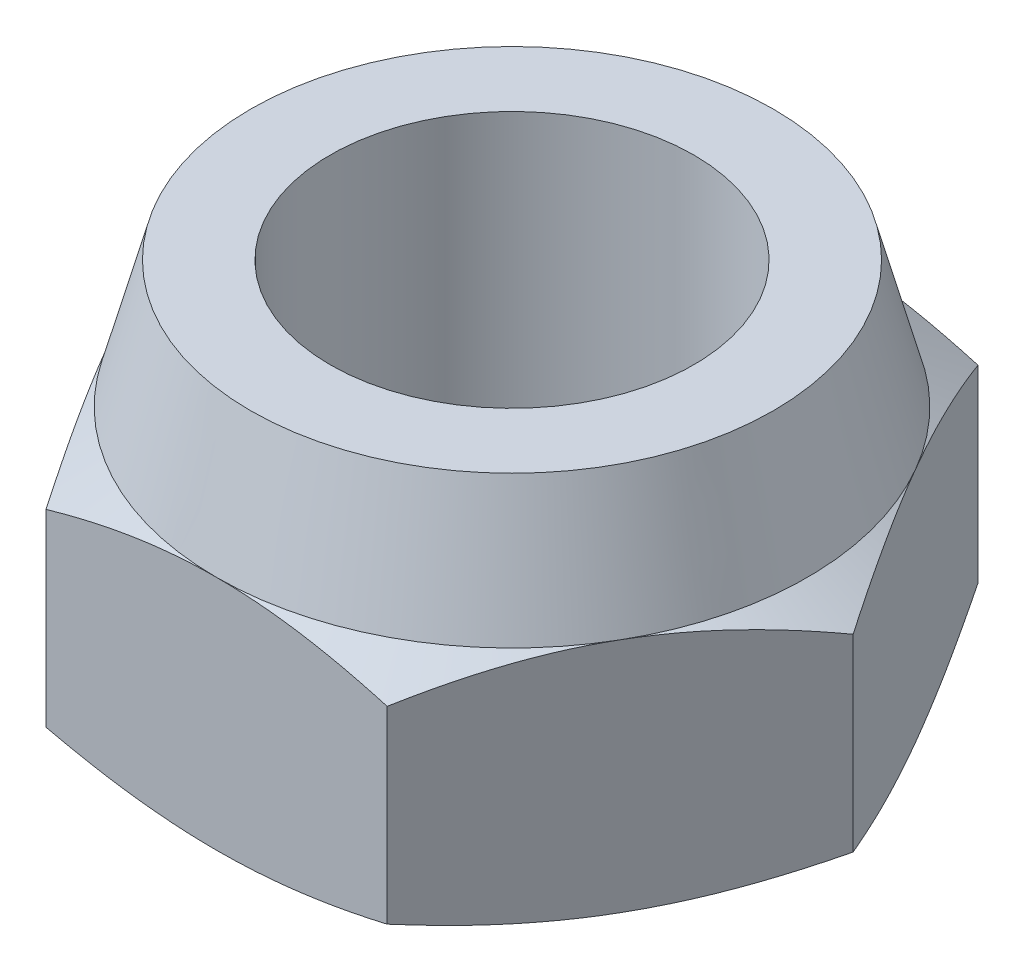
ISO-10303-21;
HEADER;
FILE_DESCRIPTION(('STEP AP214'),'2;1');
FILE_NAME('part.step','',(''),(''),'','','');
FILE_SCHEMA(('AUTOMOTIVE_DESIGN { 1 0 10303 214 1 1 1 1 }'));
ENDSEC;
DATA;
#1=APPLICATION_CONTEXT('core data for automotive mechanical design processes');
#2=APPLICATION_PROTOCOL_DEFINITION('international standard','automotive_design',2000,#1);
#3=PRODUCT_CONTEXT('',#1,'mechanical');
#4=PRODUCT('Part','Part','',(#3));
#5=PRODUCT_RELATED_PRODUCT_CATEGORY('part','',(#4));
#6=PRODUCT_DEFINITION_FORMATION('','',#4);
#7=PRODUCT_DEFINITION_CONTEXT('part definition',#1,'design');
#8=PRODUCT_DEFINITION('design','',#6,#7);
#9=PRODUCT_DEFINITION_SHAPE('','',#8);
#10=(LENGTH_UNIT() NAMED_UNIT(*) SI_UNIT(.MILLI.,.METRE.));
#11=(NAMED_UNIT(*) PLANE_ANGLE_UNIT() SI_UNIT($,.RADIAN.));
#12=(NAMED_UNIT(*) SI_UNIT($,.STERADIAN.) SOLID_ANGLE_UNIT());
#13=UNCERTAINTY_MEASURE_WITH_UNIT(LENGTH_MEASURE(1.E-05),#10,'distance_accuracy_value','');
#14=(GEOMETRIC_REPRESENTATION_CONTEXT(3) GLOBAL_UNCERTAINTY_ASSIGNED_CONTEXT((#13)) GLOBAL_UNIT_ASSIGNED_CONTEXT((#10,
#11,#12)) REPRESENTATION_CONTEXT('',''));
#15=CARTESIAN_POINT('',(0.,0.,0.));
#16=DIRECTION('',(0.,0.,1.));
#17=DIRECTION('',(1.,0.,0.));
#18=AXIS2_PLACEMENT_3D('',#15,#16,#17);
#19=CARTESIAN_POINT('',(0.,4.61944341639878,0.));
#20=DIRECTION('',(0.,-1.,0.));
#21=DIRECTION('',(0.866025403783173,0.,-0.500000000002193));
#22=AXIS2_PLACEMENT_3D('',#19,#20,#21);
#23=CONICAL_SURFACE('',#22,7.50555349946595,1.0471975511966);
#24=CARTESIAN_POINT('',(5.62916509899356,5.2,3.25000004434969));
#25=CARTESIAN_POINT('',(5.65104669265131,5.19999965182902,3.21210175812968));
#26=CARTESIAN_POINT('',(5.67293048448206,5.19974234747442,3.17420483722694));
#27=CARTESIAN_POINT('',(5.71638408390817,5.19872714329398,3.09894787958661));
#28=CARTESIAN_POINT('',(5.737953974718,5.1979763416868,3.06158779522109));
#29=CARTESIAN_POINT('',(5.78073994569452,5.19600260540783,2.98745738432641));
#30=CARTESIAN_POINT('',(5.80195627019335,5.19478725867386,2.95068699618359));
#31=CARTESIAN_POINT('',(5.84399908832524,5.19191250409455,2.87779555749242));
#32=CARTESIAN_POINT('',(5.86482591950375,5.1902612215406,2.84167438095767));
#33=CARTESIAN_POINT('',(5.90619972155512,5.18652927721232,2.76990049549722));
#34=CARTESIAN_POINT('',(5.92674691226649,5.18445428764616,2.73424761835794));
#35=CARTESIAN_POINT('',(5.96788190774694,5.17985469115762,2.66287309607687));
#36=CARTESIAN_POINT('',(5.98846968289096,5.17732895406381,2.62715150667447));
#37=CARTESIAN_POINT('',(6.02971644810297,5.17182190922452,2.55559530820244));
#38=CARTESIAN_POINT('',(6.05037539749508,5.16883883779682,2.51976081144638));
#39=CARTESIAN_POINT('',(6.09178289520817,5.16241153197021,2.4479545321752));
#40=CARTESIAN_POINT('',(6.112531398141,5.15896515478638,2.411982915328));
#41=CARTESIAN_POINT('',(6.15413513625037,5.15160579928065,2.33987690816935));
#42=CARTESIAN_POINT('',(6.17499031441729,5.14769030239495,2.30374274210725));
#43=CARTESIAN_POINT('',(6.21679618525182,5.13939257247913,2.23133293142));
#44=CARTESIAN_POINT('',(6.23774681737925,5.1350080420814,2.19505751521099));
#45=CARTESIAN_POINT('',(6.27949551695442,5.12582661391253,2.12279183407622));
#46=CARTESIAN_POINT('',(6.30029368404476,5.12103260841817,2.08680125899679));
#47=CARTESIAN_POINT('',(6.34167170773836,5.11106481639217,2.01520990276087));
#48=CARTESIAN_POINT('',(6.36225175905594,5.10589507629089,1.97960867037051));
#49=CARTESIAN_POINT('',(6.40318946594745,5.09519703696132,1.90879540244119));
#50=CARTESIAN_POINT('',(6.42354735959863,5.08967265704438,1.87358291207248));
#51=CARTESIAN_POINT('',(6.46403559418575,5.07828659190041,1.80354913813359));
#52=CARTESIAN_POINT('',(6.48416621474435,5.07242873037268,1.76872739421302));
#53=CARTESIAN_POINT('',(6.52419395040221,5.06039691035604,1.69947978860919));
#54=CARTESIAN_POINT('',(6.54409138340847,5.05422670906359,1.66505345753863));
#55=CARTESIAN_POINT('',(6.58364613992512,5.04159137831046,1.59660398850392));
#56=CARTESIAN_POINT('',(6.60330381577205,5.03512996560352,1.56258036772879));
#57=CARTESIAN_POINT('',(6.64237183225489,5.02193341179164,1.49494614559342));
#58=CARTESIAN_POINT('',(6.66178255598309,5.01520196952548,1.46133504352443));
#59=CARTESIAN_POINT('',(6.70034936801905,5.00148632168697,1.39453845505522));
#60=CARTESIAN_POINT('',(6.7195058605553,4.9945058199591,1.36135244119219));
#61=CARTESIAN_POINT('',(6.7575553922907,4.98031377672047,1.29542020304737));
#62=CARTESIAN_POINT('',(6.77644886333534,4.97310595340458,1.26267342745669));
#63=CARTESIAN_POINT('',(6.81396897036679,4.9584776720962,1.19763751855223));
#64=CARTESIAN_POINT('',(6.83259599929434,4.95106097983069,1.16534776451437));
#65=CARTESIAN_POINT('',(6.86964720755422,4.93600984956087,1.10108647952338));
#66=CARTESIAN_POINT('',(6.8880717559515,4.92837782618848,1.0691145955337));
#67=CARTESIAN_POINT('',(6.92478933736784,4.91287878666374,1.00537842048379));
#68=CARTESIAN_POINT('',(6.94308256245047,4.90501316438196,0.973613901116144));
#69=CARTESIAN_POINT('',(6.97956936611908,4.88904184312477,0.910261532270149));
#70=CARTESIAN_POINT('',(6.99776305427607,4.88093720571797,0.878673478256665));
#71=CARTESIAN_POINT('',(7.03407866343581,4.86448392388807,0.815640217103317));
#72=CARTESIAN_POINT('',(7.05220064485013,4.8561360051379,0.784194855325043));
#73=CARTESIAN_POINT('',(7.08839905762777,4.83919192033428,0.721411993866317));
#74=CARTESIAN_POINT('',(7.10647551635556,4.83059615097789,0.690074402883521));
#75=CARTESIAN_POINT('',(7.14260685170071,4.8131521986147,0.627470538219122));
#76=CARTESIAN_POINT('',(7.16066173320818,4.80430409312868,0.596204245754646));
#77=CARTESIAN_POINT('',(7.19677181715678,4.78635126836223,0.533705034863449));
#78=CARTESIAN_POINT('',(7.21482700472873,4.77724632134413,0.502472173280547));
#79=CARTESIAN_POINT('',(7.25095750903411,4.75877560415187,0.440000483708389));
#80=CARTESIAN_POINT('',(7.26903278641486,4.74940931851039,0.408761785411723));
#81=CARTESIAN_POINT('',(7.30522121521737,4.7304116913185,0.346237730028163));
#82=CARTESIAN_POINT('',(7.32333429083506,4.72077956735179,0.314952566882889));
#83=CARTESIAN_POINT('',(7.35961396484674,4.7012460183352,0.252293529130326));
#84=CARTESIAN_POINT('',(7.37778043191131,4.69134356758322,0.22091989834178));
#85=CARTESIAN_POINT('',(7.41418056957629,4.67126505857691,0.158040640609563));
#86=CARTESIAN_POINT('',(7.43241402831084,4.66108775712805,0.12653528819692));
#87=CARTESIAN_POINT('',(7.46895936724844,4.64045534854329,0.0633476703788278));
#88=CARTESIAN_POINT('',(7.48727092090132,4.62999880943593,0.0316656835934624));
#89=CARTESIAN_POINT('',(7.50555349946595,4.61944341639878,2.85399712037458E-13));
#90=B_SPLINE_CURVE_WITH_KNOTS('',3,(#24,#25,#26,#27,#28,#29,#30,#31,#32,#33,#34,#35,#36,#37,#38,
#39,#40,#41,#42,#43,#44,#45,#46,#47,#48,#49,#50,#51,#52,#53,#54,#55,#56,#57,#58,#59,#60,#61,#62,
#63,#64,#65,#66,#67,#68,#69,#70,#71,#72,#73,#74,#75,#76,#77,#78,#79,#80,#81,#82,#83,#84,#85,#86,
#87,#88,#89),.UNSPECIFIED.,.F.,.F.,(4,2,2,2,2,2,2,2,2,2,2,2,2,2,2,2,2,2,2,2,2,2,2,2,2,2,2,2,2,2,
2,2,4),(0.,0.131284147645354,0.260720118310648,0.388126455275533,0.513307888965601,
0.636912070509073,0.760830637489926,0.885239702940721,1.01024533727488,1.13595499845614,
1.26231133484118,1.38783918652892,1.51217296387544,1.63531294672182,1.75724960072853,
1.87796395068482,1.99742797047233,2.11560498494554,2.23245007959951,2.34791051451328,
2.46193311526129,2.57497727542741,2.68744603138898,2.79947405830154,2.91119658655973,
3.02274926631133,3.13426803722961,3.24588900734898,3.35774834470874,3.46998218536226,
3.58272656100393,3.6961173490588,3.81029024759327),.UNSPECIFIED.);
#91=CARTESIAN_POINT('',(5.62916509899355,5.2,3.25000004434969));
#92=VERTEX_POINT('',#91);
#93=CARTESIAN_POINT('',(7.5055534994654,4.6194434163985,5.11590769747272E-13));
#94=VERTEX_POINT('',#93);
#95=EDGE_CURVE('E110',#92,#94,#90,.T.);
#96=ORIENTED_EDGE('',*,*,#95,.T.);
#97=CARTESIAN_POINT('',(7.50555349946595,4.61944341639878,2.85399712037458E-13));
#98=CARTESIAN_POINT('',(7.48964967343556,4.62862547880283,-0.0275461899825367));
#99=CARTESIAN_POINT('',(7.47373036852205,4.63772895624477,-0.055109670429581));
#100=CARTESIAN_POINT('',(7.44204568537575,4.6556699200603,-0.109955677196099));
#101=CARTESIAN_POINT('',(7.42628064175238,4.66450926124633,-0.13723779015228));
#102=CARTESIAN_POINT('',(7.3949016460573,4.68192564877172,-0.191530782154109));
#103=CARTESIAN_POINT('',(7.37928799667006,4.69050452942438,-0.218541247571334));
#104=CARTESIAN_POINT('',(7.34820880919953,4.70740362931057,-0.272300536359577));
#105=CARTESIAN_POINT('',(7.33274354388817,4.71572566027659,-0.299048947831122));
#106=CARTESIAN_POINT('',(7.30195761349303,4.73211489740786,-0.352293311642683));
#107=CARTESIAN_POINT('',(7.28663719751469,4.74018388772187,-0.378788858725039));
#108=CARTESIAN_POINT('',(7.2561384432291,4.75607015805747,-0.431537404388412));
#109=CARTESIAN_POINT('',(7.24096032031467,4.76388919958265,-0.457789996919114));
#110=CARTESIAN_POINT('',(7.21071770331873,4.77929221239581,-0.510095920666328));
#111=CARTESIAN_POINT('',(7.19565340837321,4.78687766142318,-0.536148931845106));
#112=CARTESIAN_POINT('',(7.16559566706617,4.80183619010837,-0.588124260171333));
#113=CARTESIAN_POINT('',(7.15060237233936,4.80921030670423,-0.614046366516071));
#114=CARTESIAN_POINT('',(7.12067974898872,4.82374862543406,-0.665785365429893));
#115=CARTESIAN_POINT('',(7.10575052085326,4.83091375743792,-0.691602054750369));
#116=CARTESIAN_POINT('',(7.07594628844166,4.84503776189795,-0.743152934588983));
#117=CARTESIAN_POINT('',(7.06107135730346,4.85199744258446,-0.768886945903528));
#118=CARTESIAN_POINT('',(7.03136564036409,4.86571385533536,-0.820294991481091));
#119=CARTESIAN_POINT('',(7.01653490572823,4.87247126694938,-0.845968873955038));
#120=CARTESIAN_POINT('',(6.98690643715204,4.88578655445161,-0.897278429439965));
#121=CARTESIAN_POINT('',(6.97210873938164,4.89234497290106,-0.922913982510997));
#122=CARTESIAN_POINT('',(6.94253433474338,4.90526567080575,-0.974168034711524));
#123=CARTESIAN_POINT('',(6.92775765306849,4.91162834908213,-0.999786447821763));
#124=CARTESIAN_POINT('',(6.89821236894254,4.92416097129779,-1.05102672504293));
#125=CARTESIAN_POINT('',(6.88344378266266,4.93033116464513,-1.07664853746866));
#126=CARTESIAN_POINT('',(6.85390085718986,4.94248224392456,-1.12791544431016));
#127=CARTESIAN_POINT('',(6.83912652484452,4.94846322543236,-1.15356052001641));
#128=CARTESIAN_POINT('',(6.80955749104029,4.96023924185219,-1.20489319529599));
#129=CARTESIAN_POINT('',(6.79476278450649,4.96603421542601,-1.23058080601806));
#130=CARTESIAN_POINT('',(6.76513709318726,4.97744184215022,-1.28201682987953));
#131=CARTESIAN_POINT('',(6.75030608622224,4.98305427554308,-1.30776527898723));
#132=CARTESIAN_POINT('',(6.72059245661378,4.99409948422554,-1.35934172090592));
#133=CARTESIAN_POINT('',(6.70570979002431,4.99953187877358,-1.38516976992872));
#134=CARTESIAN_POINT('',(6.67584257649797,5.01023353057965,-1.43696859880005));
#135=CARTESIAN_POINT('',(6.66085788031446,5.0155018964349,-1.46293947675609));
#136=CARTESIAN_POINT('',(6.63075655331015,5.02587957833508,-1.51507843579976));
#137=CARTESIAN_POINT('',(6.61563971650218,5.03098757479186,-1.54124666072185));
#138=CARTESIAN_POINT('',(6.58527397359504,5.04103564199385,-1.59379207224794));
#139=CARTESIAN_POINT('',(6.57002488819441,5.04597427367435,-1.62016943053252));
#140=CARTESIAN_POINT('',(6.53939250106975,5.05567549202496,-1.67314443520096));
#141=CARTESIAN_POINT('',(6.52400903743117,5.06043651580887,-1.69974227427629));
#142=CARTESIAN_POINT('',(6.49310514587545,5.06977420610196,-1.75317016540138));
#143=CARTESIAN_POINT('',(6.4775845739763,5.07434917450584,-1.78000043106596));
#144=CARTESIAN_POINT('',(6.44640267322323,5.08330650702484,-1.83390541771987));
#145=CARTESIAN_POINT('',(6.43074121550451,5.08768702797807,-1.86098037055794));
#146=CARTESIAN_POINT('',(6.39927276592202,5.09624721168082,-1.91538736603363));
#147=CARTESIAN_POINT('',(6.38346565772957,5.1004248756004,-1.94271965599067));
#148=CARTESIAN_POINT('',(6.35170004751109,5.10857111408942,-1.99765431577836));
#149=CARTESIAN_POINT('',(6.33574143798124,5.11253752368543,-2.02525694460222));
#150=CARTESIAN_POINT('',(6.30366589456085,5.12025299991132,-2.08074566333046));
#151=CARTESIAN_POINT('',(6.28754885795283,5.12399972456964,-2.10863201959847));
#152=CARTESIAN_POINT('',(6.25514817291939,5.13126770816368,-2.16470180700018));
#153=CARTESIAN_POINT('',(6.23886441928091,5.134786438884,-2.19288550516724));
#154=CARTESIAN_POINT('',(6.20612144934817,5.14158986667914,-2.24956435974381));
#155=CARTESIAN_POINT('',(6.18966212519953,5.14487183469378,-2.27805978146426));
#156=CARTESIAN_POINT('',(6.15655916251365,5.15119416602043,-2.33536844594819));
#157=CARTESIAN_POINT('',(6.13991538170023,5.15423167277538,-2.36418192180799));
#158=CARTESIAN_POINT('',(6.1066099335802,5.16002184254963,-2.42185234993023));
#159=CARTESIAN_POINT('',(6.08994826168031,5.16277431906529,-2.45070931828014));
#160=CARTESIAN_POINT('',(6.05669259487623,5.16797645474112,-2.50832535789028));
#161=CARTESIAN_POINT('',(6.04009861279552,5.17042734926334,-2.53708432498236));
#162=CARTESIAN_POINT('',(6.00696910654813,5.17502967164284,-2.5945173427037));
#163=CARTESIAN_POINT('',(5.9904335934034,5.17718217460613,-2.6231913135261));
#164=CARTESIAN_POINT('',(5.95741230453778,5.18119043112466,-2.68046749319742));
#165=CARTESIAN_POINT('',(5.94092653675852,5.18304710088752,-2.70906964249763));
#166=CARTESIAN_POINT('',(5.90799533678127,5.18646657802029,-2.7662147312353));
#167=CARTESIAN_POINT('',(5.89154991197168,5.18803014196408,-2.79475762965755));
#168=CARTESIAN_POINT('',(5.85868964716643,5.19086624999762,-2.85179635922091));
#169=CARTESIAN_POINT('',(5.84227481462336,5.19213939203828,-2.88029216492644));
#170=CARTESIAN_POINT('',(5.80946556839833,5.19439750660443,-2.93724837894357));
#171=CARTESIAN_POINT('',(5.79307116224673,5.19538292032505,-2.96570877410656));
#172=CARTESIAN_POINT('',(5.7602922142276,5.1970684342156,-3.02260536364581));
#173=CARTESIAN_POINT('',(5.74390767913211,5.19776882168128,-3.05104155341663));
#174=CARTESIAN_POINT('',(5.71113758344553,5.19888709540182,-3.10790046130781));
#175=CARTESIAN_POINT('',(5.69475202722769,5.19930511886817,-3.1363231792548));
#176=CARTESIAN_POINT('',(5.66196851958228,5.19986162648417,-3.19316532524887));
#177=CARTESIAN_POINT('',(5.64557056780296,5.20000010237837,-3.22158475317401));
#178=CARTESIAN_POINT('',(5.62916519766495,5.2,-3.24999987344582));
#179=B_SPLINE_CURVE_WITH_KNOTS('',3,(#97,#98,#99,#100,#101,#102,#103,#104,#105,#106,#107,#108,
#109,#110,#111,#112,#113,#114,#115,#116,#117,#118,#119,#120,#121,#122,#123,#124,#125,#126,#127,
#128,#129,#130,#131,#132,#133,#134,#135,#136,#137,#138,#139,#140,#141,#142,#143,#144,#145,#146,
#147,#148,#149,#150,#151,#152,#153,#154,#155,#156,#157,#158,#159,#160,#161,#162,#163,#164,#165,
#166,#167,#168,#169,#170,#171,#172,#173,#174,#175,#176,#177,#178),.UNSPECIFIED.,.F.,.F.,(4,2,2,
2,2,2,2,2,2,2,2,2,2,2,2,2,2,2,2,2,2,2,2,2,2,2,2,2,2,2,2,2,2,2,2,2,2,2,2,2,4),(0.,
0.0993191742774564,0.197496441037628,0.294565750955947,0.39056099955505,0.485516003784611,
0.579464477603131,0.672571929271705,0.765092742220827,0.857105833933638,0.94868839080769,
1.03991752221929,1.13087022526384,1.22162334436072,1.3122535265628,1.40283717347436,
1.49345039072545,1.58416893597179,1.67506845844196,1.7663971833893,1.85834474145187,
1.95094103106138,2.0442187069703,2.13821327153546,2.2329631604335,2.32850982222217,
2.4248977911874,2.5221747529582,2.62039160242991,2.71960249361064,2.81984161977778,
2.92014592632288,3.02002461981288,3.11953353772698,3.2187280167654,3.31766281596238,
3.41639204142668,3.51496907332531,3.61344649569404,3.71187602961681,3.81030847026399),.UNSPECIFIED.);
#180=CARTESIAN_POINT('',(5.62916519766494,5.2,-3.24999987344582));
#181=VERTEX_POINT('',#180);
#182=EDGE_CURVE('E127',#94,#181,#179,.T.);
#183=ORIENTED_EDGE('',*,*,#182,.T.);
#184=CARTESIAN_POINT('',(0.,5.2,0.));
#185=DIRECTION('',(0.,-1.,0.));
#186=DIRECTION('',(0.866025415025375,0.,-0.499999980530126));
#187=AXIS2_PLACEMENT_3D('',#184,#185,#186);
#188=CIRCLE('',#187,6.5);
#189=EDGE_CURVE('E130',#92,#181,#188,.F.);
#190=ORIENTED_EDGE('',*,*,#189,.F.);
#191=EDGE_LOOP('',(#96,#183,#190));
#192=FACE_BOUND('',#191,.T.);
#193=ADVANCED_FACE('F14',(#192),#23,.T.);
#194=CARTESIAN_POINT('',(0.,4.61944341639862,0.));
#195=DIRECTION('',(0.,-1.,0.));
#196=DIRECTION('',(-1.56941421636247E-07,0.,-0.999999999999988));
#197=AXIS2_PLACEMENT_3D('',#194,#195,#196);
#198=CONICAL_SURFACE('',#197,7.50555349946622,1.0471975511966);
#199=CARTESIAN_POINT('',(0.,5.2,0.));
#200=DIRECTION('',(0.,-1.,0.));
#201=DIRECTION('',(-1.20855324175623E-07,0.,-1.));
#202=AXIS2_PLACEMENT_3D('',#199,#200,#201);
#203=CIRCLE('',#202,6.5);
#204=CARTESIAN_POINT('',(-7.85559607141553E-07,5.2,-6.5));
#205=VERTEX_POINT('',#204);
#206=EDGE_CURVE('E295',#181,#205,#203,.F.);
#207=ORIENTED_EDGE('',*,*,#206,.F.);
#208=CARTESIAN_POINT('',(5.62916519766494,5.2,-3.24999987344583));
#209=CARTESIAN_POINT('',(5.60728511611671,5.19999965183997,-3.28789903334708));
#210=CARTESIAN_POINT('',(5.58540731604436,5.19974234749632,-3.32579941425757));
#211=CARTESIAN_POINT('',(5.54195967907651,5.1987271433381,-3.40105981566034));
#212=CARTESIAN_POINT('',(5.52038984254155,5.19797634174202,-3.43841993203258));
#213=CARTESIAN_POINT('',(5.47758400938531,5.1960026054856,-3.51253887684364));
#214=CARTESIAN_POINT('',(5.45634808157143,5.19478725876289,-3.54929794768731));
#215=CARTESIAN_POINT('',(5.41424365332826,5.19191250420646,-3.62215381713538));
#216=CARTESIAN_POINT('',(5.39337521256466,5.19026122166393,-3.65825097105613));
#217=CARTESIAN_POINT('',(5.35190410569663,5.18652927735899,-3.72996867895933));
#218=CARTESIAN_POINT('',(5.33130140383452,5.18445428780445,-3.76558950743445));
#219=CARTESIAN_POINT('',(5.29005675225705,5.17985469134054,-3.83690072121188));
#220=CARTESIAN_POINT('',(5.26941483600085,5.17732895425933,-3.87259105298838));
#221=CARTESIAN_POINT('',(5.22806873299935,5.17182190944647,-3.94408990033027));
#222=CARTESIAN_POINT('',(5.20736462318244,5.1688388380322,-3.97989832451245));
#223=CARTESIAN_POINT('',(5.16588231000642,5.16241153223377,-4.05166141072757));
#224=CARTESIAN_POINT('',(5.14510422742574,5.15896515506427,-4.08761595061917));
#225=CARTESIAN_POINT('',(5.1034604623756,5.15160579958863,-4.15969884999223));
#226=CARTESIAN_POINT('',(5.0825949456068,5.14769030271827,-4.19582704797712));
#227=CARTESIAN_POINT('',(5.04078914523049,5.13939257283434,-4.26823690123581));
#228=CARTESIAN_POINT('',(5.01984902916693,5.1350080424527,-4.30451838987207));
#229=CARTESIAN_POINT('',(4.97813946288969,5.12582661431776,-4.3768066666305));
#230=CARTESIAN_POINT('',(4.95736979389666,5.12103260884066,-4.41281369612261));
#231=CARTESIAN_POINT('',(4.91605887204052,5.11106481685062,-4.48444379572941));
#232=CARTESIAN_POINT('',(4.89551732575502,5.10589507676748,-4.52006726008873));
#233=CARTESIAN_POINT('',(4.8546600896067,5.09519703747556,-4.59092699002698));
#234=CARTESIAN_POINT('',(4.83434412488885,5.08967265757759,-4.6261636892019));
#235=CARTESIAN_POINT('',(4.79393721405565,5.07828659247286,-4.69624441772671));
#236=CARTESIAN_POINT('',(4.77384600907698,5.07242873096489,-4.7310889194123));
#237=CARTESIAN_POINT('',(4.73388969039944,5.06039691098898,-4.80037776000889));
#238=CARTESIAN_POINT('',(4.71402432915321,5.05422670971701,-4.83482260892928));
#239=CARTESIAN_POINT('',(4.67452272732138,5.041591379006,-4.90330276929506));
#240=CARTESIAN_POINT('',(4.65488624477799,5.03512996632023,-4.93733862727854));
#241=CARTESIAN_POINT('',(4.61584729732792,5.02193341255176,-5.00498963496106));
#242=CARTESIAN_POINT('',(4.59644459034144,5.01520197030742,-5.03860536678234));
#243=CARTESIAN_POINT('',(4.55788045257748,5.00148632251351,-5.10540350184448));
#244=CARTESIAN_POINT('',(4.53871876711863,4.99450582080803,-5.13858651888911));
#245=CARTESIAN_POINT('',(4.50064453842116,4.9803137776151,-5.20450450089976));
#246=CARTESIAN_POINT('',(4.48173173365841,4.97310595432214,-5.23724011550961));
#247=CARTESIAN_POINT('',(4.4441690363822,4.95847767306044,-5.30225143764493));
#248=CARTESIAN_POINT('',(4.42551880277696,4.95106098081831,-5.33452779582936));
#249=CARTESIAN_POINT('',(4.38839249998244,4.93600985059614,-5.39874572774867));
#250=CARTESIAN_POINT('',(4.36991630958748,4.92837782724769,-5.43068779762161));
#251=CARTESIAN_POINT('',(4.333077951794,4.91287878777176,-5.49435424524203));
#252=CARTESIAN_POINT('',(4.31471568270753,4.90501316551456,-5.52607890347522));
#253=CARTESIAN_POINT('',(4.27809432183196,4.88904184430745,-5.58935358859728));
#254=CARTESIAN_POINT('',(4.25983510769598,4.88093720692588,-5.62090381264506));
#255=CARTESIAN_POINT('',(4.22340450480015,4.86448392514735,-5.68387068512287));
#256=CARTESIAN_POINT('',(4.20523301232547,4.85613600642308,-5.7152874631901));
#257=CARTESIAN_POINT('',(4.16896066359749,4.83919192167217,-5.77802764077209));
#258=CARTESIAN_POINT('',(4.1508597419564,4.83059615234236,-5.80935110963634));
#259=CARTESIAN_POINT('',(4.1147088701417,4.81315220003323,-5.87194369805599));
#260=CARTESIAN_POINT('',(4.09665890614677,4.8043040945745,-5.90321283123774));
#261=CARTESIAN_POINT('',(4.06058804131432,4.78635126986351,-5.9657346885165));
#262=CARTESIAN_POINT('',(4.0425671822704,4.7772463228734,-5.99698737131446));
#263=CARTESIAN_POINT('',(4.00653036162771,4.75877560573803,-6.0595131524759));
#264=CARTESIAN_POINT('',(3.98851449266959,4.74940932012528,-6.09078615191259));
#265=CARTESIAN_POINT('',(3.95246128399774,4.73041169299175,-6.15338828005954));
#266=CARTESIAN_POINT('',(3.93442407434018,4.72077956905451,-6.18471724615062));
#267=CARTESIAN_POINT('',(3.89829958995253,4.70124602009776,-6.24746588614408));
#268=CARTESIAN_POINT('',(3.88021246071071,4.69134356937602,-6.27888532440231));
#269=CARTESIAN_POINT('',(3.84395749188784,4.67126506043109,-6.34184839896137));
#270=CARTESIAN_POINT('',(3.82578978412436,4.66108775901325,-6.37339171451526));
#271=CARTESIAN_POINT('',(3.78934036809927,4.64045535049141,-6.43663471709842));
#272=CARTESIAN_POINT('',(3.77105873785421,4.62999881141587,-6.46833398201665));
#273=CARTESIAN_POINT('',(3.75277673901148,4.61944341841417,-6.50000000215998));
#274=B_SPLINE_CURVE_WITH_KNOTS('',3,(#208,#209,#210,#211,#212,#213,#214,#215,#216,#217,#218,
#219,#220,#221,#222,#223,#224,#225,#226,#227,#228,#229,#230,#231,#232,#233,#234,#235,#236,#237,
#238,#239,#240,#241,#242,#243,#244,#245,#246,#247,#248,#249,#250,#251,#252,#253,#254,#255,#256,
#257,#258,#259,#260,#261,#262,#263,#264,#265,#266,#267,#268,#269,#270,#271,#272,#273),
.UNSPECIFIED.,.F.,.F.,(4,2,2,2,2,2,2,2,2,2,2,2,2,2,2,2,2,2,2,2,2,2,2,2,2,2,2,2,2,2,2,2,4),(0.,
0.131284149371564,0.26072012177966,0.388126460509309,0.513307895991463,0.636912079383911,
0.760830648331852,0.885239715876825,1.01024535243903,1.13595501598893,1.26231135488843,
1.38783920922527,1.51217298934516,1.63531297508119,1.75724963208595,1.87796398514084,
1.99742800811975,2.11560502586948,2.23245012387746,2.34791056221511,2.46193316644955,
2.57497733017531,2.6874460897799,2.79947412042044,2.9111966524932,3.02274933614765,
3.13426811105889,3.24588908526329,3.35774842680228,3.4699822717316,3.58272665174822,
3.69611744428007,3.81029034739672),.UNSPECIFIED.);
#275=CARTESIAN_POINT('',(3.75277673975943,4.61944342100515,-6.5));
#276=VERTEX_POINT('',#275);
#277=EDGE_CURVE('E137',#181,#276,#274,.T.);
#278=ORIENTED_EDGE('',*,*,#277,.T.);
#279=CARTESIAN_POINT('',(3.75277673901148,4.61944341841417,-6.50000000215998));
#280=CARTESIAN_POINT('',(3.72096451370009,4.62862681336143,-6.49999997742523));
#281=CARTESIAN_POINT('',(3.68912956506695,4.63773158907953,-6.49999521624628));
#282=CARTESIAN_POINT('',(3.62577999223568,4.65567506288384,-6.49997856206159));
#283=CARTESIAN_POINT('',(3.59426589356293,4.66451561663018,-6.49996675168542));
#284=CARTESIAN_POINT('',(3.53154817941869,4.68193434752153,-6.49993839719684));
#285=CARTESIAN_POINT('',(3.50034507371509,4.69051435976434,-6.49992190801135));
#286=CARTESIAN_POINT('',(3.43823954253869,4.70741564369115,-6.4998864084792));
#287=CARTESIAN_POINT('',(3.40733761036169,4.71573872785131,-6.49986742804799));
#288=CARTESIAN_POINT('',(3.34582471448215,4.73213000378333,-6.49982847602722));
#289=CARTESIAN_POINT('',(3.31521422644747,4.74019998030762,-6.49980851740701));
#290=CARTESIAN_POINT('',(3.25427436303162,4.75608813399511,-6.4997704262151));
#291=CARTESIAN_POINT('',(3.22394544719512,4.76390807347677,-6.49975227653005));
#292=CARTESIAN_POINT('',(3.1635157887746,4.77931321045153,-6.49971460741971));
#293=CARTESIAN_POINT('',(3.13341542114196,4.78689987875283,-6.49969510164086));
#294=CARTESIAN_POINT('',(3.07336386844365,4.80186049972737,-6.49965235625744));
#295=CARTESIAN_POINT('',(3.04341294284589,4.80923549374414,-6.49962914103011));
#296=CARTESIAN_POINT('',(2.98363512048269,4.8237752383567,-6.4995855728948));
#297=CARTESIAN_POINT('',(2.9538084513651,4.83094092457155,-6.49956520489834));
#298=CARTESIAN_POINT('',(2.89425477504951,4.84506570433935,-6.4995302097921));
#299=CARTESIAN_POINT('',(2.86452796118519,4.85202561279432,-6.49951555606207));
#300=CARTESIAN_POINT('',(2.80514963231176,4.86574216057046,-6.49949445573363));
#301=CARTESIAN_POINT('',(2.77549827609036,4.87249948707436,-6.49948797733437));
#302=CARTESIAN_POINT('',(2.71624661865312,4.88581429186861,-6.49948441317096));
#303=CARTESIAN_POINT('',(2.6866464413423,4.89237232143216,-6.49948729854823));
#304=CARTESIAN_POINT('',(2.62747299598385,4.90529193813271,-6.49950260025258));
#305=CARTESIAN_POINT('',(2.59789981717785,4.91165393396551,-6.49951499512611));
#306=CARTESIAN_POINT('',(2.53875633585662,4.92418489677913,-6.49954835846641));
#307=CARTESIAN_POINT('',(2.50918608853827,4.93035412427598,-6.4995693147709));
#308=CARTESIAN_POINT('',(2.45002456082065,4.94250298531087,-6.49961772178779));
#309=CARTESIAN_POINT('',(2.42043330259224,4.94848272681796,-6.49964516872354));
#310=CARTESIAN_POINT('',(2.36120596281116,4.96025598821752,-6.49970350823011));
#311=CARTESIAN_POINT('',(2.33156987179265,4.96604946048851,-6.49973440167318));
#312=CARTESIAN_POINT('',(2.27222926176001,4.97745380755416,-6.49979502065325));
#313=CARTESIAN_POINT('',(2.24252470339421,4.98306447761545,-6.49982474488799));
#314=CARTESIAN_POINT('',(2.18302310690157,4.99410599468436,-6.49987905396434));
#315=CARTESIAN_POINT('',(2.1532260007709,4.99953647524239,-6.49990362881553));
#316=CARTESIAN_POINT('',(2.09344968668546,5.01023582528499,-6.49993590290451));
#317=CARTESIAN_POINT('',(2.06347031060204,5.01550375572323,-6.49994351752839));
#318=CARTESIAN_POINT('',(2.00326841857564,5.02588126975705,-6.49994392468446));
#319=CARTESIAN_POINT('',(1.97304566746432,5.03098948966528,-6.49993661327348));
#320=CARTESIAN_POINT('',(1.91234798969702,5.04103871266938,-6.49991230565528));
#321=CARTESIAN_POINT('',(1.88187281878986,5.04597824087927,-6.4998952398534));
#322=CARTESIAN_POINT('',(1.82066058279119,5.05568174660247,-6.4998550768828));
#323=CARTESIAN_POINT('',(1.78992326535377,5.06044413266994,-6.49983193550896));
#324=CARTESIAN_POINT('',(1.7281761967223,5.0697848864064,-6.49978300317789));
#325=CARTESIAN_POINT('',(1.69716618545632,5.07436153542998,-6.49975719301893));
#326=CARTESIAN_POINT('',(1.63486237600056,5.08332239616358,-6.49970565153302));
#327=CARTESIAN_POINT('',(1.6035683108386,5.08770475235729,-6.49967992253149));
#328=CARTESIAN_POINT('',(1.54068419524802,5.09626860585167,-6.49963066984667));
#329=CARTESIAN_POINT('',(1.50909387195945,5.1004481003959,-6.49960716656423));
#330=CARTESIAN_POINT('',(1.44560417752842,5.10859782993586,-6.49956379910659));
#331=CARTESIAN_POINT('',(1.4137045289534,5.11256590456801,-6.49954396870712));
#332=CARTESIAN_POINT('',(1.3495822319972,5.12028437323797,-6.49950870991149));
#333=CARTESIAN_POINT('',(1.31735930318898,5.12403243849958,-6.49949332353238));
#334=CARTESIAN_POINT('',(1.25257559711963,5.13130259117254,-6.49946673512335));
#335=CARTESIAN_POINT('',(1.22001453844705,5.13482217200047,-6.49945557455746));
#336=CARTESIAN_POINT('',(1.15453876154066,5.14162664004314,-6.49943713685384));
#337=CARTESIAN_POINT('',(1.12162376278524,5.14490882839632,-6.49942989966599));
#338=CARTESIAN_POINT('',(1.05543362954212,5.15123046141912,-6.49941524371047));
#339=CARTESIAN_POINT('',(1.02215822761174,5.15426710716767,-6.49940782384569));
#340=CARTESIAN_POINT('',(0.95557366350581,5.1600541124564,-6.49939978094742));
#341=CARTESIAN_POINT('',(0.922264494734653,5.16280439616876,-6.49939915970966));
#342=CARTESIAN_POINT('',(0.85576459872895,5.16800243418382,-6.49940747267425));
#343=CARTESIAN_POINT('',(0.822573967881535,5.17045142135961,-6.49941636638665));
#344=CARTESIAN_POINT('',(0.756295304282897,5.17505012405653,-6.49944237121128));
#345=CARTESIAN_POINT('',(0.723207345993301,5.17720091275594,-6.49945945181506));
#346=CARTESIAN_POINT('',(0.657118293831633,5.18120596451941,-6.4995007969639));
#347=CARTESIAN_POINT('',(0.624117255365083,5.18306114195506,-6.49952503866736));
#348=CARTESIAN_POINT('',(0.558186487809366,5.18647785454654,-6.49957883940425));
#349=CARTESIAN_POINT('',(0.525256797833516,5.18804014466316,-6.49960838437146));
#350=CARTESIAN_POINT('',(0.459453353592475,5.19087393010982,-6.49967040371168));
#351=CARTESIAN_POINT('',(0.426579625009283,5.19214602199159,-6.49970287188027));
#352=CARTESIAN_POINT('',(0.360872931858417,5.19440226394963,-6.49976775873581));
#353=CARTESIAN_POINT('',(0.328039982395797,5.19538685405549,-6.49980017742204));
#354=CARTESIAN_POINT('',(0.262399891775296,5.19707095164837,-6.49986141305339));
#355=CARTESIAN_POINT('',(0.229592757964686,5.19777074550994,-6.49989023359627));
#356=CARTESIAN_POINT('',(0.163989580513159,5.19888806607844,-6.49994019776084));
#357=CARTESIAN_POINT('',(0.131193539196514,5.19930572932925,-6.49996134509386));
#358=CARTESIAN_POINT('',(0.0655980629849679,5.19986175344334,-6.49999119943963));
#359=CARTESIAN_POINT('',(0.0327986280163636,5.20000010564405,-6.49999990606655));
#360=CARTESIAN_POINT('',(-7.85559607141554E-07,5.19999999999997,-6.50000000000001));
#361=B_SPLINE_CURVE_WITH_KNOTS('',3,(#279,#280,#281,#282,#283,#284,#285,#286,#287,#288,#289,
#290,#291,#292,#293,#294,#295,#296,#297,#298,#299,#300,#301,#302,#303,#304,#305,#306,#307,#308,
#309,#310,#311,#312,#313,#314,#315,#316,#317,#318,#319,#320,#321,#322,#323,#324,#325,#326,#327,
#328,#329,#330,#331,#332,#333,#334,#335,#336,#337,#338,#339,#340,#341,#342,#343,#344,#345,#346,
#347,#348,#349,#350,#351,#352,#353,#354,#355,#356,#357,#358,#359,#360),.UNSPECIFIED.,.F.,.F.,(4,
2,2,2,2,2,2,2,2,2,2,2,2,2,2,2,2,2,2,2,2,2,2,2,2,2,2,2,2,2,2,2,2,2,2,2,2,2,2,2,4),(0.,
0.0993335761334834,0.197525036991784,0.294608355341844,0.390617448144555,0.485586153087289,
0.579548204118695,0.672672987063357,0.765209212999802,0.857234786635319,0.948826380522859,
1.04006058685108,1.13101388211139,1.22176258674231,1.31238282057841,1.40295045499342,
1.49354106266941,1.58422986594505,1.6750930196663,1.76640848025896,1.85836201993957,
1.95097995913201,2.04429140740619,2.138328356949,2.23312577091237,2.32872166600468,
2.42515718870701,2.52247668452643,2.6207277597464,2.71996133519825,2.82020114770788,
2.92046743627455,3.02030874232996,3.11978084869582,3.21893903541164,3.31783800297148,
3.41653179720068,3.51507373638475,3.61351634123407,3.7119112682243,3.81030924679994),.UNSPECIFIED.);
#362=EDGE_CURVE('E194',#276,#205,#361,.T.);
#363=ORIENTED_EDGE('',*,*,#362,.T.);
#364=EDGE_LOOP('',(#207,#278,#363));
#365=FACE_BOUND('',#364,.T.);
#366=ADVANCED_FACE('F294',(#365),#198,.T.);
#367=CARTESIAN_POINT('',(0.,4.61944341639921,0.));
#368=DIRECTION('',(0.,-1.,0.));
#369=DIRECTION('',(-0.866025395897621,0.,-0.500000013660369));
#370=AXIS2_PLACEMENT_3D('',#367,#368,#369);
#371=CONICAL_SURFACE('',#370,7.5055534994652,1.0471975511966);
#372=CARTESIAN_POINT('',(0.,5.2,0.));
#373=DIRECTION('',(0.,-1.,0.));
#374=DIRECTION('',(-0.86602539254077,0.,-0.500000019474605));
#375=AXIS2_PLACEMENT_3D('',#372,#373,#374);
#376=CIRCLE('',#375,6.5);
#377=CARTESIAN_POINT('',(-5.62916505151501,5.2,-3.25000012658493));
#378=VERTEX_POINT('',#377);
#379=EDGE_CURVE('E289',#205,#378,#376,.F.);
#380=ORIENTED_EDGE('',*,*,#379,.F.);
#381=CARTESIAN_POINT('',(-7.85559609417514E-07,5.19999999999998,-6.50000000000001));
#382=CARTESIAN_POINT('',(-0.0415955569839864,5.19999959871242,-6.50000090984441));
#383=CARTESIAN_POINT('',(-0.0831903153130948,5.19977243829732,-6.4999948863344));
#384=CARTESIAN_POINT('',(-0.166319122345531,5.19886608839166,-6.49996904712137));
#385=CARTESIAN_POINT('',(-0.20785317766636,5.19818750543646,-6.49994924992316));
#386=CARTESIAN_POINT('',(-0.290805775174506,5.19638209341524,-6.49989600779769));
#387=CARTESIAN_POINT('',(-0.332224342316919,5.19525640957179,-6.49986259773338));
#388=CARTESIAN_POINT('',(-0.414890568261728,5.19256017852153,-6.4997883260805));
#389=CARTESIAN_POINT('',(-0.456138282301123,5.19099132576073,-6.49974749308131));
#390=CARTESIAN_POINT('',(-0.538486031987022,5.18740809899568,-6.49967048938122));
#391=CARTESIAN_POINT('',(-0.579586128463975,5.18539512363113,-6.49963430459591));
#392=CARTESIAN_POINT('',(-0.66187549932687,5.18091628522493,-6.49956901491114));
#393=CARTESIAN_POINT('',(-0.703064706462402,5.17844918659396,-6.49953992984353));
#394=CARTESIAN_POINT('',(-0.785579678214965,5.1730566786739,-6.49949253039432));
#395=CARTESIAN_POINT('',(-0.826905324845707,5.1701294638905,-6.49947425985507));
#396=CARTESIAN_POINT('',(-0.90972360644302,5.16381203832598,-6.49945049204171));
#397=CARTESIAN_POINT('',(-0.951216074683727,5.1604196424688,-6.49944505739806));
#398=CARTESIAN_POINT('',(-1.03439877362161,5.15316721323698,-6.49944744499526));
#399=CARTESIAN_POINT('',(-1.07608878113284,5.14930462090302,-6.49945534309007));
#400=CARTESIAN_POINT('',(-1.15960077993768,5.14111627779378,-6.49948406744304));
#401=CARTESIAN_POINT('',(-1.20142258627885,5.13678864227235,-6.49950494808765));
#402=CARTESIAN_POINT('',(-1.28469742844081,5.12773088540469,-6.49954916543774));
#403=CARTESIAN_POINT('',(-1.32615082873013,5.12300411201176,-6.49957248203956));
#404=CARTESIAN_POINT('',(-1.40861782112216,5.1131732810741,-6.49962096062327));
#405=CARTESIAN_POINT('',(-1.44963188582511,5.10807318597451,-6.49964610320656));
#406=CARTESIAN_POINT('',(-1.53122416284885,5.09751487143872,-6.49969621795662));
#407=CARTESIAN_POINT('',(-1.57180286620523,5.09206044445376,-6.49972118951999));
#408=CARTESIAN_POINT('',(-1.65252584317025,5.08081238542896,-6.49976939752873));
#409=CARTESIAN_POINT('',(-1.6926706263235,5.07502240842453,-6.49979264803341));
#410=CARTESIAN_POINT('',(-1.77252475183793,5.06312219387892,-6.49983596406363));
#411=CARTESIAN_POINT('',(-1.81223462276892,5.05701550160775,-6.49985605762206));
#412=CARTESIAN_POINT('',(-1.89121555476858,5.04450075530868,-6.49989196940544));
#413=CARTESIAN_POINT('',(-1.93048716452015,5.0380961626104,-6.49990782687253));
#414=CARTESIAN_POINT('',(-2.00858593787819,5.02500450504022,-6.49993457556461));
#415=CARTESIAN_POINT('',(-2.04741367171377,5.0183208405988,-6.49994551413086));
#416=CARTESIAN_POINT('',(-2.12461686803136,5.00468985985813,-6.49996234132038));
#417=CARTESIAN_POINT('',(-2.16299292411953,4.99774590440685,-6.49996828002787));
#418=CARTESIAN_POINT('',(-2.23928288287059,4.9836133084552,-6.49997530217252));
#419=CARTESIAN_POINT('',(-2.27719740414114,4.9764280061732,-6.49997643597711));
#420=CARTESIAN_POINT('',(-2.3526794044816,4.96180643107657,-6.49997586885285));
#421=CARTESIAN_POINT('',(-2.39024733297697,4.95437247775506,-6.49997418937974));
#422=CARTESIAN_POINT('',(-2.46523860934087,4.93922502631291,-6.4999709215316));
#423=CARTESIAN_POINT('',(-2.50266209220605,4.93151219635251,-6.49996933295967));
#424=CARTESIAN_POINT('',(-2.57737590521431,4.91581334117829,-6.49996634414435));
#425=CARTESIAN_POINT('',(-2.61466635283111,4.90782787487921,-6.49996494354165));
#426=CARTESIAN_POINT('',(-2.68912206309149,4.8915902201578,-6.49996282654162));
#427=CARTESIAN_POINT('',(-2.72628743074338,4.88333851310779,-6.49996210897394));
#428=CARTESIAN_POINT('',(-2.80050013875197,4.86657492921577,-6.49996148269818));
#429=CARTESIAN_POINT('',(-2.83754757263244,4.8580634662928,-6.49996157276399));
#430=CARTESIAN_POINT('',(-2.91153076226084,4.84078688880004,-6.49996257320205));
#431=CARTESIAN_POINT('',(-2.9484666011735,4.8320221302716,-6.49996348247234));
#432=CARTESIAN_POINT('',(-3.02223217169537,4.8142454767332,-6.499965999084));
#433=CARTESIAN_POINT('',(-3.05906197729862,4.80523388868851,-6.49996760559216));
#434=CARTESIAN_POINT('',(-3.13262029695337,4.7869700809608,-6.49997131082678));
#435=CARTESIAN_POINT('',(-3.16934887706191,4.77771812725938,-6.49997340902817));
#436=CARTESIAN_POINT('',(-3.24270883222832,4.75898008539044,-6.49997783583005));
#437=CARTESIAN_POINT('',(-3.27934026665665,4.74949422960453,-6.49998016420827));
#438=CARTESIAN_POINT('',(-3.3525093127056,4.73029487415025,-6.4999847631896));
#439=CARTESIAN_POINT('',(-3.3890469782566,4.72058157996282,-6.49998703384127));
#440=CARTESIAN_POINT('',(-3.46203119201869,4.7009338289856,-6.49999123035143));
#441=CARTESIAN_POINT('',(-3.49847778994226,4.69099955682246,-6.49999315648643));
#442=CARTESIAN_POINT('',(-3.57128191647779,4.67091633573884,-6.49999639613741));
#443=CARTESIAN_POINT('',(-3.60763949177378,4.66076755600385,-6.49999771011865));
#444=CARTESIAN_POINT('',(-3.68026701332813,4.64026176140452,-6.49999951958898));
#445=CARTESIAN_POINT('',(-3.71653700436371,4.62990490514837,-6.50000001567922));
#446=CARTESIAN_POINT('',(-3.75277674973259,4.61944341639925,-6.5));
#447=B_SPLINE_CURVE_WITH_KNOTS('',3,(#381,#382,#383,#384,#385,#386,#387,#388,#389,#390,#391,
#392,#393,#394,#395,#396,#397,#398,#399,#400,#401,#402,#403,#404,#405,#406,#407,#408,#409,#410,
#411,#412,#413,#414,#415,#416,#417,#418,#419,#420,#421,#422,#423,#424,#425,#426,#427,#428,#429,
#430,#431,#432,#433,#434,#435,#436,#437,#438,#439,#440,#441,#442,#443,#444,#445,#446),
.UNSPECIFIED.,.F.,.F.,(4,2,2,2,2,2,2,2,2,2,2,2,2,2,2,2,2,2,2,2,2,2,2,2,2,2,2,2,2,2,2,2,4),(0.,
0.124783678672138,0.24940003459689,0.373699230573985,0.497529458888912,0.620975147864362,
0.744761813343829,0.86904693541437,0.993937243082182,1.11954048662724,1.24567348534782,
1.37083735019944,1.49482512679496,1.61765413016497,1.73933283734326,1.85986118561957,
1.97923088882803,2.09742576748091,2.21442208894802,2.33018891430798,2.44507684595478,
2.55970571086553,2.67411223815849,2.78832238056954,2.90235916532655,3.01624278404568,
3.12999068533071,3.2436176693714,3.35713598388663,3.47055542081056,3.5838834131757,
3.69712513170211,3.810283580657),.UNSPECIFIED.);
#448=CARTESIAN_POINT('',(-3.7527767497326,4.61944341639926,-6.5));
#449=VERTEX_POINT('',#448);
#450=EDGE_CURVE('E278',#205,#449,#447,.T.);
#451=ORIENTED_EDGE('',*,*,#450,.T.);
#452=CARTESIAN_POINT('',(-3.75277674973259,4.61944341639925,-6.5));
#453=CARTESIAN_POINT('',(-3.76868053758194,4.6286254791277,-6.47245378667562));
#454=CARTESIAN_POINT('',(-3.78459155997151,4.6377289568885,-6.44488552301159));
#455=CARTESIAN_POINT('',(-3.81624725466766,4.6556699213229,-6.3900227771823));
#456=CARTESIAN_POINT('',(-3.83199173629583,4.66450926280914,-6.36272879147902));
#457=CARTESIAN_POINT('',(-3.86332134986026,4.68192565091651,-6.30840728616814));
#458=CARTESIAN_POINT('',(-3.87890627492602,4.69050453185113,-6.28138023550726));
#459=CARTESIAN_POINT('',(-3.90992359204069,4.70740363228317,-6.22758522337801));
#460=CARTESIAN_POINT('',(-3.92535576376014,4.71572566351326,-6.20081770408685));
#461=CARTESIAN_POINT('',(-3.95607377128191,4.73211490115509,-6.14753412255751));
#462=CARTESIAN_POINT('',(-3.97135938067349,4.74018389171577,-6.12101847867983));
#463=CARTESIAN_POINT('',(-4.00179158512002,4.75607016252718,-6.0682315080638));
#464=CARTESIAN_POINT('',(-4.01693793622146,4.7638892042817,-6.04196057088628));
#465=CARTESIAN_POINT('',(-4.04711488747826,4.77929221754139,-5.98961673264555));
#466=CARTESIAN_POINT('',(-4.06214531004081,4.78687766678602,-5.96354416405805));
#467=CARTESIAN_POINT('',(-4.09212839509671,4.80183619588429,-5.91152573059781));
#468=CARTESIAN_POINT('',(-4.10708095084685,4.80921031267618,-5.88558010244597));
#469=CARTESIAN_POINT('',(-4.13692692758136,4.82374863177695,-5.83379684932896));
#470=CARTESIAN_POINT('',(-4.15182022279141,4.83091376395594,-5.80795941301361));
#471=CARTESIAN_POINT('',(-4.18156247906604,4.84503776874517,-5.75637274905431));
#472=CARTESIAN_POINT('',(-4.19641132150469,4.85199744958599,-5.73062367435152));
#473=CARTESIAN_POINT('',(-4.22607913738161,4.8657138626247,-5.67919374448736));
#474=CARTESIAN_POINT('',(-4.24089800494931,4.87247127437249,-5.65351300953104));
#475=CARTESIAN_POINT('',(-4.27051915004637,4.88578656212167,-5.60219922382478));
#476=CARTESIAN_POINT('',(-4.28532134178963,4.89234498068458,-5.57656626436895));
#477=CARTESIAN_POINT('',(-4.31492145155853,4.90526567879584,-5.52532705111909));
#478=CARTESIAN_POINT('',(-4.32971930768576,4.91162835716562,-5.49972086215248));
#479=CARTESIAN_POINT('',(-4.35932204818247,4.92416097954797,-5.44851375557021));
#480=CARTESIAN_POINT('',(-4.37412689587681,4.93033117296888,-5.42291287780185));
#481=CARTESIAN_POINT('',(-4.40375387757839,4.94248225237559,-5.37169449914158));
#482=CARTESIAN_POINT('',(-4.41857599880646,4.94846323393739,-5.34607701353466));
#483=CARTESIAN_POINT('',(-4.44824688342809,4.96023925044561,-5.29480314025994));
#484=CARTESIAN_POINT('',(-4.46309565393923,4.96603422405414,-5.26914674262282));
#485=CARTESIAN_POINT('',(-4.49282771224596,4.9774418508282,-5.21777212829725));
#486=CARTESIAN_POINT('',(-4.50771102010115,4.98305428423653,-5.19205387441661));
#487=CARTESIAN_POINT('',(-4.53752071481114,4.9940994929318,-5.14053289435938));
#488=CARTESIAN_POINT('',(-4.55244712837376,4.9995318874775,-5.11473010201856));
#489=CARTESIAN_POINT('',(-4.58237262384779,5.01023353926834,-5.06296492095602));
#490=CARTESIAN_POINT('',(-4.5973717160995,5.01550190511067,-5.03700235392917));
#491=CARTESIAN_POINT('',(-4.62747471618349,5.02587958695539,-4.98486435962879));
#492=CARTESIAN_POINT('',(-4.64257864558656,5.03098758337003,-4.95868868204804));
#493=CARTESIAN_POINT('',(-4.67290143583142,5.04103565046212,-4.90611847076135));
#494=CARTESIAN_POINT('',(-4.68812035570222,5.0459742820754,-4.87972369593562));
#495=CARTESIAN_POINT('',(-4.71868186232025,5.05567550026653,-4.8267077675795));
#496=CARTESIAN_POINT('',(-4.73402453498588,5.06043652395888,-4.80008637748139));
#497=CARTESIAN_POINT('',(-4.76484250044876,5.06977421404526,-4.7466088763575));
#498=CARTESIAN_POINT('',(-4.78031790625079,5.07434918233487,-4.71975253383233));
#499=CARTESIAN_POINT('',(-4.81141004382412,5.08330651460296,-4.66579572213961));
#500=CARTESIAN_POINT('',(-4.8270269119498,5.08768703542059,-4.63869502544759));
#501=CARTESIAN_POINT('',(-4.85841052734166,5.09624721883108,-4.58423905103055));
#502=CARTESIAN_POINT('',(-4.87417743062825,5.1004248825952,-4.55688354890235));
#503=CARTESIAN_POINT('',(-4.90586943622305,5.10857112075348,-4.50190639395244));
#504=CARTESIAN_POINT('',(-4.9217947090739,5.1125375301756,-4.47428451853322));
#505=CARTESIAN_POINT('',(-4.95381157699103,5.12025300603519,-4.41876192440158));
#506=CARTESIAN_POINT('',(-4.96990335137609,5.12399973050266,-4.39086098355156));
#507=CARTESIAN_POINT('',(-5.00226086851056,5.13126771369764,-4.33476627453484));
#508=CARTESIAN_POINT('',(-5.01852678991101,5.13478644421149,-4.30657228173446));
#509=CARTESIAN_POINT('',(-5.05124063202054,5.141589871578,-4.24987661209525));
#510=CARTESIAN_POINT('',(-5.06768872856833,5.14487183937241,-4.22137470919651));
#511=CARTESIAN_POINT('',(-5.10076800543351,5.15119417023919,-4.1640523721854));
#512=CARTESIAN_POINT('',(-5.11739931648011,5.15423167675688,-4.13523169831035));
#513=CARTESIAN_POINT('',(-5.15069064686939,5.16002184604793,-4.0775531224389));
#514=CARTESIAN_POINT('',(-5.16735067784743,5.16277432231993,-4.04869520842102));
#515=CARTESIAN_POINT('',(-5.20061979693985,5.16797645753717,-3.99108693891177));
#516=CARTESIAN_POINT('',(-5.21722880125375,5.17042735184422,-3.96233664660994));
#517=CARTESIAN_POINT('',(-5.2504024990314,5.17502967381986,-3.90492914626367));
#518=CARTESIAN_POINT('',(-5.26696712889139,5.17718217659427,-3.87627198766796));
#519=CARTESIAN_POINT('',(-5.30005910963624,5.18119043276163,-3.81903662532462));
#520=CARTESIAN_POINT('',(-5.31658641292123,5.18304710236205,-3.79045845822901));
#521=CARTESIAN_POINT('',(-5.34960991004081,5.18646657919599,-3.73336666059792));
#522=CARTESIAN_POINT('',(-5.36610607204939,5.18803014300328,-3.7048530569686));
#523=CARTESIAN_POINT('',(-5.39907292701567,5.19086625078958,-3.64787587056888));
#524=CARTESIAN_POINT('',(-5.41554360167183,5.19213939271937,-3.61941230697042));
#525=CARTESIAN_POINT('',(-5.44846450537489,5.19439750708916,-3.56252056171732));
#526=CARTESIAN_POINT('',(-5.46491472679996,5.19538292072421,-3.53409239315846));
#527=CARTESIAN_POINT('',(-5.49779914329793,5.19706843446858,-3.47725669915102));
#528=CARTESIAN_POINT('',(-5.51423333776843,5.19776882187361,-3.44884918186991));
#529=CARTESIAN_POINT('',(-5.54708954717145,5.19888709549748,-3.3920399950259));
#530=CARTESIAN_POINT('',(-5.56351156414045,5.19930511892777,-3.36363832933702));
#531=CARTESIAN_POINT('',(-5.5963465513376,5.19986162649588,-3.30682590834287));
#532=CARTESIAN_POINT('',(-5.61275952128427,5.20000010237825,-3.27841515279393));
#533=CARTESIAN_POINT('',(-5.62916505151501,5.20000000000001,-3.25000012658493));
#534=B_SPLINE_CURVE_WITH_KNOTS('',3,(#452,#453,#454,#455,#456,#457,#458,#459,#460,#461,#462,
#463,#464,#465,#466,#467,#468,#469,#470,#471,#472,#473,#474,#475,#476,#477,#478,#479,#480,#481,
#482,#483,#484,#485,#486,#487,#488,#489,#490,#491,#492,#493,#494,#495,#496,#497,#498,#499,#500,
#501,#502,#503,#504,#505,#506,#507,#508,#509,#510,#511,#512,#513,#514,#515,#516,#517,#518,#519,
#520,#521,#522,#523,#524,#525,#526,#527,#528,#529,#530,#531,#532,#533),.UNSPECIFIED.,.F.,.F.,(4,
2,2,2,2,2,2,2,2,2,2,2,2,2,2,2,2,2,2,2,2,2,2,2,2,2,2,2,2,2,2,2,2,2,2,2,2,2,2,2,4),(0.,
0.0993191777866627,0.197496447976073,0.294565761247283,0.390561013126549,0.485516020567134,
0.579464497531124,0.672571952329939,0.76509276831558,0.85710586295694,0.94868842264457,
1.03991755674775,1.13087026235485,1.22162338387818,1.3122535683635,1.40283721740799,
1.49345043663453,1.58416898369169,1.67506850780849,1.76639723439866,1.85834479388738,
1.95094108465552,2.04421876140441,2.1382133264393,2.23296321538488,2.32850987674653,
2.42489784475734,2.5221748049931,2.62039165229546,2.71960254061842,2.81984166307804,
2.92014596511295,3.0200246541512,3.11953356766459,3.21872804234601,3.31766283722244,
3.41639205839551,3.51496908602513,3.61344650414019,3.71187603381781,3.81030847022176),.UNSPECIFIED.);
#535=EDGE_CURVE('E235',#449,#378,#534,.T.);
#536=ORIENTED_EDGE('',*,*,#535,.T.);
#537=EDGE_LOOP('',(#380,#451,#536));
#538=FACE_BOUND('',#537,.T.);
#539=ADVANCED_FACE('F303',(#538),#371,.T.);
#540=CARTESIAN_POINT('',(0.,4.61944341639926,0.));
#541=DIRECTION('',(0.,-1.,0.));
#542=DIRECTION('',(0.866025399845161,0.,0.50000000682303));
#543=AXIS2_PLACEMENT_3D('',#540,#541,#542);
#544=CONICAL_SURFACE('',#543,7.50555349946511,1.0471975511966);
#545=CARTESIAN_POINT('',(2.75157463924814E-07,5.19999999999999,6.50000000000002));
#546=CARTESIAN_POINT('',(0.0415950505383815,5.19999959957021,6.50000091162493));
#547=CARTESIAN_POINT('',(0.0831898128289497,5.19977243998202,6.49999488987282));
#548=CARTESIAN_POINT('',(0.166318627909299,5.19886609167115,6.49996905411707));
#549=CARTESIAN_POINT('',(0.207852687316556,5.19818750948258,6.49994925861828));
#550=CARTESIAN_POINT('',(0.290805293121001,5.19638209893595,6.49989601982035));
#551=CARTESIAN_POINT('',(0.332223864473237,5.19525641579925,6.49986261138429));
#552=CARTESIAN_POINT('',(0.414890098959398,5.19256018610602,6.49978834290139));
#553=CARTESIAN_POINT('',(0.456137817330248,5.19099133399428,6.49974751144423));
#554=CARTESIAN_POINT('',(0.53848557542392,5.18740810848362,6.49967051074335));
#555=CARTESIAN_POINT('',(0.579585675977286,5.18539513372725,6.49963432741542));
#556=CARTESIAN_POINT('',(0.661875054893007,5.18091629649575,6.49956904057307));
#557=CARTESIAN_POINT('',(0.703064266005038,5.17844919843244,6.49953995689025));
#558=CARTESIAN_POINT('',(0.785579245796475,5.17305669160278,6.49949256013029));
#559=CARTESIAN_POINT('',(0.826904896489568,5.17012947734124,6.49947429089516));
#560=CARTESIAN_POINT('',(0.909723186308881,5.16381205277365,6.49945052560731));
#561=CARTESIAN_POINT('',(0.9512156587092,5.16041965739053,6.49944509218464));
#562=CARTESIAN_POINT('',(1.03439836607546,5.15316722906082,6.49944748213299));
#563=CARTESIAN_POINT('',(1.0760883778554,5.14930463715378,6.49945538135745));
#564=CARTESIAN_POINT('',(1.15960038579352,5.14111629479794,6.49948410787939));
#565=CARTESIAN_POINT('',(1.20142219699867,5.13678865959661,6.4995049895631));
#566=CARTESIAN_POINT('',(1.28469704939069,5.12773090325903,6.49954920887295));
#567=CARTESIAN_POINT('',(1.32615045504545,5.1230041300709,6.49957252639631));
#568=CARTESIAN_POINT('',(1.40861745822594,5.11317329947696,6.49962100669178));
#569=CARTESIAN_POINT('',(1.44963152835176,5.10807320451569,6.49964615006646));
#570=CARTESIAN_POINT('',(1.531223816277,5.09751489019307,6.49969626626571));
#571=CARTESIAN_POINT('',(1.57180252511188,5.09206046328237,6.49972123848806));
#572=CARTESIAN_POINT('',(1.65252551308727,5.08081240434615,6.49976944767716));
#573=CARTESIAN_POINT('',(1.69267030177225,5.07502242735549,6.49979269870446));
#574=CARTESIAN_POINT('',(1.77252443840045,5.06312221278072,6.49983601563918));
#575=CARTESIAN_POINT('',(1.81223431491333,5.05701552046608,6.49985610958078));
#576=CARTESIAN_POINT('',(1.89121525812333,5.04450077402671,6.49989202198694));
#577=CARTESIAN_POINT('',(1.9304868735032,5.03809618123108,6.49990787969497));
#578=CARTESIAN_POINT('',(2.00858565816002,5.02500452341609,6.49993462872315));
#579=CARTESIAN_POINT('',(2.04741339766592,5.01832085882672,6.49994556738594));
#580=CARTESIAN_POINT('',(2.12461660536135,5.00468987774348,6.49996239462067));
#581=CARTESIAN_POINT('',(2.16299266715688,4.99774592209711,6.4999683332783));
#582=CARTESIAN_POINT('',(2.23928263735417,4.9836133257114,6.49997535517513));
#583=CARTESIAN_POINT('',(2.27719716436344,4.97642802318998,6.49997648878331));
#584=CARTESIAN_POINT('',(2.35267917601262,4.96180644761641,6.49997592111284));
#585=CARTESIAN_POINT('',(2.39024711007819,4.95437249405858,6.49997424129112));
#586=CARTESIAN_POINT('',(2.46523839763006,4.93922504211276,6.49997097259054));
#587=CARTESIAN_POINT('',(2.50266188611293,4.93151221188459,6.49996938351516));
#588=CARTESIAN_POINT('',(2.57737571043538,4.9158133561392,6.49996639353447));
#589=CARTESIAN_POINT('',(2.61466616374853,4.90782788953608,6.49996499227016));
#590=CARTESIAN_POINT('',(2.68912188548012,4.89159023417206,6.49996287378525));
#591=CARTESIAN_POINT('',(2.72628725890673,4.88333852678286,6.49996215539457));
#592=CARTESIAN_POINT('',(2.80049997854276,4.86657494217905,6.49996152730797));
#593=CARTESIAN_POINT('',(2.83754741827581,4.85806347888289,6.49996161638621));
#594=CARTESIAN_POINT('',(2.91153061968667,4.84078690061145,6.49996261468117));
#595=CARTESIAN_POINT('',(2.94846646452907,4.83202214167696,6.49996352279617));
#596=CARTESIAN_POINT('',(3.0222320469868,4.81424548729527,6.4999660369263));
#597=CARTESIAN_POINT('',(3.05906185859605,4.80523389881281,6.49996764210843));
#598=CARTESIAN_POINT('',(3.13262019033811,4.78697009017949,6.49997134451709));
#599=CARTESIAN_POINT('',(3.16934877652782,4.77771813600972,6.49997344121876));
#600=CARTESIAN_POINT('',(3.24270874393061,4.75898009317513,6.4999778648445));
#601=CARTESIAN_POINT('',(3.27934018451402,4.74949423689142,6.49998019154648));
#602=CARTESIAN_POINT('',(3.35250924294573,4.73029488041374,6.49998478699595));
#603=CARTESIAN_POINT('',(3.38904691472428,4.72058158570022,6.49998705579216));
#604=CARTESIAN_POINT('',(3.46203114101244,4.70093383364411,6.49999124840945));
#605=CARTESIAN_POINT('',(3.49847774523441,4.69099956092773,6.4999931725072));
#606=CARTESIAN_POINT('',(3.57128188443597,4.67091633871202,6.49999640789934));
#607=CARTESIAN_POINT('',(3.60763946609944,4.66076755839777,6.49999771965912));
#608=CARTESIAN_POINT('',(3.68026700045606,4.64026176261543,6.49999952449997));
#609=CARTESIAN_POINT('',(3.7165369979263,4.62990490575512,6.50000001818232));
#610=CARTESIAN_POINT('',(3.75277674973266,4.61944341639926,6.49999999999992));
#611=B_SPLINE_CURVE_WITH_KNOTS('',3,(#545,#546,#547,#548,#549,#550,#551,#552,#553,#554,#555,
#556,#557,#558,#559,#560,#561,#562,#563,#564,#565,#566,#567,#568,#569,#570,#571,#572,#573,#574,
#575,#576,#577,#578,#579,#580,#581,#582,#583,#584,#585,#586,#587,#588,#589,#590,#591,#592,#593,
#594,#595,#596,#597,#598,#599,#600,#601,#602,#603,#604,#605,#606,#607,#608,#609,#610),
.UNSPECIFIED.,.F.,.F.,(4,2,2,2,2,2,2,2,2,2,2,2,2,2,2,2,2,2,2,2,2,2,2,2,2,2,2,2,2,2,2,2,4),(0.,
0.124783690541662,0.249400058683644,0.373699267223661,0.497529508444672,0.620975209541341,
0.744761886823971,0.869047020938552,0.99393734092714,1.119540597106,1.24567361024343,
1.3708374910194,1.4948252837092,1.61765430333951,1.73933302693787,1.85986139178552,
1.9792311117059,2.09742600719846,2.21442234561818,2.33018918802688,2.44507713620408,
2.55970601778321,2.67411256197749,2.7883227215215,2.90235952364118,3.01624315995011,
3.12999107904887,3.24361808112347,3.35713641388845,3.47055586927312,3.58388388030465,
3.69712561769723,3.81028408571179),.UNSPECIFIED.);
#612=CARTESIAN_POINT('',(2.75157463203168E-07,5.2,6.5));
#613=VERTEX_POINT('',#612);
#614=CARTESIAN_POINT('',(3.75277674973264,4.61944341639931,6.49999999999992));
#615=VERTEX_POINT('',#614);
#616=EDGE_CURVE('E343',#613,#615,#611,.T.);
#617=ORIENTED_EDGE('',*,*,#616,.T.);
#618=CARTESIAN_POINT('',(3.75277674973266,4.61944341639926,6.49999999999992));
#619=CARTESIAN_POINT('',(3.76868053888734,4.62862547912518,6.47245378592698));
#620=CARTESIAN_POINT('',(3.78459156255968,4.637728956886,6.44488552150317));
#621=CARTESIAN_POINT('',(3.81624725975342,4.65566992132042,6.39002277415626));
#622=CARTESIAN_POINT('',(3.83199174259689,4.66450926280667,6.36272878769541));
#623=CARTESIAN_POINT('',(3.86332135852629,4.68192565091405,6.3084072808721));
#624=CARTESIAN_POINT('',(3.87890628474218,4.69050453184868,6.2813802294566));
#625=CARTESIAN_POINT('',(3.90992360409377,4.70740363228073,6.22758521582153));
#626=CARTESIAN_POINT('',(3.92535577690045,4.71572566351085,6.20081769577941));
#627=CARTESIAN_POINT('',(3.95607378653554,4.73211490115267,6.14753411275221));
#628=CARTESIAN_POINT('',(3.97135939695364,4.74018389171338,6.12101846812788));
#629=CARTESIAN_POINT('',(4.00179160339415,4.7560701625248,6.06823149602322));
#630=CARTESIAN_POINT('',(4.01693795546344,4.76388920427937,6.04196055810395));
#631=CARTESIAN_POINT('',(4.04711490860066,4.77929221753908,5.98961671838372));
#632=CARTESIAN_POINT('',(4.06214533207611,4.78687766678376,5.96354414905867));
#633=CARTESIAN_POINT('',(4.09212841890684,4.80183619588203,5.91152571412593));
#634=CARTESIAN_POINT('',(4.10708097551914,4.80921031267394,5.88558008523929));
#635=CARTESIAN_POINT('',(4.13692695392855,4.82374863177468,5.8337968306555));
#636=CARTESIAN_POINT('',(4.15182024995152,4.8309137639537,5.8079593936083));
#637=CARTESIAN_POINT('',(4.18156250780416,4.8450377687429,5.75637272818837));
#638=CARTESIAN_POINT('',(4.19641135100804,4.85199744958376,5.73062365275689));
#639=CARTESIAN_POINT('',(4.22607916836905,4.86571386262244,5.67919372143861));
#640=CARTESIAN_POINT('',(4.24089803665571,4.87247127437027,5.65351298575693));
#641=CARTESIAN_POINT('',(4.27051918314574,4.88578656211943,5.60219919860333));
#642=CARTESIAN_POINT('',(4.28532137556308,4.89234498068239,5.57656623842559));
#643=CARTESIAN_POINT('',(4.3149214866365,4.90526567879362,5.52532702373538));
#644=CARTESIAN_POINT('',(4.32971934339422,4.91162835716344,5.4997208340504));
#645=CARTESIAN_POINT('',(4.35932208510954,4.92416097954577,5.44851372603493));
#646=CARTESIAN_POINT('',(4.37412693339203,4.93033117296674,5.42291284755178));
#647=CARTESIAN_POINT('',(4.4037539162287,4.94248225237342,5.37169446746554));
#648=CARTESIAN_POINT('',(4.41857603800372,4.94846323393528,5.34607698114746));
#649=CARTESIAN_POINT('',(4.44824692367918,4.96023925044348,5.29480310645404));
#650=CARTESIAN_POINT('',(4.46309569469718,4.96603422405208,5.26914670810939));
#651=CARTESIAN_POINT('',(4.49282775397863,4.97744185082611,5.21777209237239));
#652=CARTESIAN_POINT('',(4.50771106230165,4.9830542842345,5.19205383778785));
#653=CARTESIAN_POINT('',(4.53752075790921,4.99409949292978,5.14053285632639));
#654=CARTESIAN_POINT('',(4.55244717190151,4.99953188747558,5.11473006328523));
#655=CARTESIAN_POINT('',(4.58237266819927,5.01023353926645,5.06296488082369));
#656=CARTESIAN_POINT('',(4.59737176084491,5.01550190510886,5.03700231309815));
#657=CARTESIAN_POINT('',(4.62747476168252,5.02587958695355,4.98486431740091));
#658=CARTESIAN_POINT('',(4.6425786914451,5.03098758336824,4.95868863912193));
#659=CARTESIAN_POINT('',(4.67290148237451,5.04103565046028,4.9061184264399));
#660=CARTESIAN_POINT('',(4.68812040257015,5.04597428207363,4.879723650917));
#661=CARTESIAN_POINT('',(4.7186819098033,5.05567550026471,4.82670772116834));
#662=CARTESIAN_POINT('',(4.734024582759,5.06043652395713,4.80008633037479));
#663=CARTESIAN_POINT('',(4.76484254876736,5.06977421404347,4.74660882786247));
#664=CARTESIAN_POINT('',(4.78031795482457,5.07434918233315,4.71975248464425));
#665=CARTESIAN_POINT('',(4.81141009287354,5.08330651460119,4.66579567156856));
#666=CARTESIAN_POINT('',(4.82702696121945,5.08768703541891,4.63869497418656));
#667=CARTESIAN_POINT('',(4.85841057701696,5.09624721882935,4.5842389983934));
#668=CARTESIAN_POINT('',(4.87417748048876,5.10042488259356,4.55688349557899));
#669=CARTESIAN_POINT('',(4.90586948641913,5.1085711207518,4.50190633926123));
#670=CARTESIAN_POINT('',(4.92179475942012,5.11253753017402,4.47428446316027));
#671=CARTESIAN_POINT('',(4.95381162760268,5.12025300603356,4.41876186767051));
#672=CARTESIAN_POINT('',(4.9699034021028,5.12399973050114,4.39086092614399));
#673=CARTESIAN_POINT('',(5.00226091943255,5.13126771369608,4.33476621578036));
#674=CARTESIAN_POINT('',(5.01852684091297,5.13478644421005,4.30657222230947));
#675=CARTESIAN_POINT('',(5.05124068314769,5.1415898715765,4.24987655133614));
#676=CARTESIAN_POINT('',(5.06768877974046,5.144871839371,4.22137464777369));
#677=CARTESIAN_POINT('',(5.10076805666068,5.15119417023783,4.16405230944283));
#678=CARTESIAN_POINT('',(5.11739936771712,5.15423167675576,4.13523163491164));
#679=CARTESIAN_POINT('',(5.15069069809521,5.16002184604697,4.07755305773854));
#680=CARTESIAN_POINT('',(5.16735072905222,5.16277432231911,4.04869514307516));
#681=CARTESIAN_POINT('',(5.20061984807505,5.16797645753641,3.99108687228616));
#682=CARTESIAN_POINT('',(5.21722885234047,5.17042735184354,3.96233657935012));
#683=CARTESIAN_POINT('',(5.25040254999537,5.17502967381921,3.90492907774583));
#684=CARTESIAN_POINT('',(5.26696717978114,5.17718217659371,3.87627191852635));
#685=CARTESIAN_POINT('',(5.3000591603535,5.1811904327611,3.81903655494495));
#686=CARTESIAN_POINT('',(5.31658646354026,5.1830471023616,3.7904583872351));
#687=CARTESIAN_POINT('',(5.34960996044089,5.18646657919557,3.73336658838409));
#688=CARTESIAN_POINT('',(5.36610612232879,5.18803014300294,3.70485298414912));
#689=CARTESIAN_POINT('',(5.39907297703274,5.19086625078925,3.64787579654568));
#690=CARTESIAN_POINT('',(5.41554365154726,5.19213939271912,3.61941223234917));
#691=CARTESIAN_POINT('',(5.44846455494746,5.19439750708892,3.56252048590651));
#692=CARTESIAN_POINT('',(5.46491477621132,5.19538292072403,3.53409231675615));
#693=CARTESIAN_POINT('',(5.49779919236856,5.19706843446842,3.4772566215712));
#694=CARTESIAN_POINT('',(5.51423338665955,5.19776882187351,3.44884910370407));
#695=CARTESIAN_POINT('',(5.54708959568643,5.19888709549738,3.39203991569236));
#696=CARTESIAN_POINT('',(5.5635116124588,5.19930511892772,3.36363824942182));
#697=CARTESIAN_POINT('',(5.59634659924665,5.19986162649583,3.30682582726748));
#698=CARTESIAN_POINT('',(5.61275956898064,5.20000010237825,3.27841507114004));
#699=CARTESIAN_POINT('',(5.62916509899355,5.2,3.2500000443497));
#700=B_SPLINE_CURVE_WITH_KNOTS('',3,(#618,#619,#620,#621,#622,#623,#624,#625,#626,#627,#628,
#629,#630,#631,#632,#633,#634,#635,#636,#637,#638,#639,#640,#641,#642,#643,#644,#645,#646,#647,
#648,#649,#650,#651,#652,#653,#654,#655,#656,#657,#658,#659,#660,#661,#662,#663,#664,#665,#666,
#667,#668,#669,#670,#671,#672,#673,#674,#675,#676,#677,#678,#679,#680,#681,#682,#683,#684,#685,
#686,#687,#688,#689,#690,#691,#692,#693,#694,#695,#696,#697,#698,#699),.UNSPECIFIED.,.F.,.F.,(4,
2,2,2,2,2,2,2,2,2,2,2,2,2,2,2,2,2,2,2,2,2,2,2,2,2,2,2,2,2,2,2,2,2,2,2,2,2,2,2,4),(0.,
0.0993191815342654,0.197496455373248,0.294565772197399,0.390561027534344,0.48551603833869,
0.579464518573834,0.672571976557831,0.765092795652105,0.857105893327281,0.948688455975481,
1.03991759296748,1.13087030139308,1.22162342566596,1.31225361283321,1.40283726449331,
1.49345048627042,1.58416903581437,1.67506856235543,1.76639729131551,1.85834485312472,
1.95094114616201,2.04421882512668,2.13821339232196,2.23296328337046,2.32850994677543,
2.42489791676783,2.52217487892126,2.62039172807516,2.71960261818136,2.81984174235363,
2.92014604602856,3.02002473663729,3.11953365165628,3.2187281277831,3.31766292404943,
3.41639214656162,3.51496917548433,3.6134465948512,3.71187612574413,3.81030856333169),.UNSPECIFIED.);
#701=EDGE_CURVE('E353',#615,#92,#700,.T.);
#702=ORIENTED_EDGE('',*,*,#701,.T.);
#703=CARTESIAN_POINT('',(0.,5.2,0.));
#704=DIRECTION('',(0.,-1.,0.));
#705=DIRECTION('',(0.866025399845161,0.,0.50000000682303));
#706=AXIS2_PLACEMENT_3D('',#703,#704,#705);
#707=CIRCLE('',#706,6.5);
#708=EDGE_CURVE('E357',#613,#92,#707,.F.);
#709=ORIENTED_EDGE('',*,*,#708,.F.);
#710=EDGE_LOOP('',(#617,#702,#709));
#711=FACE_BOUND('',#710,.T.);
#712=ADVANCED_FACE('F324',(#711),#544,.T.);
#713=CARTESIAN_POINT('',(0.,4.61944341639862,0.));
#714=DIRECTION('',(0.,-1.,0.));
#715=DIRECTION('',(1.56941421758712E-07,0.,0.999999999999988));
#716=AXIS2_PLACEMENT_3D('',#713,#714,#715);
#717=CONICAL_SURFACE('',#716,7.50555349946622,1.0471975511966);
#718=CARTESIAN_POINT('',(-5.62916515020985,5.2,3.24999995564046));
#719=CARTESIAN_POINT('',(-5.60728506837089,5.19999965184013,3.28789911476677));
#720=CARTESIAN_POINT('',(-5.58540726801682,5.19974234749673,3.32579949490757));
#721=CARTESIAN_POINT('',(-5.54195963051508,5.19872714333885,3.40105989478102));
#722=CARTESIAN_POINT('',(-5.52038979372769,5.197976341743,3.43842001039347));
#723=CARTESIAN_POINT('',(-5.4775839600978,5.19600260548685,3.5125389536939));
#724=CARTESIAN_POINT('',(-5.45634803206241,5.19478725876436,3.54929802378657));
#725=CARTESIAN_POINT('',(-5.41424360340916,5.1919125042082,3.62215389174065));
#726=CARTESIAN_POINT('',(-5.39337516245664,5.19026122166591,3.65825104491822));
#727=CARTESIAN_POINT('',(-5.35190405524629,5.18652927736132,3.72996875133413));
#728=CARTESIAN_POINT('',(-5.33130135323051,5.18445428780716,3.76558957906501));
#729=CARTESIAN_POINT('',(-5.29005670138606,5.17985469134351,3.83690079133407));
#730=CARTESIAN_POINT('',(-5.26941478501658,5.17732895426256,3.87259112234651));
#731=CARTESIAN_POINT('',(-5.22806868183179,5.17182190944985,3.9440899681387));
#732=CARTESIAN_POINT('',(-5.20736457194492,5.16883883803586,3.97989839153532));
#733=CARTESIAN_POINT('',(-5.16588225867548,5.16241153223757,4.05166147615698));
#734=CARTESIAN_POINT('',(-5.14510417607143,5.15896515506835,4.08761601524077));
#735=CARTESIAN_POINT('',(-5.1034604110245,5.1516057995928,4.15969891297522));
#736=CARTESIAN_POINT('',(-5.08259489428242,5.14769030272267,4.19582711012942));
#737=CARTESIAN_POINT('',(-5.04078909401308,5.13939257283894,4.26823696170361));
#738=CARTESIAN_POINT('',(-5.0198489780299,5.13500804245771,4.30451844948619));
#739=CARTESIAN_POINT('',(-4.97813941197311,5.12582661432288,4.37680672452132));
#740=CARTESIAN_POINT('',(-4.95736974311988,5.121032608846,4.41281375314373));
#741=CARTESIAN_POINT('',(-4.91605882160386,5.11106481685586,4.48444385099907));
#742=CARTESIAN_POINT('',(-4.89551727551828,5.10589507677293,4.5200673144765));
#743=CARTESIAN_POINT('',(-4.85466003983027,5.09519703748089,4.59092704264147));
#744=CARTESIAN_POINT('',(-4.83434407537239,5.08967265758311,4.62616374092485));
#745=CARTESIAN_POINT('',(-4.79393716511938,5.07828659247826,4.69624446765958));
#746=CARTESIAN_POINT('',(-4.7738459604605,5.07242873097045,4.73108896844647));
#747=CARTESIAN_POINT('',(-4.73388964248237,5.0603969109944,4.80037780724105));
#748=CARTESIAN_POINT('',(-4.71402428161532,5.05422670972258,4.83482265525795));
#749=CARTESIAN_POINT('',(-4.67452268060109,5.04159137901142,4.90330281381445));
#750=CARTESIAN_POINT('',(-4.65488619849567,5.03512996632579,4.93733867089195));
#751=CARTESIAN_POINT('',(-4.61584725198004,5.02193341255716,5.0049896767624));
#752=CARTESIAN_POINT('',(-4.59644454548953,5.01520197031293,5.0386054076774));
#753=CARTESIAN_POINT('',(-4.55788040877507,5.00148632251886,5.10540354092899));
#754=CARTESIAN_POINT('',(-4.53871872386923,4.99450582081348,5.13858655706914));
#755=CARTESIAN_POINT('',(-4.50064449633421,4.98031377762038,5.20450453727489));
#756=CARTESIAN_POINT('',(-4.48173169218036,4.97310595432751,5.23724015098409));
#757=CARTESIAN_POINT('',(-4.44416899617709,4.95847767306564,5.30225147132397));
#758=CARTESIAN_POINT('',(-4.42551876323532,4.95106098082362,5.33452782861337));
#759=CARTESIAN_POINT('',(-4.38839246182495,4.93600985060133,5.39874575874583));
#760=CARTESIAN_POINT('',(-4.36991627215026,4.92837782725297,5.43068782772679));
#761=CARTESIAN_POINT('',(-4.33307791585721,4.91287878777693,5.49435427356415));
#762=CARTESIAN_POINT('',(-4.31471564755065,4.90501316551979,5.52607893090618));
#763=CARTESIAN_POINT('',(-4.27809428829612,4.88904184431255,5.58935361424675));
#764=CARTESIAN_POINT('',(-4.25983507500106,4.88093720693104,5.62090383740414));
#765=CARTESIAN_POINT('',(-4.22340447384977,4.86448392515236,5.68387070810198));
#766=CARTESIAN_POINT('',(-4.20523298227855,4.85613600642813,5.71528748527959));
#767=CARTESIAN_POINT('',(-4.16896063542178,4.83919192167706,5.77802766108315));
#768=CARTESIAN_POINT('',(-4.15085971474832,4.83059615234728,5.80935112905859));
#769=CARTESIAN_POINT('',(-4.1147088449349,4.81315220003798,5.87194371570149));
#770=CARTESIAN_POINT('',(-4.09665888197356,4.80430409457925,5.90321284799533));
#771=CARTESIAN_POINT('',(-4.06058801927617,4.78635126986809,5.96573470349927));
#772=CARTESIAN_POINT('',(-4.04256716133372,4.77724632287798,5.99698738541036));
#773=CARTESIAN_POINT('',(-4.00653034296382,4.75877560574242,6.05951316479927));
#774=CARTESIAN_POINT('',(-3.9885144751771,4.74940932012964,6.09078616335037));
#775=CARTESIAN_POINT('',(-3.95246126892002,4.73041169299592,6.1533882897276));
#776=CARTESIAN_POINT('',(-3.93442406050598,4.72077956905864,6.18471725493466));
#777=CARTESIAN_POINT('',(-3.89829957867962,4.70124602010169,6.24746589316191));
#778=CARTESIAN_POINT('',(-3.88021245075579,4.69134356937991,6.27888533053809));
#779=CARTESIAN_POINT('',(-3.84395748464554,4.67126506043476,6.34184840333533));
#780=CARTESIAN_POINT('',(-3.825789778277,4.66108775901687,6.37339171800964));
#781=CARTESIAN_POINT('',(-3.78934036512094,4.64045535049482,6.43663471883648));
#782=CARTESIAN_POINT('',(-3.77105873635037,4.62999881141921,6.46833398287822));
#783=CARTESIAN_POINT('',(-3.75277673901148,4.61944341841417,6.50000000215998));
#784=B_SPLINE_CURVE_WITH_KNOTS('',3,(#718,#719,#720,#721,#722,#723,#724,#725,#726,#727,#728,
#729,#730,#731,#732,#733,#734,#735,#736,#737,#738,#739,#740,#741,#742,#743,#744,#745,#746,#747,
#748,#749,#750,#751,#752,#753,#754,#755,#756,#757,#758,#759,#760,#761,#762,#763,#764,#765,#766,
#767,#768,#769,#770,#771,#772,#773,#774,#775,#776,#777,#778,#779,#780,#781,#782,#783),
.UNSPECIFIED.,.F.,.F.,(4,2,2,2,2,2,2,2,2,2,2,2,2,2,2,2,2,2,2,2,2,2,2,2,2,2,2,2,2,2,2,2,4),(0.,
0.13128414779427,0.260720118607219,0.388126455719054,0.513307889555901,0.636912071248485,
0.760830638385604,0.885239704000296,1.01024533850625,1.13595499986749,1.26231133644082,
1.3878391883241,1.5121729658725,1.63531294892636,1.75724960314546,1.87796395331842,
1.99742797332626,2.11560498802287,2.23245008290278,2.34791051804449,2.46193311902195,
2.57497727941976,2.68744603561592,2.799474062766,2.91119659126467,3.02274927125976,
3.1342680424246,3.24588901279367,3.35774835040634,3.46998219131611,3.5827265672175,
3.69611735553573,3.81029025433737),.UNSPECIFIED.);
#785=CARTESIAN_POINT('',(-5.62916515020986,5.2,3.24999995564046));
#786=VERTEX_POINT('',#785);
#787=CARTESIAN_POINT('',(-3.75277673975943,4.61944342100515,6.5));
#788=VERTEX_POINT('',#787);
#789=EDGE_CURVE('E364',#786,#788,#784,.T.);
#790=ORIENTED_EDGE('',*,*,#789,.T.);
#791=CARTESIAN_POINT('',(-3.75277673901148,4.61944341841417,6.50000000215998));
#792=CARTESIAN_POINT('',(-3.72096451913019,4.62862681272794,6.49999997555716));
#793=CARTESIAN_POINT('',(-3.68912957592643,4.6377315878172,6.49999521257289));
#794=CARTESIAN_POINT('',(-3.62578001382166,4.65567506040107,6.49997855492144));
#795=CARTESIAN_POINT('',(-3.59426592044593,4.66451561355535,6.49996674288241));
#796=CARTESIAN_POINT('',(-3.53154821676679,4.68193434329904,6.4999383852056));
#797=CARTESIAN_POINT('',(-3.50034511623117,4.69051435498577,6.49992189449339));
#798=CARTESIAN_POINT('',(-3.43823959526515,4.70741563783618,6.49988639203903));
#799=CARTESIAN_POINT('',(-3.40733766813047,4.71573872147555,6.49986741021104));
#800=CARTESIAN_POINT('',(-3.34582478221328,4.73212999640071,6.49982845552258));
#801=CARTESIAN_POINT('',(-3.31521429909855,4.74019997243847,6.49980849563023));
#802=CARTESIAN_POINT('',(-3.25427444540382,4.75608812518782,6.4997704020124));
#803=CARTESIAN_POINT('',(-3.22394553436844,4.76390806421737,6.49975225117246));
#804=CARTESIAN_POINT('',(-3.16351588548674,4.77931320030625,6.4997145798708));
#805=CARTESIAN_POINT('',(-3.13341552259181,4.78689986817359,6.49969507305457));
#806=CARTESIAN_POINT('',(-3.07336397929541,4.80186048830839,6.49965232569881));
#807=CARTESIAN_POINT('',(-3.04341305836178,4.80923548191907,6.49962910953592));
#808=CARTESIAN_POINT('',(-2.98363524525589,4.82377522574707,6.49958553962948));
#809=CARTESIAN_POINT('',(-2.95380858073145,4.83094091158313,6.49956517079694));
#810=CARTESIAN_POINT('',(-2.89425491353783,4.8450656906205,6.49953017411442));
#811=CARTESIAN_POINT('',(-2.86452810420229,4.8520255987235,6.49951551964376));
#812=CARTESIAN_POINT('',(-2.80514978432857,4.86574214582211,6.49949441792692));
#813=CARTESIAN_POINT('',(-2.77549843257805,4.87249947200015,6.49948793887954));
#814=CARTESIAN_POINT('',(-2.71624678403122,4.88581427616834,6.49948437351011));
#815=CARTESIAN_POINT('',(-2.68664661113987,4.89237230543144,6.4994872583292));
#816=CARTESIAN_POINT('',(-2.62747317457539,4.90529192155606,6.49950255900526));
#817=CARTESIAN_POINT('',(-2.59790000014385,4.91165391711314,6.4995149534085));
#818=CARTESIAN_POINT('',(-2.53875652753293,4.92418487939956,6.49954831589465));
#819=CARTESIAN_POINT('',(-2.50918628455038,4.93035410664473,6.49956927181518));
#820=CARTESIAN_POINT('',(-2.45002476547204,4.9425029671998,6.49961767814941));
#821=CARTESIAN_POINT('',(-2.42043351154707,4.94848270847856,6.49964512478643));
#822=CARTESIAN_POINT('',(-2.36120618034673,4.96025596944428,6.49970346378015));
#823=CARTESIAN_POINT('',(-2.33157009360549,4.96604944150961,6.49973435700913));
#824=CARTESIAN_POINT('',(-2.27222949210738,4.97745378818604,6.49979497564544));
#825=CARTESIAN_POINT('',(-2.24252493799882,4.98306445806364,6.4998246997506));
#826=CARTESIAN_POINT('',(-2.18302335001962,4.99410597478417,6.49987900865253));
#827=CARTESIAN_POINT('',(-2.15322624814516,4.99953645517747,6.49990358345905));
#828=CARTESIAN_POINT('',(-2.09344994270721,5.0102358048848,6.49993585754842));
#829=CARTESIAN_POINT('',(-2.06347057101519,5.01550373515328,6.49994347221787));
#830=CARTESIAN_POINT('',(-2.00326868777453,5.0258812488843,6.49994387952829));
#831=CARTESIAN_POINT('',(-1.97304594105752,5.03098946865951,6.49993656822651));
#832=CARTESIAN_POINT('',(-1.91234827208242,5.04103869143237,6.49991226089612));
#833=CARTESIAN_POINT('',(-1.88187310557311,5.04597821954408,6.49989519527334));
#834=CARTESIAN_POINT('',(-1.82066087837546,5.05568172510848,6.4998550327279));
#835=CARTESIAN_POINT('',(-1.78992356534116,5.0604441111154,6.4998318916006));
#836=CARTESIAN_POINT('',(-1.72817650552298,5.06978486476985,6.49978295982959));
#837=CARTESIAN_POINT('',(-1.69716649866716,5.07436151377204,6.49975714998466));
#838=CARTESIAN_POINT('',(-1.63486269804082,5.08332237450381,6.49970560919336));
#839=CARTESIAN_POINT('',(-1.6035686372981,5.08770473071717,6.49967988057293));
#840=CARTESIAN_POINT('',(-1.54068453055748,5.09626858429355,6.49963062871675));
#841=CARTESIAN_POINT('',(-1.50909421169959,5.10044807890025,6.49960712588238));
#842=CARTESIAN_POINT('',(-1.44560452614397,5.10859780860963,6.49956375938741));
#843=CARTESIAN_POINT('',(-1.41370488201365,5.11256588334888,6.49954392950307));
#844=CARTESIAN_POINT('',(-1.34958259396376,5.12028435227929,6.49950867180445));
#845=CARTESIAN_POINT('',(-1.31735966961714,5.12403241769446,6.49949328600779));
#846=CARTESIAN_POINT('',(-1.252575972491,5.13130257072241,6.49946669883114));
#847=CARTESIAN_POINT('',(-1.22001491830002,5.13482215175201,6.4994555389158));
#848=CARTESIAN_POINT('',(-1.1545391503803,5.1416266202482,6.49943710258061));
#849=CARTESIAN_POINT('',(-1.12162415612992,5.14490880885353,6.49942986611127));
#850=CARTESIAN_POINT('',(-1.05543403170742,5.15123044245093,6.49941521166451));
#851=CARTESIAN_POINT('',(-1.02215863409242,5.15426708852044,6.49940779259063));
#852=CARTESIAN_POINT('',(-0.955574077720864,5.16005409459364,6.49939975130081));
#853=CARTESIAN_POINT('',(-0.922264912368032,5.1628043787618,6.4993991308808));
#854=CARTESIAN_POINT('',(-0.855765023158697,5.16800241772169,6.49940744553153));
#855=CARTESIAN_POINT('',(-0.822574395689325,5.17045140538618,6.49941634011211));
#856=CARTESIAN_POINT('',(-0.756295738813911,5.1750501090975,6.49944234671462));
#857=CARTESIAN_POINT('',(-0.723207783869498,5.17720089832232,6.49945942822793));
#858=CARTESIAN_POINT('',(-0.657118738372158,5.1812059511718,6.4995007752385));
#859=CARTESIAN_POINT('',(-0.62411770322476,5.18306112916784,6.49952501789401));
#860=CARTESIAN_POINT('',(-0.558186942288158,5.18647784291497,6.49957882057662));
#861=CARTESIAN_POINT('',(-0.52525725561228,5.18804013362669,6.49960836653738));
#862=CARTESIAN_POINT('',(-0.45945381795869,5.19087392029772,6.49967038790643));
#863=CARTESIAN_POINT('',(-0.426580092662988,5.19214601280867,6.49970285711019));
#864=CARTESIAN_POINT('',(-0.360873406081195,5.19440225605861,6.49976774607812));
#865=CARTESIAN_POINT('',(-0.328040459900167,5.19538684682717,6.49980016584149));
#866=CARTESIAN_POINT('',(-0.2624003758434,5.19707094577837,6.49986140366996));
#867=CARTESIAN_POINT('',(-0.22959324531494,5.19777074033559,6.49989022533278));
#868=CARTESIAN_POINT('',(-0.163990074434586,5.19888806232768,6.49994019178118));
#869=CARTESIAN_POINT('',(-0.131194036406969,5.19930572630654,6.49996134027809));
#870=CARTESIAN_POINT('',(-0.0655985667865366,5.19986175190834,6.49999119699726));
#871=CARTESIAN_POINT('',(-0.0327991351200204,5.20000010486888,6.49999990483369));
#872=CARTESIAN_POINT('',(2.75157463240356E-07,5.19999999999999,6.50000000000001));
#873=B_SPLINE_CURVE_WITH_KNOTS('',3,(#791,#792,#793,#794,#795,#796,#797,#798,#799,#800,#801,
#802,#803,#804,#805,#806,#807,#808,#809,#810,#811,#812,#813,#814,#815,#816,#817,#818,#819,#820,
#821,#822,#823,#824,#825,#826,#827,#828,#829,#830,#831,#832,#833,#834,#835,#836,#837,#838,#839,
#840,#841,#842,#843,#844,#845,#846,#847,#848,#849,#850,#851,#852,#853,#854,#855,#856,#857,#858,
#859,#860,#861,#862,#863,#864,#865,#866,#867,#868,#869,#870,#871,#872),.UNSPECIFIED.,.F.,.F.,(4,
2,2,2,2,2,2,2,2,2,2,2,2,2,2,2,2,2,2,2,2,2,2,2,2,2,2,2,2,2,2,2,2,2,2,2,2,2,2,2,4),(0.,
0.099333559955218,0.19752500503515,0.294608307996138,0.390617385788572,0.485586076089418,
0.579548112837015,0.672672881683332,0.765209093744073,0.857234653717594,0.948826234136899,
1.04006042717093,1.13101370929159,1.22176240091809,1.31238262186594,1.40295024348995,
1.49354083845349,1.58422962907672,1.67509277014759,1.76640821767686,1.85836174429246,
1.95097967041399,2.04429110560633,2.13832804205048,2.23312544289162,2.32872132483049,
2.42515683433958,2.52247631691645,2.62072737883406,2.71996094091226,2.82020074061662,
2.92046701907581,3.02030831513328,3.11978041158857,3.21893858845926,3.31783754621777,
3.41653133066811,3.51507326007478,3.61351585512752,3.71191077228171,3.81030874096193),.UNSPECIFIED.);
#874=EDGE_CURVE('E400',#788,#613,#873,.T.);
#875=ORIENTED_EDGE('',*,*,#874,.T.);
#876=CARTESIAN_POINT('',(0.,5.2,0.));
#877=DIRECTION('',(0.,-1.,0.));
#878=DIRECTION('',(4.23319174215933E-08,0.,1.));
#879=AXIS2_PLACEMENT_3D('',#876,#877,#878);
#880=CIRCLE('',#879,6.5);
#881=EDGE_CURVE('E392',#786,#613,#880,.F.);
#882=ORIENTED_EDGE('',*,*,#881,.F.);
#883=EDGE_LOOP('',(#790,#875,#882));
#884=FACE_BOUND('',#883,.T.);
#885=ADVANCED_FACE('F378',(#884),#717,.T.);
#886=CARTESIAN_POINT('',(0.,4.61944341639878,0.));
#887=DIRECTION('',(0.,-1.,0.));
#888=DIRECTION('',(-0.866025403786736,0.,0.499999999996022));
#889=AXIS2_PLACEMENT_3D('',#886,#887,#888);
#890=CONICAL_SURFACE('',#889,7.50555349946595,1.0471975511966);
#891=CARTESIAN_POINT('',(0.,5.2,0.));
#892=DIRECTION('',(0.,-1.,0.));
#893=DIRECTION('',(-0.866025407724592,0.,0.499999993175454));
#894=AXIS2_PLACEMENT_3D('',#891,#892,#893);
#895=CIRCLE('',#894,6.5);
#896=EDGE_CURVE('E399',#378,#786,#895,.F.);
#897=ORIENTED_EDGE('',*,*,#896,.F.);
#898=CARTESIAN_POINT('',(-5.62916505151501,5.20000000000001,-3.25000012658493));
#899=CARTESIAN_POINT('',(-5.65104664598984,5.19999965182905,-3.21210184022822));
#900=CARTESIAN_POINT('',(-5.67293043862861,5.19974234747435,-3.17420491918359));
#901=CARTESIAN_POINT('',(-5.71638403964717,5.1987271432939,-3.09894796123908));
#902=CARTESIAN_POINT('',(-5.73795393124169,5.19797634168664,-3.06158787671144));
#903=CARTESIAN_POINT('',(-5.78073990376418,5.19600260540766,-2.98745746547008));
#904=CARTESIAN_POINT('',(-5.80195622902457,5.19478725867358,-2.95068707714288));
#905=CARTESIAN_POINT('',(-5.84399904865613,5.19191250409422,-2.87779563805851));
#906=CARTESIAN_POINT('',(-5.86482588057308,5.19026122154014,-2.84167446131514));
#907=CARTESIAN_POINT('',(-5.90619968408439,5.1865292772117,-2.76990057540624));
#908=CARTESIAN_POINT('',(-5.92674687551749,5.18445428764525,-2.73424769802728));
#909=CARTESIAN_POINT('',(-5.96788187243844,5.17985469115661,-2.66287317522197));
#910=CARTESIAN_POINT('',(-5.98846964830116,5.17732895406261,-2.62715158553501));
#911=CARTESIAN_POINT('',(-6.02971641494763,5.1718219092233,-2.5555953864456));
#912=CARTESIAN_POINT('',(-6.0503753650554,5.16883883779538,-2.5197608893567));
#913=CARTESIAN_POINT('',(-6.0917828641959,5.16241153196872,-2.44795460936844));
#914=CARTESIAN_POINT('',(-6.11253136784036,5.15896515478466,-2.41198299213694));
#915=CARTESIAN_POINT('',(-6.15413510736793,5.1516057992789,-2.33987698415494));
#916=CARTESIAN_POINT('',(-6.17499028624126,5.147690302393,-2.30374281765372));
#917=CARTESIAN_POINT('',(-6.21679615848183,5.13939257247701,-2.23133300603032));
#918=CARTESIAN_POINT('',(-6.23774679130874,5.13500804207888,-2.19505758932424));
#919=CARTESIAN_POINT('',(-6.27949549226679,5.12582661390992,-2.1227919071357));
#920=CARTESIAN_POINT('',(-6.30029366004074,5.12103260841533,-2.08680133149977));
#921=CARTESIAN_POINT('',(-6.34167168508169,5.11106481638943,-2.01520997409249));
#922=CARTESIAN_POINT('',(-6.36225173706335,5.10589507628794,-1.97960874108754));
#923=CARTESIAN_POINT('',(-6.40318944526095,5.09519703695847,-1.90879547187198));
#924=CARTESIAN_POINT('',(-6.42354733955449,5.08967265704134,-1.87358298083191));
#925=CARTESIAN_POINT('',(-6.46403557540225,5.07828659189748,-1.80354920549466));
#926=CARTESIAN_POINT('',(-6.48416619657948,5.07242873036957,-1.7687274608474));
#927=CARTESIAN_POINT('',(-6.52419393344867,5.06039691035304,-1.69947985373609));
#928=CARTESIAN_POINT('',(-6.54409136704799,5.05422670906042,-1.66505352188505));
#929=CARTESIAN_POINT('',(-6.58364612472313,5.0415913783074,-1.59660405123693));
#930=CARTESIAN_POINT('',(-6.60330380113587,5.03512996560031,-1.5625804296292));
#931=CARTESIAN_POINT('',(-6.64237181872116,5.02193341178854,-1.49494620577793));
#932=CARTESIAN_POINT('',(-6.66178254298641,5.01520196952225,-1.46133510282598));
#933=CARTESIAN_POINT('',(-6.70034935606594,5.00148632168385,-1.39453851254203));
#934=CARTESIAN_POINT('',(-6.71950584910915,4.99450581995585,-1.36135249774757));
#935=CARTESIAN_POINT('',(-6.75755538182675,4.98031377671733,-1.29542025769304));
#936=CARTESIAN_POINT('',(-6.77644885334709,4.97310595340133,-1.26267348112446));
#937=CARTESIAN_POINT('',(-6.81396896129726,4.95847767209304,-1.19763757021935));
#938=CARTESIAN_POINT('',(-6.83259599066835,4.9510609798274,-1.16534781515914));
#939=CARTESIAN_POINT('',(-6.8696471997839,4.93600984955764,-1.10108652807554));
#940=CARTESIAN_POINT('',(-6.88807174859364,4.92837782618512,-1.06911464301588));
#941=CARTESIAN_POINT('',(-6.92478933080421,4.91287878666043,-1.00537846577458));
#942=CARTESIAN_POINT('',(-6.94308255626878,4.90501316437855,-0.973613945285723));
#943=CARTESIAN_POINT('',(-6.97956936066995,4.88904184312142,-0.910261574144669));
#944=CARTESIAN_POINT('',(-6.99776304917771,4.88093720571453,-0.878673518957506));
#945=CARTESIAN_POINT('',(-7.03407865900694,4.86448392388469,-0.815640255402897));
#946=CARTESIAN_POINT('',(-7.0522006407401,4.85613600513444,-0.784194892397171));
#947=CARTESIAN_POINT('',(-7.08839905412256,4.83919192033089,-0.721412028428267));
#948=CARTESIAN_POINT('',(-7.1064755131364,4.83059615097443,-0.690074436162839));
#949=CARTESIAN_POINT('',(-7.14260684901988,4.8131521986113,-0.627470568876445));
#950=CARTESIAN_POINT('',(-7.16066173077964,4.80430409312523,-0.596204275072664));
#951=CARTESIAN_POINT('',(-7.19677181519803,4.78635126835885,-0.533705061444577));
#952=CARTESIAN_POINT('',(-7.21482700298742,4.77724632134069,-0.50247219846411));
#953=CARTESIAN_POINT('',(-7.25095750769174,4.7587756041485,-0.440000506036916));
#954=CARTESIAN_POINT('',(-7.26903278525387,4.74940931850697,-0.408761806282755));
#955=CARTESIAN_POINT('',(-7.30522121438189,4.73041169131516,-0.346237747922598));
#956=CARTESIAN_POINT('',(-7.32333429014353,4.72077956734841,-0.314952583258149));
#957=CARTESIAN_POINT('',(-7.35961396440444,4.70124601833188,-0.252293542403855));
#958=CARTESIAN_POINT('',(-7.37778043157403,4.69134356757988,-0.220919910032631));
#959=CARTESIAN_POINT('',(-7.41418056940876,4.67126505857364,-0.15804064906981));
#960=CARTESIAN_POINT('',(-7.43241402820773,4.66108775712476,-0.12653529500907));
#961=CARTESIAN_POINT('',(-7.46895936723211,4.64045534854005,-0.0633476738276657));
#962=CARTESIAN_POINT('',(-7.48727092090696,4.62999880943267,-0.0316656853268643));
#963=CARTESIAN_POINT('',(-7.50555349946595,4.61944341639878,-2.84149786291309E-13));
#964=B_SPLINE_CURVE_WITH_KNOTS('',3,(#898,#899,#900,#901,#902,#903,#904,#905,#906,#907,#908,
#909,#910,#911,#912,#913,#914,#915,#916,#917,#918,#919,#920,#921,#922,#923,#924,#925,#926,#927,
#928,#929,#930,#931,#932,#933,#934,#935,#936,#937,#938,#939,#940,#941,#942,#943,#944,#945,#946,
#947,#948,#949,#950,#951,#952,#953,#954,#955,#956,#957,#958,#959,#960,#961,#962,#963),
.UNSPECIFIED.,.F.,.F.,(4,2,2,2,2,2,2,2,2,2,2,2,2,2,2,2,2,2,2,2,2,2,2,2,2,2,2,2,2,2,2,2,4),(0.,
0.131284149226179,0.260720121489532,0.388126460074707,0.513307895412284,0.636912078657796,
0.760830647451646,0.885239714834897,1.01024535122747,1.13595501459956,1.26231135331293,
1.38783920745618,1.51217298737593,1.63531297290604,1.75724962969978,1.87796398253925,
1.99742800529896,2.11560502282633,2.23245012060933,2.34791055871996,2.46193316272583,
2.57497732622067,2.68744608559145,2.79947411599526,2.91119664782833,3.0227493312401,
3.1342681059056,3.24588907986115,3.35774842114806,3.46998226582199,3.58272664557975,
3.69611743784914,3.81029034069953),.UNSPECIFIED.);
#965=CARTESIAN_POINT('',(-7.50555349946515,4.6194434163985,0.));
#966=VERTEX_POINT('',#965);
#967=EDGE_CURVE('E404',#378,#966,#964,.T.);
#968=ORIENTED_EDGE('',*,*,#967,.T.);
#969=CARTESIAN_POINT('',(-7.50555349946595,4.61944341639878,-2.84149786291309E-13));
#970=CARTESIAN_POINT('',(-7.48964967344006,4.62862547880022,0.0275461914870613));
#971=CARTESIAN_POINT('',(-7.47373036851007,4.63772895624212,0.055109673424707));
#972=CARTESIAN_POINT('',(-7.44204568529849,4.65566992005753,0.109955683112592));
#973=CARTESIAN_POINT('',(-7.42628064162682,4.66450926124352,0.137237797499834));
#974=CARTESIAN_POINT('',(-7.39490164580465,4.68192564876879,0.191530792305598));
#975=CARTESIAN_POINT('',(-7.37928799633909,4.69050452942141,0.218541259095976));
#976=CARTESIAN_POINT('',(-7.34820880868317,4.70740362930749,0.27230055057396));
#977=CARTESIAN_POINT('',(-7.33274354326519,4.71572566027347,0.299048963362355));
#978=CARTESIAN_POINT('',(-7.30195761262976,4.73211489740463,0.352293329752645));
#979=CARTESIAN_POINT('',(-7.28663719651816,4.74018388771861,0.378788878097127));
#980=CARTESIAN_POINT('',(-7.25613844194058,4.75607015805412,0.431537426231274));
#981=CARTESIAN_POINT('',(-7.24096031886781,4.7638891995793,0.457790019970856));
#982=CARTESIAN_POINT('',(-7.21071770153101,4.7792922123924,0.510095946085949));
#983=CARTESIAN_POINT('',(-7.1956534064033,4.78687766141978,0.536148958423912));
#984=CARTESIAN_POINT('',(-7.16559566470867,4.80183619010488,0.588124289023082));
#985=CARTESIAN_POINT('',(-7.15060236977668,4.80921030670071,0.614046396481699));
#986=CARTESIAN_POINT('',(-7.12067974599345,4.82374862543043,0.665785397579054));
#987=CARTESIAN_POINT('',(-7.10575051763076,4.83091375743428,0.691602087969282));
#988=CARTESIAN_POINT('',(-7.07594628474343,4.84503776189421,0.743152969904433));
#989=CARTESIAN_POINT('',(-7.0610713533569,4.85199744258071,0.768886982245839));
#990=CARTESIAN_POINT('',(-7.03136563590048,4.86571385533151,0.820295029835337));
#991=CARTESIAN_POINT('',(-7.01653490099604,4.87247126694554,0.845968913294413));
#992=CARTESIAN_POINT('',(-6.98690643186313,4.88578655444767,0.897278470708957));
#993=CARTESIAN_POINT('',(-6.9721087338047,4.89234497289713,0.922914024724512));
#994=CARTESIAN_POINT('',(-6.94253432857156,4.90526567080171,0.974168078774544));
#995=CARTESIAN_POINT('',(-6.92775764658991,4.91162834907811,0.999786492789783));
#996=CARTESIAN_POINT('',(-6.89821236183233,4.92416097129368,1.05102677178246));
#997=CARTESIAN_POINT('',(-6.88344377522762,4.93033116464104,1.0766485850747));
#998=CARTESIAN_POINT('',(-6.8539008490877,4.94248224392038,1.12791549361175));
#999=CARTESIAN_POINT('',(-6.83912651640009,4.94846322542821,1.15356057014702));
#1000=CARTESIAN_POINT('',(-6.80955748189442,4.96023924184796,1.20489324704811));
#1001=CARTESIAN_POINT('',(-6.79476277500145,4.96603421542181,1.23058085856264));
#1002=CARTESIAN_POINT('',(-6.76513708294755,4.97744184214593,1.28201688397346));
#1003=CARTESIAN_POINT('',(-6.75030607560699,4.98305427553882,1.30776533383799));
#1004=CARTESIAN_POINT('',(-6.72059244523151,4.99409948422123,1.35934177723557));
#1005=CARTESIAN_POINT('',(-6.70570977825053,4.99953187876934,1.38516982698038));
#1006=CARTESIAN_POINT('',(-6.67584256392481,5.01023353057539,1.43696865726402));
#1007=CARTESIAN_POINT('',(-6.66085786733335,5.0155018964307,1.46293953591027));
#1008=CARTESIAN_POINT('',(-6.63075653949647,5.02587957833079,1.51507849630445));
#1009=CARTESIAN_POINT('',(-6.61563970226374,5.0309875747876,1.5412467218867));
#1010=CARTESIAN_POINT('',(-6.58527395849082,5.0410356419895,1.5937921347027));
#1011=CARTESIAN_POINT('',(-6.57002487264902,5.04597427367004,1.62016949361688));
#1012=CARTESIAN_POINT('',(-6.5393924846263,5.05567549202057,1.67314449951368));
#1013=CARTESIAN_POINT('',(-6.52400902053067,5.06043651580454,1.69974233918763));
#1014=CARTESIAN_POINT('',(-6.49310512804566,5.06977420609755,1.75317023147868));
#1015=CARTESIAN_POINT('',(-6.47758455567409,5.07434917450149,1.78000049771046));
#1016=CARTESIAN_POINT('',(-6.44640265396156,5.08330650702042,1.83390548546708));
#1017=CARTESIAN_POINT('',(-6.43074119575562,5.08768702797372,1.86098043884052));
#1018=CARTESIAN_POINT('',(-6.39927274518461,5.09624721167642,1.91538743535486));
#1019=CARTESIAN_POINT('',(-6.38346563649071,5.10042487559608,1.94271972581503));
#1020=CARTESIAN_POINT('',(-6.35170002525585,5.10857111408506,1.9976543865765));
#1021=CARTESIAN_POINT('',(-6.3357414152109,5.11253752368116,2.02525701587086));
#1022=CARTESIAN_POINT('',(-6.30366587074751,5.12025299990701,2.08074573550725));
#1023=CARTESIAN_POINT('',(-6.28754883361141,5.12399972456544,2.10863209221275));
#1024=CARTESIAN_POINT('',(-6.25514814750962,5.13126770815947,2.16470188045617));
#1025=CARTESIAN_POINT('',(-6.23886439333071,5.13478643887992,2.19288557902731));
#1026=CARTESIAN_POINT('',(-6.2061214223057,5.14158986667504,2.24956443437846));
#1027=CARTESIAN_POINT('',(-6.18966209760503,5.14487183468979,2.27805985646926));
#1028=CARTESIAN_POINT('',(-6.15655913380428,5.15119416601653,2.33536852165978));
#1029=CARTESIAN_POINT('',(-6.13991535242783,5.15423167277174,2.36418199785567));
#1030=CARTESIAN_POINT('',(-6.10660990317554,5.16002184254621,2.42185242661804));
#1031=CARTESIAN_POINT('',(-6.08994823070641,5.16277431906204,2.45070939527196));
#1032=CARTESIAN_POINT('',(-6.05669256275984,5.16797645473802,2.50832543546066));
#1033=CARTESIAN_POINT('',(-6.04009858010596,5.17042734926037,2.53708440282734));
#1034=CARTESIAN_POINT('',(-6.00696907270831,5.17502967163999,2.59451742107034));
#1035=CARTESIAN_POINT('',(-5.99043355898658,5.17718217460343,2.62319139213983));
#1036=CARTESIAN_POINT('',(-5.95741226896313,5.18119043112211,2.68046757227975));
#1037=CARTESIAN_POINT('',(-5.9409265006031,5.18304710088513,2.70906972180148));
#1038=CARTESIAN_POINT('',(-5.9079952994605,5.18646657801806,2.76621481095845));
#1039=CARTESIAN_POINT('',(-5.89154987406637,5.18803014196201,2.79475770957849));
#1040=CARTESIAN_POINT('',(-5.85868960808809,5.19086624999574,2.85179643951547));
#1041=CARTESIAN_POINT('',(-5.84227477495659,5.19213939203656,2.88029224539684));
#1042=CARTESIAN_POINT('',(-5.80946552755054,5.19439750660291,2.9372484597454));
#1043=CARTESIAN_POINT('',(-5.7930711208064,5.1953829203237,2.965708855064));
#1044=CARTESIAN_POINT('',(-5.76029217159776,5.19706843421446,3.02260544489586));
#1045=CARTESIAN_POINT('',(-5.74390763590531,5.19776882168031,3.05104163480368));
#1046=CARTESIAN_POINT('',(-5.71113753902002,5.19888709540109,3.10790054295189));
#1047=CARTESIAN_POINT('',(-5.69475198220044,5.19930511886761,3.13632326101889));
#1048=CARTESIAN_POINT('',(-5.66196847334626,5.19986162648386,3.19316540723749));
#1049=CARTESIAN_POINT('',(-5.64557052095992,5.20000010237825,3.22158483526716));
#1050=CARTESIAN_POINT('',(-5.62916515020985,5.20000000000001,3.24999995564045));
#1051=B_SPLINE_CURVE_WITH_KNOTS('',3,(#969,#970,#971,#972,#973,#974,#975,#976,#977,#978,#979,
#980,#981,#982,#983,#984,#985,#986,#987,#988,#989,#990,#991,#992,#993,#994,#995,#996,#997,#998,
#999,#1000,#1001,#1002,#1003,#1004,#1005,#1006,#1007,#1008,#1009,#1010,#1011,#1012,#1013,#1014,
#1015,#1016,#1017,#1018,#1019,#1020,#1021,#1022,#1023,#1024,#1025,#1026,#1027,#1028,#1029,#1030,
#1031,#1032,#1033,#1034,#1035,#1036,#1037,#1038,#1039,#1040,#1041,#1042,#1043,#1044,#1045,#1046,
#1047,#1048,#1049,#1050),.UNSPECIFIED.,.F.,.F.,(4,2,2,2,2,2,2,2,2,2,2,2,2,2,2,2,2,2,2,2,2,2,2,2,
2,2,2,2,2,2,2,2,2,2,2,2,2,2,2,2,4),(0.,0.0993191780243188,0.197496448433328,0.294565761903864,
0.390561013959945,0.485516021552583,0.579464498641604,0.672571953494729,0.765092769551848,
0.857105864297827,0.948688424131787,1.03991755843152,1.13087026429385,1.22162338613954,
1.31225357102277,1.40283722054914,1.49345044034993,1.58416898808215,1.67506851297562,
1.76639724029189,1.85834480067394,1.95094109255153,2.04421877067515,2.13821333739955,
2.23296322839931,2.32850989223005,2.42489786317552,2.52217482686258,2.62039167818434,
2.71960257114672,2.81984169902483,2.92014600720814,3.02002470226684,3.11953362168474,
3.21872810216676,3.31766290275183,3.41639212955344,3.51496916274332,3.61344658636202,
3.71187612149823,3.81030856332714),.UNSPECIFIED.);
#1052=EDGE_CURVE('E420',#966,#786,#1051,.T.);
#1053=ORIENTED_EDGE('',*,*,#1052,.T.);
#1054=EDGE_LOOP('',(#897,#968,#1053));
#1055=FACE_BOUND('',#1054,.T.);
#1056=ADVANCED_FACE('F386',(#1055),#890,.T.);
#1057=CARTESIAN_POINT('',(-5.9068479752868,8.,5.7497422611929));
#1058=DIRECTION('',(0.,1.,0.));
#1059=DIRECTION('',(1.,0.,0.));
#1060=AXIS2_PLACEMENT_3D('',#1057,#1058,#1059);
#1061=PLANE('',#1060);
#1062=CARTESIAN_POINT('',(0.,8.,0.));
#1063=DIRECTION('',(0.,1.,0.));
#1064=DIRECTION('',(0.,0.,-1.));
#1065=AXIS2_PLACEMENT_3D('',#1062,#1063,#1064);
#1066=CIRCLE('',#1065,5.7497422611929);
#1067=CARTESIAN_POINT('',(0.,8.,-5.7497422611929));
#1068=VERTEX_POINT('',#1067);
#1069=EDGE_CURVE('E240',#1068,#1068,#1066,.T.);
#1070=ORIENTED_EDGE('',*,*,#1069,.T.);
#1071=EDGE_LOOP('',(#1070));
#1072=FACE_BOUND('',#1071,.T.);
#1073=CARTESIAN_POINT('',(0.,8.,0.));
#1074=DIRECTION('',(0.,1.,0.));
#1075=DIRECTION('',(0.,0.,1.));
#1076=AXIS2_PLACEMENT_3D('',#1073,#1074,#1075);
#1077=CIRCLE('',#1076,4.);
#1078=CARTESIAN_POINT('',(0.,8.,4.));
#1079=VERTEX_POINT('',#1078);
#1080=EDGE_CURVE('E602',#1079,#1079,#1077,.T.);
#1081=ORIENTED_EDGE('',*,*,#1080,.F.);
#1082=EDGE_LOOP('',(#1081));
#1083=FACE_BOUND('',#1082,.T.);
#1084=ADVANCED_FACE('F260',(#1072,#1083),#1061,.T.);
#1085=CARTESIAN_POINT('',(-7.50555349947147,-7.40809728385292E-08,1.10399795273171E-11));
#1086=DIRECTION('',(-0.866025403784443,0.,-0.499999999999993));
#1087=DIRECTION('',(0.,1.,0.));
#1088=AXIS2_PLACEMENT_3D('',#1085,#1086,#1087);
#1089=PLANE('',#1088);
#1090=DIRECTION('',(1.52340005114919E-12,1.,-2.63870777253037E-12));
#1091=VECTOR('',#1090,1.);
#1092=CARTESIAN_POINT('',(-7.50555349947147,0.46889729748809,1.10399795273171E-11));
#1093=LINE('',#1092,#1091);
#1094=CARTESIAN_POINT('',(-7.50555349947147,0.46889729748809,1.10399795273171E-11));
#1095=VERTEX_POINT('',#1094);
#1096=EDGE_CURVE('E237',#966,#1095,#1093,.F.);
#1097=ORIENTED_EDGE('',*,*,#1096,.F.);
#1098=ORIENTED_EDGE('',*,*,#967,.F.);
#1099=ORIENTED_EDGE('',*,*,#535,.F.);
#1100=DIRECTION('',(0.,-1.,0.));
#1101=VECTOR('',#1100,1.);
#1102=CARTESIAN_POINT('',(-3.7527767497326,4.61944341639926,-6.5));
#1103=LINE('',#1102,#1101);
#1104=CARTESIAN_POINT('',(-3.75277674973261,0.468897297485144,-6.5));
#1105=VERTEX_POINT('',#1104);
#1106=EDGE_CURVE('E222',#449,#1105,#1103,.T.);
#1107=ORIENTED_EDGE('',*,*,#1106,.T.);
#1108=CARTESIAN_POINT('',(-5.62916553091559,0.,-3.24999929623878));
#1109=CARTESIAN_POINT('',(-5.60797104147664,-3.35214897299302E-07,-3.28670823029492));
#1110=CARTESIAN_POINT('',(-5.58676648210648,0.000187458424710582,-3.3234113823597));
#1111=CARTESIAN_POINT('',(-5.54434066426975,0.000942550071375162,-3.39681671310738));
#1112=CARTESIAN_POINT('',(-5.5231194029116,0.00150994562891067,-3.43351888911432));
#1113=CARTESIAN_POINT('',(-5.48065142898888,0.00302831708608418,-3.50695392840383));
#1114=CARTESIAN_POINT('',(-5.45940471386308,0.00397970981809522,-3.54368678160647));
#1115=CARTESIAN_POINT('',(-5.41687863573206,0.00627171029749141,-3.61721637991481));
#1116=CARTESIAN_POINT('',(-5.39559928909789,0.00761306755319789,-3.65401311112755));
#1117=CARTESIAN_POINT('',(-5.35314739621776,0.0106713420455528,-3.7274142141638));
#1118=CARTESIAN_POINT('',(-5.33197483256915,0.012386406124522,-3.76401865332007));
#1119=CARTESIAN_POINT('',(-5.29000078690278,0.0161533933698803,-3.83655232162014));
#1120=CARTESIAN_POINT('',(-5.26919941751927,0.0181987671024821,-3.87248195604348));
#1121=CARTESIAN_POINT('',(-5.22794683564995,0.0226235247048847,-3.94376527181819));
#1122=CARTESIAN_POINT('',(-5.207495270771,0.024997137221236,-3.97911910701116));
#1123=CARTESIAN_POINT('',(-5.16689501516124,0.0300699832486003,-4.04935269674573));
#1124=CARTESIAN_POINT('',(-5.1467458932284,0.0327644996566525,-4.08423254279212));
#1125=CARTESIAN_POINT('',(-5.1066995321,0.038472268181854,-4.15361646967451));
#1126=CARTESIAN_POINT('',(-5.08680188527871,0.04148184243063,-4.18812061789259));
#1127=CARTESIAN_POINT('',(-5.04720067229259,0.0478125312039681,-4.25684617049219));
#1128=CARTESIAN_POINT('',(-5.02749681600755,0.0511309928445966,-4.29106765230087));
#1129=CARTESIAN_POINT('',(-4.98821897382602,0.0580720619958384,-4.35931586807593));
#1130=CARTESIAN_POINT('',(-4.96864484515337,0.0616929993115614,-4.39334268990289));
#1131=CARTESIAN_POINT('',(-4.92955897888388,0.0692328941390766,-4.46128617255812));
#1132=CARTESIAN_POINT('',(-4.91004720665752,0.0731510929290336,-4.49520289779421));
#1133=CARTESIAN_POINT('',(-4.87101305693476,0.0812729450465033,-4.56298556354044));
#1134=CARTESIAN_POINT('',(-4.85149068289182,0.0854765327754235,-4.5968515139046));
#1135=CARTESIAN_POINT('',(-4.81249401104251,0.0941618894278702,-4.66446255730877));
#1136=CARTESIAN_POINT('',(-4.7930197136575,0.0986429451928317,-4.69820774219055));
#1137=CARTESIAN_POINT('',(-4.75413786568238,0.107875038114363,-4.76555390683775));
#1138=CARTESIAN_POINT('',(-4.73473030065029,0.112625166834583,-4.79915500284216));
#1139=CARTESIAN_POINT('',(-4.6959833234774,0.122388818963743,-4.86621424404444));
#1140=CARTESIAN_POINT('',(-4.67664388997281,0.127401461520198,-4.8996725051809));
#1141=CARTESIAN_POINT('',(-4.63803634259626,0.137683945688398,-4.96644697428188));
#1142=CARTESIAN_POINT('',(-4.61876819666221,0.142952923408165,-4.99976329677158));
#1143=CARTESIAN_POINT('',(-4.58030710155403,0.153741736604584,-5.0662539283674));
#1144=CARTESIAN_POINT('',(-4.56111410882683,0.159260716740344,-5.09942835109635));
#1145=CARTESIAN_POINT('',(-4.52280877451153,0.17054344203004,-5.16563482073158));
#1146=CARTESIAN_POINT('',(-4.5036963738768,0.176306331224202,-5.19866697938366));
#1147=CARTESIAN_POINT('',(-4.46555707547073,0.188069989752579,-5.26458712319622));
#1148=CARTESIAN_POINT('',(-4.44653010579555,0.194069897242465,-5.29747522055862));
#1149=CARTESIAN_POINT('',(-4.40857399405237,0.206303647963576,-5.36310786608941));
#1150=CARTESIAN_POINT('',(-4.38964474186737,0.212536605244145,-5.39585251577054));
#1151=CARTESIAN_POINT('',(-4.35188106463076,0.225219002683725,-5.46117441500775));
#1152=CARTESIAN_POINT('',(-4.33304656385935,0.231667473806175,-5.49375180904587));
#1153=CARTESIAN_POINT('',(-4.29546058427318,0.244775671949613,-5.55875624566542));
#1154=CARTESIAN_POINT('',(-4.27670904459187,0.251434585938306,-5.59118341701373));
#1155=CARTESIAN_POINT('',(-4.23927619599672,0.264969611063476,-5.65593370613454));
#1156=CARTESIAN_POINT('',(-4.22059482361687,0.271845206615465,-5.68825689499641));
#1157=CARTESIAN_POINT('',(-4.18328287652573,0.28581766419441,-5.75284243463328));
#1158=CARTESIAN_POINT('',(-4.16465227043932,0.292914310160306,-5.78510481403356));
#1159=CARTESIAN_POINT('',(-4.12742090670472,0.307333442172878,-5.84961131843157));
#1160=CARTESIAN_POINT('',(-4.10882016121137,0.314656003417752,-5.88185543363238));
#1161=CARTESIAN_POINT('',(-4.07162474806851,0.329531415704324,-5.94636669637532));
#1162=CARTESIAN_POINT('',(-4.0530301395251,0.337084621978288,-5.97863379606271));
#1163=CARTESIAN_POINT('',(-4.01582080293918,0.352425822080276,-6.04323118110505));
#1164=CARTESIAN_POINT('',(-3.99720617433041,0.360214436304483,-6.0755613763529));
#1165=CARTESIAN_POINT('',(-3.95992811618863,0.376030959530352,-6.14032391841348));
#1166=CARTESIAN_POINT('',(-3.94126480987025,0.384059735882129,-6.17275612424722));
#1167=CARTESIAN_POINT('',(-3.90385823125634,0.400361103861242,-6.23776044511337));
#1168=CARTESIAN_POINT('',(-3.88511507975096,0.40863478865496,-6.270332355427));
#1169=CARTESIAN_POINT('',(-3.84751533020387,0.425430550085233,-6.33565268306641));
#1170=CARTESIAN_POINT('',(-3.82865881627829,0.433953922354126,-6.36840081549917));
#1171=CARTESIAN_POINT('',(-3.7907959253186,0.451253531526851,-6.43410873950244));
#1172=CARTESIAN_POINT('',(-3.77178954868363,0.460031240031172,-6.46706814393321));
#1173=CARTESIAN_POINT('',(-3.75277674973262,0.468897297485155,-6.49999999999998));
#1174=B_SPLINE_CURVE_WITH_KNOTS('',3,(#1108,#1109,#1110,#1111,#1112,#1113,#1114,#1115,#1116,
#1117,#1118,#1119,#1120,#1121,#1122,#1123,#1124,#1125,#1126,#1127,#1128,#1129,#1130,#1131,#1132,
#1133,#1134,#1135,#1136,#1137,#1138,#1139,#1140,#1141,#1142,#1143,#1144,#1145,#1146,#1147,#1148,
#1149,#1150,#1151,#1152,#1153,#1154,#1155,#1156,#1157,#1158,#1159,#1160,#1161,#1162,#1163,#1164,
#1165,#1166,#1167,#1168,#1169,#1170,#1171,#1172,#1173),.UNSPECIFIED.,.F.,.F.,(4,2,2,2,2,2,2,2,2,
2,2,2,2,2,2,2,2,2,2,2,2,2,2,2,2,2,2,2,2,2,2,2,4),(0.,0.127163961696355,0.254360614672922,
0.381695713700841,0.509277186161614,0.636239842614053,0.760939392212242,0.883673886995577,
1.004786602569,1.12461664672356,1.24349873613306,1.36176302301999,1.4797350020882,
1.59767995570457,1.71533342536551,1.83261095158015,1.94951744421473,2.06605407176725,
2.18221833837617,2.29800416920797,2.41340200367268,2.52839859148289,2.64293373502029,
2.75707039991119,2.87095340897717,2.98472839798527,3.09854167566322,3.21254009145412,
3.32687091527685,3.44168173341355,3.55712036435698,3.67333479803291,3.7904731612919),.UNSPECIFIED.);
#1175=CARTESIAN_POINT('',(-5.62916553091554,0.,-3.24999929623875));
#1176=VERTEX_POINT('',#1175);
#1177=EDGE_CURVE('E198',#1176,#1105,#1174,.T.);
#1178=ORIENTED_EDGE('',*,*,#1177,.F.);
#1179=CARTESIAN_POINT('',(-7.50555349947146,0.468897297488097,1.10514268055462E-11));
#1180=CARTESIAN_POINT('',(-7.48958299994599,0.461450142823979,-0.0276616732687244));
#1181=CARTESIAN_POINT('',(-7.47359998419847,0.454068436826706,-0.0553337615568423));
#1182=CARTESIAN_POINT('',(-7.44179958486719,0.439526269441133,-0.110374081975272));
#1183=CARTESIAN_POINT('',(-7.42598246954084,0.432364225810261,-0.137742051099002));
#1184=CARTESIAN_POINT('',(-7.39451093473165,0.418258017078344,-0.192184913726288));
#1185=CARTESIAN_POINT('',(-7.37885674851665,0.411312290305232,-0.219259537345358));
#1186=CARTESIAN_POINT('',(-7.34770794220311,0.397635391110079,-0.273126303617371));
#1187=CARTESIAN_POINT('',(-7.3322135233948,0.390902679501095,-0.299918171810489));
#1188=CARTESIAN_POINT('',(-7.30138058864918,0.37764833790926,-0.353229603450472));
#1189=CARTESIAN_POINT('',(-7.28604224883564,0.371125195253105,-0.37974889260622));
#1190=CARTESIAN_POINT('',(-7.25551866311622,0.3582870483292,-0.432525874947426));
#1191=CARTESIAN_POINT('',(-7.24033355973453,0.351970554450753,-0.458783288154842));
#1192=CARTESIAN_POINT('',(-7.21008901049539,0.339532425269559,-0.511079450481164));
#1193=CARTESIAN_POINT('',(-7.19502970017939,0.333409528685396,-0.537117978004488));
#1194=CARTESIAN_POINT('',(-7.1649863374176,0.321336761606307,-0.589054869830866));
#1195=CARTESIAN_POINT('',(-7.15000239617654,0.315386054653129,-0.614953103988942));
#1196=CARTESIAN_POINT('',(-7.12010208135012,0.303655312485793,-0.666638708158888));
#1197=CARTESIAN_POINT('',(-7.105185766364,0.297874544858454,-0.692425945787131));
#1198=CARTESIAN_POINT('',(-7.07540991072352,0.286480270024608,-0.743914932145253));
#1199=CARTESIAN_POINT('',(-7.06055040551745,0.28086614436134,-0.769616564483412));
#1200=CARTESIAN_POINT('',(-7.03087708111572,0.269802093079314,-0.820959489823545));
#1201=CARTESIAN_POINT('',(-7.01606328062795,0.2643516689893,-0.8466006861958));
#1202=CARTESIAN_POINT('',(-6.98646905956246,0.253611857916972,-0.897847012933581));
#1203=CARTESIAN_POINT('',(-6.97168864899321,0.248322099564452,-0.923452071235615));
#1204=CARTESIAN_POINT('',(-6.94214793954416,0.237900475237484,-0.974649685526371));
#1205=CARTESIAN_POINT('',(-6.92738764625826,0.232768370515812,-1.00024219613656));
#1206=CARTESIAN_POINT('',(-6.89787289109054,0.22265890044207,-1.05143752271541));
#1207=CARTESIAN_POINT('',(-6.88311843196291,0.217681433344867,-1.07704032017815));
#1208=CARTESIAN_POINT('',(-6.85360004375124,0.207878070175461,-1.12827825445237));
#1209=CARTESIAN_POINT('',(-6.83883611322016,0.203052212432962,-1.15391339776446));
#1210=CARTESIAN_POINT('',(-6.80928258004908,0.193548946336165,-1.20523735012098));
#1211=CARTESIAN_POINT('',(-6.79449296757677,0.188871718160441,-1.23092618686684));
#1212=CARTESIAN_POINT('',(-6.76487051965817,0.179662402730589,-1.28237783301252));
#1213=CARTESIAN_POINT('',(-6.75003765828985,0.175130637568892,-1.30814068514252));
#1214=CARTESIAN_POINT('',(-6.72031150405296,0.166209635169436,-1.35976075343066));
#1215=CARTESIAN_POINT('',(-6.70541816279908,0.161820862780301,-1.385618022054));
#1216=CARTESIAN_POINT('',(-6.67553348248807,0.153176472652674,-1.43746811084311));
#1217=CARTESIAN_POINT('',(-6.66054201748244,0.14892160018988,-1.46346098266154));
#1218=CARTESIAN_POINT('',(-6.63043169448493,0.14054119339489,-1.5156300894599));
#1219=CARTESIAN_POINT('',(-6.61531265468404,0.136416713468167,-1.5418063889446));
#1220=CARTESIAN_POINT('',(-6.58494720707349,0.128304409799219,-1.59435718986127));
#1221=CARTESIAN_POINT('',(-6.56970065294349,0.124317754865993,-1.62073178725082));
#1222=CARTESIAN_POINT('',(-6.53907719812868,0.116487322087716,-1.67369269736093));
#1223=CARTESIAN_POINT('',(-6.52370017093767,0.112644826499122,-1.70027912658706));
#1224=CARTESIAN_POINT('',(-6.49281236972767,0.105109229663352,-1.75367790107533));
#1225=CARTESIAN_POINT('',(-6.47730149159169,0.101417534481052,-1.78049038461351));
#1226=CARTESIAN_POINT('',(-6.44614137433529,0.0941899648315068,-1.83435566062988));
#1227=CARTESIAN_POINT('',(-6.43049204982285,0.0906556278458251,-1.86140861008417));
#1228=CARTESIAN_POINT('',(-6.39904936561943,0.0837492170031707,-1.91576953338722));
#1229=CARTESIAN_POINT('',(-6.38325593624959,0.0803788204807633,-1.9430776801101));
#1230=CARTESIAN_POINT('',(-6.35151818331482,0.073806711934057,-1.99796398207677));
#1231=CARTESIAN_POINT('',(-6.33557380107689,0.0706068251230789,-2.02554232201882));
#1232=CARTESIAN_POINT('',(-6.30352611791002,0.064382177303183,-2.08098430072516));
#1233=CARTESIAN_POINT('',(-6.28742276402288,0.0613593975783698,-2.10884813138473));
#1234=CARTESIAN_POINT('',(-6.25504765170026,0.0554952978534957,-2.1648765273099));
#1235=CARTESIAN_POINT('',(-6.2387758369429,0.0526561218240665,-2.19304128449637));
#1236=CARTESIAN_POINT('',(-6.20605367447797,0.047165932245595,-2.24968764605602));
#1237=CARTESIAN_POINT('',(-6.18960326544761,0.0445172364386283,-2.27816943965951));
#1238=CARTESIAN_POINT('',(-6.15651122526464,0.0394135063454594,-2.33546199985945));
#1239=CARTESIAN_POINT('',(-6.13986948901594,0.03696093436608,-2.36427292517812));
#1240=CARTESIAN_POINT('',(-6.10655208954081,0.0322830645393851,-2.42196350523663));
#1241=CARTESIAN_POINT('',(-6.08987641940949,0.0300581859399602,-2.45084319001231));
#1242=CARTESIAN_POINT('',(-6.05659662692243,0.0258539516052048,-2.50849876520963));
#1243=CARTESIAN_POINT('',(-6.03999249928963,0.0238736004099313,-2.53727457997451));
#1244=CARTESIAN_POINT('',(-6.00684612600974,0.0201553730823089,-2.59473533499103));
#1245=CARTESIAN_POINT('',(-5.99030387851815,0.0184166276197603,-2.62342021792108));
#1246=CARTESIAN_POINT('',(-5.957272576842,0.0151793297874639,-2.68071245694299));
#1247=CARTESIAN_POINT('',(-5.94078352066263,0.013680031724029,-2.7093197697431));
#1248=CARTESIAN_POINT('',(-5.90784910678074,0.0109191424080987,-2.76646951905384));
#1249=CARTESIAN_POINT('',(-5.8914037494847,0.00965692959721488,-2.79501192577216));
#1250=CARTESIAN_POINT('',(-5.85854692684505,0.00736777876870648,-2.8520441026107));
#1251=CARTESIAN_POINT('',(-5.84213546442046,0.00634034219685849,-2.88053385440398));
#1252=CARTESIAN_POINT('',(-5.80933620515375,0.00451830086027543,-2.93747246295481));
#1253=CARTESIAN_POINT('',(-5.79294841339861,0.00372331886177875,-2.96592131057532));
#1254=CARTESIAN_POINT('',(-5.76018588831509,0.00236374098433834,-3.02278936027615));
#1255=CARTESIAN_POINT('',(-5.74381116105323,0.00179888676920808,-3.05120855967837));
#1256=CARTESIAN_POINT('',(-5.71106382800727,0.00089715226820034,-3.10802807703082));
#1257=CARTESIAN_POINT('',(-5.69469122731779,0.000560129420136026,-3.13642839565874));
#1258=CARTESIAN_POINT('',(-5.66193673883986,0.000111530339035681,-3.19322034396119));
#1259=CARTESIAN_POINT('',(-5.64555485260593,-7.636219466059E-08,-3.2216119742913));
#1260=CARTESIAN_POINT('',(-5.6291655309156,0.,-3.24999929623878));
#1261=B_SPLINE_CURVE_WITH_KNOTS('',3,(#1179,#1180,#1181,#1182,#1183,#1184,#1185,#1186,#1187,
#1188,#1189,#1190,#1191,#1192,#1193,#1194,#1195,#1196,#1197,#1198,#1199,#1200,#1201,#1202,#1203,
#1204,#1205,#1206,#1207,#1208,#1209,#1210,#1211,#1212,#1213,#1214,#1215,#1216,#1217,#1218,#1219,
#1220,#1221,#1222,#1223,#1224,#1225,#1226,#1227,#1228,#1229,#1230,#1231,#1232,#1233,#1234,#1235,
#1236,#1237,#1238,#1239,#1240,#1241,#1242,#1243,#1244,#1245,#1246,#1247,#1248,#1249,#1250,#1251,
#1252,#1253,#1254,#1255,#1256,#1257,#1258,#1259,#1260),.UNSPECIFIED.,.F.,.F.,(4,2,2,2,2,2,2,2,2,
2,2,2,2,2,2,2,2,2,2,2,2,2,2,2,2,2,2,2,2,2,2,2,2,2,2,2,2,2,2,2,4),(0.,0.0983928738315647,
0.195625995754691,0.291734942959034,0.386755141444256,0.480721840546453,0.573670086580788,
0.665759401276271,0.757278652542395,0.84831708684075,0.938959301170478,1.02928966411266,
1.11939228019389,1.20935094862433,1.29924911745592,1.38916983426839,1.4791956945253,
1.56940878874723,1.65989064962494,1.75080941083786,1.84233578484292,1.93450760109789,
2.0273645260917,2.12094884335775,2.21530553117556,2.31048233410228,2.40652982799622,
2.50350147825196,2.60145369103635,2.70044585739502,2.80053146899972,2.90079817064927,
3.00064220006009,3.1001171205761,3.19927594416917,3.29817106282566,3.39685418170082,
3.49537625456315,3.59378742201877,3.6921369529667,3.7904731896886),.UNSPECIFIED.);
#1262=EDGE_CURVE('E196',#1095,#1176,#1261,.T.);
#1263=ORIENTED_EDGE('',*,*,#1262,.F.);
#1264=EDGE_LOOP('',(#1097,#1098,#1099,#1107,#1178,#1263));
#1265=FACE_BOUND('',#1264,.T.);
#1266=ADVANCED_FACE('F231',(#1265),#1089,.T.);
#1267=CARTESIAN_POINT('',(-3.75277674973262,-2.61682383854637E-08,-6.5));
#1268=DIRECTION('',(0.,0.,-1.));
#1269=DIRECTION('',(0.,1.,0.));
#1270=AXIS2_PLACEMENT_3D('',#1267,#1268,#1269);
#1271=PLANE('',#1270);
#1272=ORIENTED_EDGE('',*,*,#1106,.F.);
#1273=ORIENTED_EDGE('',*,*,#450,.F.);
#1274=ORIENTED_EDGE('',*,*,#362,.F.);
#1275=DIRECTION('',(-5.80826065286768E-09,-1.,0.));
#1276=VECTOR('',#1275,1.);
#1277=CARTESIAN_POINT('',(3.75277673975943,4.61944342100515,-6.5));
#1278=LINE('',#1277,#1276);
#1279=CARTESIAN_POINT('',(3.75277671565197,0.468897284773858,-6.5));
#1280=VERTEX_POINT('',#1279);
#1281=EDGE_CURVE('E181',#276,#1280,#1278,.T.);
#1282=ORIENTED_EDGE('',*,*,#1281,.T.);
#1283=CARTESIAN_POINT('',(2.20973298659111E-07,0.,-6.5));
#1284=CARTESIAN_POINT('',(0.0414231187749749,-2.55428658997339E-07,-6.49999964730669));
#1285=CARTESIAN_POINT('',(0.082846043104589,0.000179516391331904,-6.49998901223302));
#1286=CARTESIAN_POINT('',(0.165699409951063,0.000902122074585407,-6.49995482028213));
#1287=CARTESIAN_POINT('',(0.207129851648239,0.00144504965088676,-6.49993126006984));
#1288=CARTESIAN_POINT('',(0.290027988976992,0.00289774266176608,-6.49987884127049));
#1289=CARTESIAN_POINT('',(0.331495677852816,0.00380789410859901,-6.49984997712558));
#1290=CARTESIAN_POINT('',(0.414498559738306,0.00599937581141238,-6.49979465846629));
#1291=CARTESIAN_POINT('',(0.456033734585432,0.00728139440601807,-6.49976820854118));
#1292=CARTESIAN_POINT('',(0.538986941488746,0.0102098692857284,-6.49971656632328));
#1293=CARTESIAN_POINT('',(0.580405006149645,0.0118554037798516,-6.49969137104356));
#1294=CARTESIAN_POINT('',(0.66260724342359,0.0154762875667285,-6.49962762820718));
#1295=CARTESIAN_POINT('',(0.703391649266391,0.0174463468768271,-6.4995892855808));
#1296=CARTESIAN_POINT('',(0.784392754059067,0.0217132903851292,-6.4995253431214));
#1297=CARTESIAN_POINT('',(0.824609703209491,0.0240054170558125,-6.49949957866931));
#1298=CARTESIAN_POINT('',(0.90457463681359,0.028909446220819,-6.49946892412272));
#1299=CARTESIAN_POINT('',(0.944322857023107,0.0315175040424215,-6.4994638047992));
#1300=CARTESIAN_POINT('',(1.02344802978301,0.0370476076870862,-6.49947828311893));
#1301=CARTESIAN_POINT('',(1.06282518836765,0.0399667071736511,-6.4994976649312));
#1302=CARTESIAN_POINT('',(1.14130492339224,0.0461128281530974,-6.49955765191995));
#1303=CARTESIAN_POINT('',(1.18040766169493,0.0493377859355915,-6.4995981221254));
#1304=CARTESIAN_POINT('',(1.25843423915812,0.0560894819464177,-6.49969008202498));
#1305=CARTESIAN_POINT('',(1.29735818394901,0.0596150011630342,-6.49974152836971));
#1306=CARTESIAN_POINT('',(1.37512175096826,0.0669624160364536,-6.49984053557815));
#1307=CARTESIAN_POINT('',(1.41396141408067,0.0707838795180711,-6.49988810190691));
#1308=CARTESIAN_POINT('',(1.49162443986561,0.0787125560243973,-6.49995237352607));
#1309=CARTESIAN_POINT('',(1.53044779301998,0.0828198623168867,-6.49996906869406));
#1310=CARTESIAN_POINT('',(1.60801643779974,0.0913170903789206,-6.49998799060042));
#1311=CARTESIAN_POINT('',(1.64676176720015,0.0957066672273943,-6.49999023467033));
#1312=CARTESIAN_POINT('',(1.72417314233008,0.104764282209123,-6.49998347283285));
#1313=CARTESIAN_POINT('',(1.7628392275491,0.109431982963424,-6.49997448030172));
#1314=CARTESIAN_POINT('',(1.84010285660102,0.119043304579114,-6.49994911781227));
#1315=CARTESIAN_POINT('',(1.87870043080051,0.123986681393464,-6.49993275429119));
#1316=CARTESIAN_POINT('',(1.95583711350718,0.134146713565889,-6.49989610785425));
#1317=CARTESIAN_POINT('',(1.99437624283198,0.139363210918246,-6.49987582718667));
#1318=CARTESIAN_POINT('',(2.07140543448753,0.150066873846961,-6.49983472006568));
#1319=CARTESIAN_POINT('',(2.10989550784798,0.155553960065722,-6.49981389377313));
#1320=CARTESIAN_POINT('',(2.18683530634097,0.166796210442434,-6.49977501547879));
#1321=CARTESIAN_POINT('',(2.22528503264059,0.172551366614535,-6.49975696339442));
#1322=CARTESIAN_POINT('',(2.30215219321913,0.184327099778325,-6.49972673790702));
#1323=CARTESIAN_POINT('',(2.34056961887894,0.190347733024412,-6.49971456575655));
#1324=CARTESIAN_POINT('',(2.41737270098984,0.202650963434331,-6.49969989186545));
#1325=CARTESIAN_POINT('',(2.45575834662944,0.208933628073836,-6.49969739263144));
#1326=CARTESIAN_POINT('',(2.53248124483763,0.22175196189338,-6.49969997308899));
#1327=CARTESIAN_POINT('',(2.57081850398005,0.228287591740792,-6.4997050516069));
#1328=CARTESIAN_POINT('',(2.64744767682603,0.241605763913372,-6.49972050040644));
#1329=CARTESIAN_POINT('',(2.68573959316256,0.248388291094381,-6.49973087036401));
#1330=CARTESIAN_POINT('',(2.76228198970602,0.262194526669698,-6.49975492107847));
#1331=CARTESIAN_POINT('',(2.8005324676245,0.269218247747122,-6.49976860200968));
#1332=CARTESIAN_POINT('',(2.87699492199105,0.283501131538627,-6.49979745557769));
#1333=CARTESIAN_POINT('',(2.91520689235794,0.290760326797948,-6.49981262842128));
#1334=CARTESIAN_POINT('',(2.99159431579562,0.305508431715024,-6.49984290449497));
#1335=CARTESIAN_POINT('',(3.02976976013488,0.312997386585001,-6.49985800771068));
#1336=CARTESIAN_POINT('',(3.10608519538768,0.328199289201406,-6.49988686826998));
#1337=CARTESIAN_POINT('',(3.14422517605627,0.335912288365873,-6.4999006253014));
#1338=CARTESIAN_POINT('',(3.22046985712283,0.351556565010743,-6.49992584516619));
#1339=CARTESIAN_POINT('',(3.25857454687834,0.359487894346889,-6.49993730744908));
#1340=CARTESIAN_POINT('',(3.33474795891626,0.375563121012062,-6.49995734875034));
#1341=CARTESIAN_POINT('',(3.37281667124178,0.383707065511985,-6.4999659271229));
#1342=CARTESIAN_POINT('',(3.44891661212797,0.400201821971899,-6.49998001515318));
#1343=CARTESIAN_POINT('',(3.48694783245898,0.408552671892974,-6.49998552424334));
#1344=CARTESIAN_POINT('',(3.56297047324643,0.425455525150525,-6.49999367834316));
#1345=CARTESIAN_POINT('',(3.60096188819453,0.434007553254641,-6.49999632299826));
#1346=CARTESIAN_POINT('',(3.676901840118,0.451307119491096,-6.49999953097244));
#1347=CARTESIAN_POINT('',(3.71485037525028,0.460054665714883,-6.50000009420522));
#1348=CARTESIAN_POINT('',(3.75277671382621,0.468897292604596,-6.500000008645));
#1349=B_SPLINE_CURVE_WITH_KNOTS('',3,(#1283,#1284,#1285,#1286,#1287,#1288,#1289,#1290,#1291,
#1292,#1293,#1294,#1295,#1296,#1297,#1298,#1299,#1300,#1301,#1302,#1303,#1304,#1305,#1306,#1307,
#1308,#1309,#1310,#1311,#1312,#1313,#1314,#1315,#1316,#1317,#1318,#1319,#1320,#1321,#1322,#1323,
#1324,#1325,#1326,#1327,#1328,#1329,#1330,#1331,#1332,#1333,#1334,#1335,#1336,#1337,#1338,#1339,
#1340,#1341,#1342,#1343,#1344,#1345,#1346,#1347,#1348),.UNSPECIFIED.,.F.,.F.,(4,2,2,2,2,2,2,2,2,
2,2,2,2,2,2,2,2,2,2,2,2,2,2,2,2,2,2,2,2,2,2,2,4),(0.,0.124268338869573,0.248568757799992,
0.373000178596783,0.497663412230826,0.622014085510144,0.744508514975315,0.865353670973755,
0.984853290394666,1.10330753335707,1.22101278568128,1.33826150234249,1.45534211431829,
1.57246110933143,1.68943961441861,1.80627899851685,1.92301654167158,2.0396872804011,
2.15632400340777,2.27295725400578,2.38961533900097,2.5063036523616,2.62297389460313,
2.73963699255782,2.85630623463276,2.97299167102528,3.08970021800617,3.20643576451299,
3.32319928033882,3.43998892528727,3.55680015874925,3.67362584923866,3.79045638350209),.UNSPECIFIED.);
#1350=CARTESIAN_POINT('',(2.20973293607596E-07,0.,-6.5));
#1351=VERTEX_POINT('',#1350);
#1352=EDGE_CURVE('E190',#1351,#1280,#1349,.T.);
#1353=ORIENTED_EDGE('',*,*,#1352,.F.);
#1354=CARTESIAN_POINT('',(-3.75277674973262,0.468897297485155,-6.49999999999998));
#1355=CARTESIAN_POINT('',(-3.71098156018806,0.459152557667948,-6.49999986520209));
#1356=CARTESIAN_POINT('',(-3.66915949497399,0.449522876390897,-6.49999793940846));
#1357=CARTESIAN_POINT('',(-3.58609223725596,0.430645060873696,-6.49999282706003));
#1358=CARTESIAN_POINT('',(-3.54484785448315,0.421393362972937,-6.4999896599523));
#1359=CARTESIAN_POINT('',(-3.46291052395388,0.403262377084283,-6.49998428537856));
#1360=CARTESIAN_POINT('',(-3.42221834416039,0.394379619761,-6.49998206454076));
#1361=CARTESIAN_POINT('',(-3.34136039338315,0.376977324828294,-6.49997960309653));
#1362=CARTESIAN_POINT('',(-3.30119534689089,0.368454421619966,-6.49997933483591));
#1363=CARTESIAN_POINT('',(-3.2213670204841,0.351762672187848,-6.49998094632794));
#1364=CARTESIAN_POINT('',(-3.18170442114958,0.343590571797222,-6.49998279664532));
#1365=CARTESIAN_POINT('',(-3.10285680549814,0.32759115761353,-6.49998760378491));
#1366=CARTESIAN_POINT('',(-3.06367242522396,0.319760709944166,-6.49999054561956));
#1367=CARTESIAN_POINT('',(-2.9857574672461,0.304435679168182,-6.4999964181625));
#1368=CARTESIAN_POINT('',(-2.94702748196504,0.296938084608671,-6.49999934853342));
#1369=CARTESIAN_POINT('',(-2.87000073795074,0.282268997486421,-6.49999998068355));
#1370=CARTESIAN_POINT('',(-2.83170452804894,0.275094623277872,-6.49999774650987));
#1371=CARTESIAN_POINT('',(-2.7555281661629,0.261063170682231,-6.49998317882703));
#1372=CARTESIAN_POINT('',(-2.71764852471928,0.254203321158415,-6.49997096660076));
#1373=CARTESIAN_POINT('',(-2.64228168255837,0.240796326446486,-6.4999436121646));
#1374=CARTESIAN_POINT('',(-2.60479495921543,0.234246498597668,-6.49992850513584));
#1375=CARTESIAN_POINT('',(-2.53019052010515,0.221453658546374,-6.49989848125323));
#1376=CARTESIAN_POINT('',(-2.49307324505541,0.215208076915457,-6.49988356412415));
#1377=CARTESIAN_POINT('',(-2.41918442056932,0.203018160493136,-6.49985683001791));
#1378=CARTESIAN_POINT('',(-2.38241327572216,0.197071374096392,-6.4998449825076));
#1379=CARTESIAN_POINT('',(-2.30919368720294,0.185473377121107,-6.49982606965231));
#1380=CARTESIAN_POINT('',(-2.27274561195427,0.179819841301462,-6.49981895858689));
#1381=CARTESIAN_POINT('',(-2.20014939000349,0.168802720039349,-6.49981035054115));
#1382=CARTESIAN_POINT('',(-2.16400157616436,0.163436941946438,-6.49980880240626));
#1383=CARTESIAN_POINT('',(-2.09185369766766,0.152970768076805,-6.49981088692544));
#1384=CARTESIAN_POINT('',(-2.05585380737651,0.147869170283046,-6.49981449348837));
#1385=CARTESIAN_POINT('',(-1.9834426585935,0.137848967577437,-6.49981446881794));
#1386=CARTESIAN_POINT('',(-1.94703105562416,0.132932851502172,-6.4998107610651));
#1387=CARTESIAN_POINT('',(-1.87372798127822,0.12328913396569,-6.49980204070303));
#1388=CARTESIAN_POINT('',(-1.83683610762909,0.118564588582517,-6.49979701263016));
#1389=CARTESIAN_POINT('',(-1.76256330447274,0.109317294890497,-6.49978749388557));
#1390=CARTESIAN_POINT('',(-1.72518197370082,0.104797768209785,-6.49978301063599));
#1391=CARTESIAN_POINT('',(-1.64991912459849,0.0959741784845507,-6.4997765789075));
#1392=CARTESIAN_POINT('',(-1.61203720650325,0.0916735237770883,-6.49977466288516));
#1393=CARTESIAN_POINT('',(-1.53576010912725,0.083301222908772,-6.49977424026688));
#1394=CARTESIAN_POINT('',(-1.49736453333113,0.079233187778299,-6.49977577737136));
#1395=CARTESIAN_POINT('',(-1.42004501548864,0.0713396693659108,-6.49978217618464));
#1396=CARTESIAN_POINT('',(-1.3811206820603,0.0675180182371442,-6.49978708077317));
#1397=CARTESIAN_POINT('',(-1.30272644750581,0.0601308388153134,-6.49979909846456));
#1398=CARTESIAN_POINT('',(-1.26325616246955,0.0565693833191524,-6.49980624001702));
#1399=CARTESIAN_POINT('',(-1.18375067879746,0.0497159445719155,-6.49981990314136));
#1400=CARTESIAN_POINT('',(-1.14371510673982,0.0464282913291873,-6.49982641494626));
#1401=CARTESIAN_POINT('',(-1.06305744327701,0.0401365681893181,-6.49983625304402));
#1402=CARTESIAN_POINT('',(-1.02243499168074,0.0371371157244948,-6.49983953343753));
#1403=CARTESIAN_POINT('',(-0.940619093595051,0.0314356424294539,-6.49983229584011));
#1404=CARTESIAN_POINT('',(-0.899425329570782,0.0287381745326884,-6.49982159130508));
#1405=CARTESIAN_POINT('',(-0.817029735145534,0.0237010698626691,-6.49980505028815));
#1406=CARTESIAN_POINT('',(-0.775827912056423,0.0213613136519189,-6.49979921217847));
#1407=CARTESIAN_POINT('',(-0.693584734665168,0.0170529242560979,-6.49979626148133));
#1408=CARTESIAN_POINT('',(-0.652543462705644,0.0150827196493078,-6.4997991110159));
#1409=CARTESIAN_POINT('',(-0.570591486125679,0.0115094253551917,-6.49981226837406));
#1410=CARTESIAN_POINT('',(-0.529680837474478,0.00990505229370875,-6.49982254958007));
#1411=CARTESIAN_POINT('',(-0.447960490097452,0.00705986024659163,-6.49984885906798));
#1412=CARTESIAN_POINT('',(-0.407150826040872,0.0058180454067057,-6.49986487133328));
#1413=CARTESIAN_POINT('',(-0.325603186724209,0.00369426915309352,-6.49989926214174));
#1414=CARTESIAN_POINT('',(-0.284865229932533,0.00281159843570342,-6.49991763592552));
#1415=CARTESIAN_POINT('',(-0.20343214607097,0.0014025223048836,-6.49995216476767));
#1416=CARTESIAN_POINT('',(-0.162737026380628,0.000875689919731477,-6.49996832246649));
#1417=CARTESIAN_POINT('',(-0.0813611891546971,0.000174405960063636,-6.49999212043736));
#1418=CARTESIAN_POINT('',(-0.0406804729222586,-1.9655329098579E-07,-6.49999976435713));
#1419=CARTESIAN_POINT('',(2.20973292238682E-07,0.,-6.5));
#1420=B_SPLINE_CURVE_WITH_KNOTS('',3,(#1354,#1355,#1356,#1357,#1358,#1359,#1360,#1361,#1362,
#1363,#1364,#1365,#1366,#1367,#1368,#1369,#1370,#1371,#1372,#1373,#1374,#1375,#1376,#1377,#1378,
#1379,#1380,#1381,#1382,#1383,#1384,#1385,#1386,#1387,#1388,#1389,#1390,#1391,#1392,#1393,#1394,
#1395,#1396,#1397,#1398,#1399,#1400,#1401,#1402,#1403,#1404,#1405,#1406,#1407,#1408,#1409,#1410,
#1411,#1412,#1413,#1414,#1415,#1416,#1417,#1418,#1419),.UNSPECIFIED.,.F.,.F.,(4,2,2,2,2,2,2,2,2,
2,2,2,2,2,2,2,2,2,2,2,2,2,2,2,2,2,2,2,2,2,2,2,4),(0.,0.1287484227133,0.255555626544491,
0.380506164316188,0.503683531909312,0.625170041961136,0.745046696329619,0.863393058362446,
0.980279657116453,1.09576627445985,1.20992942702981,1.3228458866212,1.43459185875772,
1.54524289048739,1.65487377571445,1.7639517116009,1.87417683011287,1.98575543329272,
2.09871512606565,2.21308986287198,2.32892019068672,2.44625347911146,2.56514413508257,
2.68565379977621,2.80785152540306,2.93169599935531,3.0554990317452,3.17876305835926,
3.30158777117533,3.42407187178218,3.54631288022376,3.66840694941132,3.79044868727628),.UNSPECIFIED.);
#1421=EDGE_CURVE('E121',#1105,#1351,#1420,.T.);
#1422=ORIENTED_EDGE('',*,*,#1421,.F.);
#1423=EDGE_LOOP('',(#1272,#1273,#1274,#1282,#1353,#1422));
#1424=FACE_BOUND('',#1423,.T.);
#1425=ADVANCED_FACE('F156',(#1424),#1271,.T.);
#1426=CARTESIAN_POINT('',(3.75277673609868,-7.40805380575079E-08,-6.50000002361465));
#1427=DIRECTION('',(0.866025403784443,0.,-0.499999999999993));
#1428=DIRECTION('',(0.,1.,0.));
#1429=AXIS2_PLACEMENT_3D('',#1426,#1427,#1428);
#1430=PLANE('',#1429);
#1431=ORIENTED_EDGE('',*,*,#1281,.F.);
#1432=ORIENTED_EDGE('',*,*,#277,.F.);
#1433=ORIENTED_EDGE('',*,*,#182,.F.);
#1434=DIRECTION('',(-4.10434232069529E-13,-1.,-7.10877225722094E-13));
#1435=VECTOR('',#1434,1.);
#1436=CARTESIAN_POINT('',(7.5055534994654,4.6194434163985,5.11590769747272E-13));
#1437=LINE('',#1436,#1435);
#1438=CARTESIAN_POINT('',(7.50555349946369,0.468897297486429,-2.43893794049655E-12));
#1439=VERTEX_POINT('',#1438);
#1440=EDGE_CURVE('E106',#94,#1439,#1437,.T.);
#1441=ORIENTED_EDGE('',*,*,#1440,.T.);
#1442=CARTESIAN_POINT('',(5.62916471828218,0.,-3.25000070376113));
#1443=CARTESIAN_POINT('',(5.65035834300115,-3.35214893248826E-07,-3.21329127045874));
#1444=CARTESIAN_POINT('',(5.67154192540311,0.000187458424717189,-3.17657600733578));
#1445=CARTESIAN_POINT('',(5.71389989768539,0.000942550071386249,-3.1031315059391));
#1446=CARTESIAN_POINT('',(5.73507428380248,0.00150994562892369,-3.06640226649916));
#1447=CARTESIAN_POINT('',(5.77743690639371,0.00302831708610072,-2.99290640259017));
#1448=CARTESIAN_POINT('',(5.79862513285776,0.00397970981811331,-2.95613978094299));
#1449=CARTESIAN_POINT('',(5.8410405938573,0.00627171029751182,-2.88254631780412));
#1450=CARTESIAN_POINT('',(5.86226782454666,0.00761306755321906,-2.84571949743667));
#1451=CARTESIAN_POINT('',(5.90460909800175,0.0106713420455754,-2.77225452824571));
#1452=CARTESIAN_POINT('',(5.92572319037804,0.0123864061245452,-2.73561633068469));
#1453=CARTESIAN_POINT('',(5.96755216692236,0.016153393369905,-2.66299890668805));
#1454=CARTESIAN_POINT('',(5.98826745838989,0.0181987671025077,-2.6270195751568));
#1455=CARTESIAN_POINT('',(6.02937432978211,0.0226235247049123,-2.55565213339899));
#1456=CARTESIAN_POINT('',(6.04976586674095,0.0249971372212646,-2.52026364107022));
#1457=CARTESIAN_POINT('',(6.09028981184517,0.0300699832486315,-2.44998599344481));
#1458=CARTESIAN_POINT('',(6.11042208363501,0.0327644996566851,-2.41509641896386));
#1459=CARTESIAN_POINT('',(6.15048714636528,0.0384722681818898,-2.3457232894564));
#1460=CARTESIAN_POINT('',(6.17041979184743,0.0414818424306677,-2.31123934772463));
#1461=CARTESIAN_POINT('',(6.21013725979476,0.0478125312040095,-2.24258091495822));
#1462=CARTESIAN_POINT('',(6.2299220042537,0.05113099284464,-2.20840613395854));
#1463=CARTESIAN_POINT('',(6.26938777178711,0.0580720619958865,-2.14026641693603));
#1464=CARTESIAN_POINT('',(6.28906879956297,0.0616929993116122,-2.10630131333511));
#1465=CARTESIAN_POINT('',(6.32836664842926,0.069232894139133,-2.03848021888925));
#1466=CARTESIAN_POINT('',(6.34798350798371,0.0731510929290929,-2.00462416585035));
#1467=CARTESIAN_POINT('',(6.38716794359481,0.0812729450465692,-1.93692826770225));
#1468=CARTESIAN_POINT('',(6.40673552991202,0.0854765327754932,-1.90308842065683));
#1469=CARTESIAN_POINT('',(6.44579007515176,0.0941618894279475,-1.83551079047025));
#1470=CARTESIAN_POINT('',(6.46527711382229,0.0986429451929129,-1.80177296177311));
#1471=CARTESIAN_POINT('',(6.50415967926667,0.107875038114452,-1.73442721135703));
#1472=CARTESIAN_POINT('',(6.52355529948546,0.112625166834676,-1.70081921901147));
#1473=CARTESIAN_POINT('',(6.56225681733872,0.122388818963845,-1.63373373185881));
#1474=CARTESIAN_POINT('',(6.58156280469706,0.127401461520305,-1.60025616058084));
#1475=CARTESIAN_POINT('',(6.62008741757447,0.137683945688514,-1.53343380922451));
#1476=CARTESIAN_POINT('',(6.63930612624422,0.142952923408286,-1.50008894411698));
#1477=CARTESIAN_POINT('',(6.6776581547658,0.153741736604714,-1.43353534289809));
#1478=CARTESIAN_POINT('',(6.69679155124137,0.159260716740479,-1.40032651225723));
#1479=CARTESIAN_POINT('',(6.73497536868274,0.170543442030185,-1.33404988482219));
#1480=CARTESIAN_POINT('',(6.75402585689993,0.176306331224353,-1.30098198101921));
#1481=CARTESIAN_POINT('',(6.79204472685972,0.188069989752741,-1.23499230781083));
#1482=CARTESIAN_POINT('',(6.81101316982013,0.194069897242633,-1.20207042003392));
#1483=CARTESIAN_POINT('',(6.8488746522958,0.206303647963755,-1.13638314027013));
#1484=CARTESIAN_POINT('',(6.86776772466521,0.21253660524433,-1.10361760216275));
#1485=CARTESIAN_POINT('',(6.90545631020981,0.225219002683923,-1.03825234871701));
#1486=CARTESIAN_POINT('',(6.92425191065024,0.231667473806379,-1.00565249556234));
#1487=CARTESIAN_POINT('',(6.96175441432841,0.244775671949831,-0.940599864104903));
#1488=CARTESIAN_POINT('',(6.98046139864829,0.251434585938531,-0.908146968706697));
#1489=CARTESIAN_POINT('',(7.01782036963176,0.264969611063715,-0.843354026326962));
#1490=CARTESIAN_POINT('',(7.03647238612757,0.271845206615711,-0.811013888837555));
#1491=CARTESIAN_POINT('',(7.0737491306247,0.285817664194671,-0.746408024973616));
#1492=CARTESIAN_POINT('',(7.09237386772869,0.292914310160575,-0.714142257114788));
#1493=CARTESIAN_POINT('',(7.12962245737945,0.307333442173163,-0.64964569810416));
#1494=CARTESIAN_POINT('',(7.14824630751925,0.314656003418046,-0.617414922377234));
#1495=CARTESIAN_POINT('',(7.18551699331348,0.329531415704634,-0.552947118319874));
#1496=CARTESIAN_POINT('',(7.20416381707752,0.337084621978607,-0.520710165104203));
#1497=CARTESIAN_POINT('',(7.24150212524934,0.352425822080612,-0.456187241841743));
#1498=CARTESIAN_POINT('',(7.26019358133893,0.360214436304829,-0.423901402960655));
#1499=CARTESIAN_POINT('',(7.29764055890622,0.376030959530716,-0.359236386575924));
#1500=CARTESIAN_POINT('',(7.31639601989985,0.384059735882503,-0.326857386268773));
#1501=CARTESIAN_POINT('',(7.35398812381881,0.400361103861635,-0.261960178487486));
#1502=CARTESIAN_POINT('',(7.37282464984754,0.408634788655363,-0.229442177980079));
#1503=CARTESIAN_POINT('',(7.41059383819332,0.425430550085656,-0.164219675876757));
#1504=CARTESIAN_POINT('',(7.42952629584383,0.433953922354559,-0.131515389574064));
#1505=CARTESIAN_POINT('',(7.46749958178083,0.451253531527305,-0.0658712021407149));
#1506=CARTESIAN_POINT('',(7.48654007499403,0.460031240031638,-0.0329314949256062));
#1507=CARTESIAN_POINT('',(7.50555349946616,0.468897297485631,-3.65103310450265E-12));
#1508=B_SPLINE_CURVE_WITH_KNOTS('',3,(#1442,#1443,#1444,#1445,#1446,#1447,#1448,#1449,#1450,
#1451,#1452,#1453,#1454,#1455,#1456,#1457,#1458,#1459,#1460,#1461,#1462,#1463,#1464,#1465,#1466,
#1467,#1468,#1469,#1470,#1471,#1472,#1473,#1474,#1475,#1476,#1477,#1478,#1479,#1480,#1481,#1482,
#1483,#1484,#1485,#1486,#1487,#1488,#1489,#1490,#1491,#1492,#1493,#1494,#1495,#1496,#1497,#1498,
#1499,#1500,#1501,#1502,#1503,#1504,#1505,#1506,#1507),.UNSPECIFIED.,.F.,.F.,(4,2,2,2,2,2,2,2,2,
2,2,2,2,2,2,2,2,2,2,2,2,2,2,2,2,2,2,2,2,2,2,2,4),(0.,0.127163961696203,0.254360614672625,
0.381695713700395,0.509277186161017,0.636239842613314,0.760939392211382,0.883673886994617,
1.00478660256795,1.12461664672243,1.24349873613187,1.36176302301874,1.47973500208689,
1.59767995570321,1.71533342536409,1.83261095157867,1.94951744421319,2.06605407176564,
2.18221833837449,2.29800416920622,2.41340200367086,2.52839859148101,2.64293373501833,
2.75707039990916,2.87095340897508,2.98472839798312,3.09854167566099,3.21254009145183,
3.3268709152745,3.44168173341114,3.5571203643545,3.67333479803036,3.79047316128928),.UNSPECIFIED.);
#1509=CARTESIAN_POINT('',(5.62916471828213,0.,-3.25000070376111));
#1510=VERTEX_POINT('',#1509);
#1511=EDGE_CURVE('E120',#1510,#1439,#1508,.T.);
#1512=ORIENTED_EDGE('',*,*,#1511,.F.);
#1513=CARTESIAN_POINT('',(3.75277671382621,0.468897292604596,-6.500000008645));
#1514=CARTESIAN_POINT('',(3.76874717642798,0.461450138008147,-6.47233831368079));
#1515=CARTESIAN_POINT('',(3.78472040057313,0.45406843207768,-6.44466057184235));
#1516=CARTESIAN_POINT('',(3.81648651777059,0.43952626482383,-6.38960045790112));
#1517=CARTESIAN_POINT('',(3.8322793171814,0.432364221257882,-6.36221844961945));
#1518=CARTESIAN_POINT('',(3.86369245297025,0.418258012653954,-6.30774186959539));
#1519=CARTESIAN_POINT('',(3.87931267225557,0.411312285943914,-6.28064763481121));
#1520=CARTESIAN_POINT('',(3.91038825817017,0.397635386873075,-6.22673859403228));
#1521=CARTESIAN_POINT('',(3.92584348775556,0.39090267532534,-6.19992409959));
#1522=CARTESIAN_POINT('',(3.95659607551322,0.377648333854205,-6.14656627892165));
#1523=CARTESIAN_POINT('',(3.97189328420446,0.371125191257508,-6.12002324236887));
#1524=CARTESIAN_POINT('',(4.00233769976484,0.358287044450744,-6.06720055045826));
#1525=CARTESIAN_POINT('',(4.01748473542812,0.351970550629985,-6.04092115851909));
#1526=CARTESIAN_POINT('',(4.04765226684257,0.339532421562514,-5.9885805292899));
#1527=CARTESIAN_POINT('',(4.06267263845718,0.333409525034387,-5.96251952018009));
#1528=CARTESIAN_POINT('',(4.09262962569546,0.321336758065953,-5.91053275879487));
#1529=CARTESIAN_POINT('',(4.10756618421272,0.315386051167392,-5.8846071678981));
#1530=CARTESIAN_POINT('',(4.13737707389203,0.303655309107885,-5.83286993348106));
#1531=CARTESIAN_POINT('',(4.15225131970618,0.297874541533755,-5.80705840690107));
#1532=CARTESIAN_POINT('',(4.18195416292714,0.286480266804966,-5.75552726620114));
#1533=CARTESIAN_POINT('',(4.19678267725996,0.280866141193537,-5.72980774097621));
#1534=CARTESIAN_POINT('',(4.22641029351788,0.269802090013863,-5.67843842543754));
#1535=CARTESIAN_POINT('',(4.24120932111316,0.264351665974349,-5.65278869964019));
#1536=CARTESIAN_POINT('',(4.2707928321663,0.253611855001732,-5.60153618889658));
#1537=CARTESIAN_POINT('',(4.28557725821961,0.248322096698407,-5.57593344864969));
#1538=CARTESIAN_POINT('',(4.31514533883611,0.237900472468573,-5.52475163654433));
#1539=CARTESIAN_POINT('',(4.3299289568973,0.232768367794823,-5.49917259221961));
#1540=CARTESIAN_POINT('',(4.35950803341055,0.222658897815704,-5.44801440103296));
#1541=CARTESIAN_POINT('',(4.37430347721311,0.217681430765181,-5.42243526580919));
#1542=CARTESIAN_POINT('',(4.40391763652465,0.207878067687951,-5.37125262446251));
#1543=CARTESIAN_POINT('',(4.41873635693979,0.203052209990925,-5.34564911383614));
#1544=CARTESIAN_POINT('',(4.44840743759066,0.19354894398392,-5.29439302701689));
#1545=CARTESIAN_POINT('',(4.46325981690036,0.188871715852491,-5.26874042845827));
#1546=CARTESIAN_POINT('',(4.49300702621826,0.179662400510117,-5.21736081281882));
#1547=CARTESIAN_POINT('',(4.50790188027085,0.175130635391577,-5.19163375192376));
#1548=CARTESIAN_POINT('',(4.53774309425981,0.166209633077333,-5.14008011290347));
#1549=CARTESIAN_POINT('',(4.55268947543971,0.161820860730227,-5.11425346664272));
#1550=CARTESIAN_POINT('',(4.58265062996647,0.153176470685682,-5.0624475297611));
#1551=CARTESIAN_POINT('',(4.59766538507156,0.148921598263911,-5.03646810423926));
#1552=CARTESIAN_POINT('',(4.62778999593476,0.140541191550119,-4.98430724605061));
#1553=CARTESIAN_POINT('',(4.64289981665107,0.136416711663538,-4.95812562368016));
#1554=CARTESIAN_POINT('',(4.67322742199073,0.128304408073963,-4.90555297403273));
#1555=CARTESIAN_POINT('',(4.68844521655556,0.124317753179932,-4.87916177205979));
#1556=CARTESIAN_POINT('',(4.71899898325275,0.116487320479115,-4.82616062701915));
#1557=CARTESIAN_POINT('',(4.73433499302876,0.112644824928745,-4.79955051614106));
#1558=CARTESIAN_POINT('',(4.76513578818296,0.105109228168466,-4.74610150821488));
#1559=CARTESIAN_POINT('',(4.78060064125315,0.101417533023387,-4.7192624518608));
#1560=CARTESIAN_POINT('',(4.81166928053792,0.0941899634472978,-4.66534436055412));
#1561=CARTESIAN_POINT('',(4.82727316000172,0.0906556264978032,-4.63826517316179));
#1562=CARTESIAN_POINT('',(4.85862975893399,0.0837492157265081,-4.58385454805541));
#1563=CARTESIAN_POINT('',(4.87438259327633,0.0803788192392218,-4.5565229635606));
#1564=CARTESIAN_POINT('',(4.90604664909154,0.0738067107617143,-4.50159411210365));
#1565=CARTESIAN_POINT('',(4.9219580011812,0.0706068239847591,-4.47399670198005));
#1566=CARTESIAN_POINT('',(4.95394832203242,0.0643821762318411,-4.41852160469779));
#1567=CARTESIAN_POINT('',(4.97002743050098,0.0613593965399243,-4.39064377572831));
#1568=CARTESIAN_POINT('',(5.00236188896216,0.0554952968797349,-4.33459190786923));
#1569=CARTESIAN_POINT('',(5.0186173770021,0.0526561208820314,-4.30641772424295));
#1570=CARTESIAN_POINT('',(5.05131348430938,0.0471659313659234,-4.24975631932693));
#1571=CARTESIAN_POINT('',(5.06775423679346,0.0445172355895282,-4.22126895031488));
#1572=CARTESIAN_POINT('',(5.1008250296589,0.0394135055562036,-4.16396412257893));
#1573=CARTESIAN_POINT('',(5.11745515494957,0.0369609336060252,-4.13514649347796));
#1574=CARTESIAN_POINT('',(5.15075796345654,0.0322830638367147,-4.07744748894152));
#1575=CARTESIAN_POINT('',(5.16743066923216,0.0300581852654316,-4.04856609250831));
#1576=CARTESIAN_POINT('',(5.20072196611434,0.0258539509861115,-3.99091715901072));
#1577=CARTESIAN_POINT('',(5.2173404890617,0.0238735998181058,-3.9621496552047));
#1578=CARTESIAN_POINT('',(5.25052977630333,0.0201553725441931,-3.90471367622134));
#1579=CARTESIAN_POINT('',(5.26710049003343,0.0184166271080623,-3.87604522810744));
#1580=CARTESIAN_POINT('',(5.3002013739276,0.0151793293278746,-3.81879316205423));
#1581=CARTESIAN_POINT('',(5.31673150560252,0.0136800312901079,-3.79020956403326));
#1582=CARTESIAN_POINT('',(5.34975743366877,0.0109191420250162,-3.73311265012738));
#1583=CARTESIAN_POINT('',(5.36625320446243,0.00965692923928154,-3.70459934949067));
#1584=CARTESIAN_POINT('',(5.39921610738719,0.00736777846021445,-3.64762841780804));
#1585=CARTESIAN_POINT('',(5.41568322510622,0.00634034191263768,-3.61917079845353));
#1586=CARTESIAN_POINT('',(5.44859387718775,0.00451830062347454,-3.56229650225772));
#1587=CARTESIAN_POINT('',(5.46503740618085,0.00372331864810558,-3.53387983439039));
#1588=CARTESIAN_POINT('',(5.4979053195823,0.0023637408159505,-3.47707263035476));
#1589=CARTESIAN_POINT('',(5.51432970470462,0.00179888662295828,-3.44868210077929));
#1590=CARTESIAN_POINT('',(5.54716318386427,0.000897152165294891,-3.3919123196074));
#1591=CARTESIAN_POINT('',(5.56357228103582,0.000560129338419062,-3.36353307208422));
#1592=CARTESIAN_POINT('',(5.59637830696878,0.000111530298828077,-3.30677087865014));
#1593=CARTESIAN_POINT('',(5.61277523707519,-7.6382097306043E-08,-3.27838793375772));
#1594=CARTESIAN_POINT('',(5.62916471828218,0.,-3.25000070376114));
#1595=B_SPLINE_CURVE_WITH_KNOTS('',3,(#1513,#1514,#1515,#1516,#1517,#1518,#1519,#1520,#1521,
#1522,#1523,#1524,#1525,#1526,#1527,#1528,#1529,#1530,#1531,#1532,#1533,#1534,#1535,#1536,#1537,
#1538,#1539,#1540,#1541,#1542,#1543,#1544,#1545,#1546,#1547,#1548,#1549,#1550,#1551,#1552,#1553,
#1554,#1555,#1556,#1557,#1558,#1559,#1560,#1561,#1562,#1563,#1564,#1565,#1566,#1567,#1568,#1569,
#1570,#1571,#1572,#1573,#1574,#1575,#1576,#1577,#1578,#1579,#1580,#1581,#1582,#1583,#1584,#1585,
#1586,#1587,#1588,#1589,#1590,#1591,#1592,#1593,#1594),.UNSPECIFIED.,.F.,.F.,(4,2,2,2,2,2,2,2,2,
2,2,2,2,2,2,2,2,2,2,2,2,2,2,2,2,2,2,2,2,2,2,2,2,2,2,2,2,2,2,2,4),(0.,0.0983928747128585,
0.195625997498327,0.291734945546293,0.386755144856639,0.480721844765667,0.573670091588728,
0.6657594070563,0.757278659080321,0.848317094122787,0.938959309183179,1.02928967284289,
1.11939228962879,1.20935095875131,1.29924912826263,1.38916984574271,1.47919570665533,
1.56940880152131,1.65989066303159,1.75080942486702,1.84233579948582,1.93450761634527,
2.02736454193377,2.12094885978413,2.21530554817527,2.31048235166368,2.40652984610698,
2.50350149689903,2.6014537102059,2.70044587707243,2.80053148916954,2.9007981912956,
3.00064222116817,3.10011714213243,3.19927596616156,3.29817108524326,3.39685420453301,
3.49537627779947,3.59378744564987,3.69213697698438,3.79047321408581),.UNSPECIFIED.);
#1596=EDGE_CURVE('E179',#1280,#1510,#1595,.T.);
#1597=ORIENTED_EDGE('',*,*,#1596,.F.);
#1598=EDGE_LOOP('',(#1431,#1432,#1433,#1441,#1512,#1597));
#1599=FACE_BOUND('',#1598,.T.);
#1600=ADVANCED_FACE('F135',(#1599),#1430,.T.);
#1601=CARTESIAN_POINT('',(7.50555349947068,-9.64703128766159E-08,-9.66782590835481E-12));
#1602=DIRECTION('',(0.866025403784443,0.,0.499999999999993));
#1603=DIRECTION('',(0.,1.,0.));
#1604=AXIS2_PLACEMENT_3D('',#1601,#1602,#1603);
#1605=PLANE('',#1604);
#1606=ORIENTED_EDGE('',*,*,#1440,.F.);
#1607=ORIENTED_EDGE('',*,*,#95,.F.);
#1608=ORIENTED_EDGE('',*,*,#701,.F.);
#1609=DIRECTION('',(0.,-1.,0.));
#1610=VECTOR('',#1609,1.);
#1611=CARTESIAN_POINT('',(3.75277674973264,4.61944341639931,6.49999999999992));
#1612=LINE('',#1611,#1610);
#1613=CARTESIAN_POINT('',(3.75277674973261,0.468897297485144,6.5));
#1614=VERTEX_POINT('',#1613);
#1615=EDGE_CURVE('E185',#615,#1614,#1612,.T.);
#1616=ORIENTED_EDGE('',*,*,#1615,.T.);
#1617=CARTESIAN_POINT('',(5.62916553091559,0.,3.24999929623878));
#1618=CARTESIAN_POINT('',(5.60797104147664,-3.35214896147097E-07,3.28670823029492));
#1619=CARTESIAN_POINT('',(5.58676648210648,0.00018745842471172,3.3234113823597));
#1620=CARTESIAN_POINT('',(5.54434066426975,0.000942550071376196,3.39681671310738));
#1621=CARTESIAN_POINT('',(5.5231194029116,0.00150994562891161,3.43351888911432));
#1622=CARTESIAN_POINT('',(5.48065142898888,0.00302831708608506,3.50695392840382));
#1623=CARTESIAN_POINT('',(5.45940471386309,0.00397970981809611,3.54368678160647));
#1624=CARTESIAN_POINT('',(5.41687863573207,0.00627171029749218,3.61721637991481));
#1625=CARTESIAN_POINT('',(5.39559928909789,0.00761306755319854,3.65401311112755));
#1626=CARTESIAN_POINT('',(5.35314739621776,0.0106713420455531,3.7274142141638));
#1627=CARTESIAN_POINT('',(5.33197483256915,0.012386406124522,3.76401865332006));
#1628=CARTESIAN_POINT('',(5.29000078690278,0.0161533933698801,3.83655232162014));
#1629=CARTESIAN_POINT('',(5.26919941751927,0.0181987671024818,3.87248195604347));
#1630=CARTESIAN_POINT('',(5.22794683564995,0.0226235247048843,3.94376527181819));
#1631=CARTESIAN_POINT('',(5.207495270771,0.0249971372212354,3.97911910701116));
#1632=CARTESIAN_POINT('',(5.16689501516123,0.0300699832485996,4.04935269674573));
#1633=CARTESIAN_POINT('',(5.1467458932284,0.0327644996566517,4.08423254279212));
#1634=CARTESIAN_POINT('',(5.10669953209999,0.0384722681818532,4.15361646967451));
#1635=CARTESIAN_POINT('',(5.08680188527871,0.0414818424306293,4.18812061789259));
#1636=CARTESIAN_POINT('',(5.04720067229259,0.0478125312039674,4.2568461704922));
#1637=CARTESIAN_POINT('',(5.02749681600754,0.0511309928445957,4.29106765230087));
#1638=CARTESIAN_POINT('',(4.98821897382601,0.0580720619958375,4.35931586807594));
#1639=CARTESIAN_POINT('',(4.96864484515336,0.0616929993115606,4.39334268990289));
#1640=CARTESIAN_POINT('',(4.92955897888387,0.0692328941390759,4.46128617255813));
#1641=CARTESIAN_POINT('',(4.91004720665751,0.0731510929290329,4.49520289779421));
#1642=CARTESIAN_POINT('',(4.87101305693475,0.0812729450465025,4.56298556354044));
#1643=CARTESIAN_POINT('',(4.85149068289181,0.0854765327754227,4.59685151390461));
#1644=CARTESIAN_POINT('',(4.8124940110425,0.0941618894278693,4.66446255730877));
#1645=CARTESIAN_POINT('',(4.79301971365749,0.0986429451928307,4.69820774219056));
#1646=CARTESIAN_POINT('',(4.75413786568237,0.107875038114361,4.76555390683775));
#1647=CARTESIAN_POINT('',(4.73473030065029,0.112625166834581,4.79915500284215));
#1648=CARTESIAN_POINT('',(4.6959833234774,0.122388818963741,4.86621424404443));
#1649=CARTESIAN_POINT('',(4.67664388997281,0.127401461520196,4.89967250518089));
#1650=CARTESIAN_POINT('',(4.63803634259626,0.137683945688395,4.96644697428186));
#1651=CARTESIAN_POINT('',(4.61876819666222,0.142952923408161,4.99976329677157));
#1652=CARTESIAN_POINT('',(4.58030710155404,0.153741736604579,5.06625392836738));
#1653=CARTESIAN_POINT('',(4.56111410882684,0.159260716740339,5.09942835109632));
#1654=CARTESIAN_POINT('',(4.52280877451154,0.170543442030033,5.16563482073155));
#1655=CARTESIAN_POINT('',(4.50369637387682,0.176306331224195,5.19866697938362));
#1656=CARTESIAN_POINT('',(4.46555707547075,0.188069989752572,5.26458712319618));
#1657=CARTESIAN_POINT('',(4.44653010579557,0.194069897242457,5.29747522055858));
#1658=CARTESIAN_POINT('',(4.40857399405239,0.206303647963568,5.36310786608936));
#1659=CARTESIAN_POINT('',(4.3896447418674,0.212536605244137,5.3958525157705));
#1660=CARTESIAN_POINT('',(4.35188106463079,0.225219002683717,5.4611744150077));
#1661=CARTESIAN_POINT('',(4.33304656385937,0.231667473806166,5.49375180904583));
#1662=CARTESIAN_POINT('',(4.29546058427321,0.244775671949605,5.55875624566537));
#1663=CARTESIAN_POINT('',(4.27670904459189,0.251434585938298,5.59118341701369));
#1664=CARTESIAN_POINT('',(4.23927619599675,0.264969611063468,5.6559337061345));
#1665=CARTESIAN_POINT('',(4.22059482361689,0.271845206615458,5.68825689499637));
#1666=CARTESIAN_POINT('',(4.18328287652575,0.285817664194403,5.75284243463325));
#1667=CARTESIAN_POINT('',(4.16465227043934,0.292914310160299,5.78510481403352));
#1668=CARTESIAN_POINT('',(4.12742090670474,0.307333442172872,5.84961131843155));
#1669=CARTESIAN_POINT('',(4.10882016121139,0.314656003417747,5.88185543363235));
#1670=CARTESIAN_POINT('',(4.07162474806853,0.32953141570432,5.94636669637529));
#1671=CARTESIAN_POINT('',(4.05303013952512,0.337084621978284,5.97863379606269));
#1672=CARTESIAN_POINT('',(4.01582080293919,0.352425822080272,6.04323118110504));
#1673=CARTESIAN_POINT('',(3.99720617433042,0.36021443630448,6.07556137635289));
#1674=CARTESIAN_POINT('',(3.95992811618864,0.37603095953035,6.14032391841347));
#1675=CARTESIAN_POINT('',(3.94126480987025,0.384059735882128,6.17275612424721));
#1676=CARTESIAN_POINT('',(3.90385823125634,0.400361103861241,6.23776044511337));
#1677=CARTESIAN_POINT('',(3.88511507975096,0.408634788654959,6.270332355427));
#1678=CARTESIAN_POINT('',(3.84751533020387,0.425430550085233,6.33565268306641));
#1679=CARTESIAN_POINT('',(3.82865881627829,0.433953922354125,6.36840081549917));
#1680=CARTESIAN_POINT('',(3.7907959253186,0.451253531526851,6.43410873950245));
#1681=CARTESIAN_POINT('',(3.77178954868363,0.460031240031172,6.46706814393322));
#1682=CARTESIAN_POINT('',(3.75277674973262,0.468897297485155,6.49999999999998));
#1683=B_SPLINE_CURVE_WITH_KNOTS('',3,(#1617,#1618,#1619,#1620,#1621,#1622,#1623,#1624,#1625,
#1626,#1627,#1628,#1629,#1630,#1631,#1632,#1633,#1634,#1635,#1636,#1637,#1638,#1639,#1640,#1641,
#1642,#1643,#1644,#1645,#1646,#1647,#1648,#1649,#1650,#1651,#1652,#1653,#1654,#1655,#1656,#1657,
#1658,#1659,#1660,#1661,#1662,#1663,#1664,#1665,#1666,#1667,#1668,#1669,#1670,#1671,#1672,#1673,
#1674,#1675,#1676,#1677,#1678,#1679,#1680,#1681,#1682),.UNSPECIFIED.,.F.,.F.,(4,2,2,2,2,2,2,2,2,
2,2,2,2,2,2,2,2,2,2,2,2,2,2,2,2,2,2,2,2,2,2,2,4),(0.,0.127163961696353,0.25436061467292,
0.381695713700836,0.509277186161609,0.636239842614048,0.760939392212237,0.883673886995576,
1.004786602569,1.12461664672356,1.24349873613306,1.36176302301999,1.47973500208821,
1.59767995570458,1.71533342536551,1.83261095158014,1.94951744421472,2.06605407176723,
2.18221833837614,2.29800416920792,2.41340200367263,2.52839859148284,2.64293373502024,
2.75707039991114,2.87095340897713,2.98472839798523,3.09854167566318,3.21254009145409,
3.32687091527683,3.44168173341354,3.55712036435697,3.67333479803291,3.79047316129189),.UNSPECIFIED.);
#1684=CARTESIAN_POINT('',(5.62916553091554,0.,3.24999929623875));
#1685=VERTEX_POINT('',#1684);
#1686=EDGE_CURVE('E491',#1685,#1614,#1683,.T.);
#1687=ORIENTED_EDGE('',*,*,#1686,.F.);
#1688=CARTESIAN_POINT('',(7.50555349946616,0.468897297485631,-3.65103310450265E-12));
#1689=CARTESIAN_POINT('',(7.48958299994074,0.461450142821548,0.0276616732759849));
#1690=CARTESIAN_POINT('',(7.47359998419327,0.454068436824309,0.055333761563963));
#1691=CARTESIAN_POINT('',(7.44179958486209,0.439526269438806,0.110374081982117));
#1692=CARTESIAN_POINT('',(7.42598246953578,0.432364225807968,0.13774205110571));
#1693=CARTESIAN_POINT('',(7.3945109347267,0.41825801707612,0.192184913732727));
#1694=CARTESIAN_POINT('',(7.37885674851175,0.411312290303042,0.219259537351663));
#1695=CARTESIAN_POINT('',(7.34770794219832,0.397635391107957,0.273126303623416));
#1696=CARTESIAN_POINT('',(7.33221352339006,0.390902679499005,0.299918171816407));
#1697=CARTESIAN_POINT('',(7.30138058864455,0.377648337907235,0.353229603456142));
#1698=CARTESIAN_POINT('',(7.28604224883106,0.371125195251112,0.379748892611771));
#1699=CARTESIAN_POINT('',(7.25551866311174,0.358287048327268,0.432525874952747));
#1700=CARTESIAN_POINT('',(7.2403335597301,0.351970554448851,0.458783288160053));
#1701=CARTESIAN_POINT('',(7.21008901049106,0.339532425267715,0.511079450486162));
#1702=CARTESIAN_POINT('',(7.19502970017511,0.33340952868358,0.537117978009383));
#1703=CARTESIAN_POINT('',(7.16498633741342,0.321336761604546,0.589054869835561));
#1704=CARTESIAN_POINT('',(7.1500023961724,0.315386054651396,0.614953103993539));
#1705=CARTESIAN_POINT('',(7.12010208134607,0.303655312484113,0.666638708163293));
#1706=CARTESIAN_POINT('',(7.10518576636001,0.297874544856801,0.692425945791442));
#1707=CARTESIAN_POINT('',(7.07540991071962,0.286480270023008,0.743914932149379));
#1708=CARTESIAN_POINT('',(7.0605504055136,0.280866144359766,0.769616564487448));
#1709=CARTESIAN_POINT('',(7.03087708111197,0.269802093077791,0.820959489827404));
#1710=CARTESIAN_POINT('',(7.01606328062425,0.264351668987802,0.846600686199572));
#1711=CARTESIAN_POINT('',(6.98646905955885,0.253611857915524,0.897847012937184));
#1712=CARTESIAN_POINT('',(6.97168864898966,0.248322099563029,0.923452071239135));
#1713=CARTESIAN_POINT('',(6.9421479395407,0.23790047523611,0.974649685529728));
#1714=CARTESIAN_POINT('',(6.92738764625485,0.232768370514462,1.00024219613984));
#1715=CARTESIAN_POINT('',(6.89787289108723,0.222658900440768,1.05143752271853));
#1716=CARTESIAN_POINT('',(6.88311843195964,0.217681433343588,1.07704032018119));
#1717=CARTESIAN_POINT('',(6.85360004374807,0.207878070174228,1.12827825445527));
#1718=CARTESIAN_POINT('',(6.83883611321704,0.203052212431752,1.15391339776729));
#1719=CARTESIAN_POINT('',(6.80928258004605,0.193548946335,1.20523735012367));
#1720=CARTESIAN_POINT('',(6.79449296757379,0.188871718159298,1.23092618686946));
#1721=CARTESIAN_POINT('',(6.76487051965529,0.17966240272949,1.28237783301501));
#1722=CARTESIAN_POINT('',(6.75003765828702,0.175130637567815,1.30814068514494));
#1723=CARTESIAN_POINT('',(6.72031150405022,0.166209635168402,1.35976075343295));
#1724=CARTESIAN_POINT('',(6.70541816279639,0.161820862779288,1.38561802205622));
#1725=CARTESIAN_POINT('',(6.67553348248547,0.153176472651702,1.43746811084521));
#1726=CARTESIAN_POINT('',(6.66054201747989,0.148921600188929,1.46346098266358));
#1727=CARTESIAN_POINT('',(6.63043169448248,0.14054119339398,1.51563008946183));
#1728=CARTESIAN_POINT('',(6.61531265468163,0.136416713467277,1.54180638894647));
#1729=CARTESIAN_POINT('',(6.58494720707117,0.128304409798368,1.59435718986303));
#1730=CARTESIAN_POINT('',(6.56970065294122,0.124317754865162,1.62073178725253));
#1731=CARTESIAN_POINT('',(6.5390771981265,0.116487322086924,1.67369269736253));
#1732=CARTESIAN_POINT('',(6.52370017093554,0.112644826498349,1.70027912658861));
#1733=CARTESIAN_POINT('',(6.49281236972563,0.105109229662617,1.75367790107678));
#1734=CARTESIAN_POINT('',(6.4773014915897,0.101417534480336,1.78049038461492));
#1735=CARTESIAN_POINT('',(6.44614137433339,0.0941899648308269,1.83435566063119));
#1736=CARTESIAN_POINT('',(6.43049204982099,0.0906556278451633,1.86140861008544));
#1737=CARTESIAN_POINT('',(6.39904936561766,0.0837492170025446,1.91576953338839));
#1738=CARTESIAN_POINT('',(6.38325593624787,0.0803788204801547,1.94307768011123));
#1739=CARTESIAN_POINT('',(6.35151818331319,0.073806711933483,1.99796398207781));
#1740=CARTESIAN_POINT('',(6.33557380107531,0.0706068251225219,2.02554232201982));
#1741=CARTESIAN_POINT('',(6.30352611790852,0.0643821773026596,2.08098430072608));
#1742=CARTESIAN_POINT('',(6.28742276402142,0.0613593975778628,2.10884813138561));
#1743=CARTESIAN_POINT('',(6.25504765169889,0.055495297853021,2.16487652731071));
#1744=CARTESIAN_POINT('',(6.23877583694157,0.0526561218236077,2.19304128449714));
#1745=CARTESIAN_POINT('',(6.20605367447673,0.0471659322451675,2.24968764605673));
#1746=CARTESIAN_POINT('',(6.1896032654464,0.0445172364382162,2.27816943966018));
#1747=CARTESIAN_POINT('',(6.15651122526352,0.0394135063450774,2.33546199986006));
#1748=CARTESIAN_POINT('',(6.13986948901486,0.0369609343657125,2.3642729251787));
#1749=CARTESIAN_POINT('',(6.10655208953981,0.0322830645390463,2.42196350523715));
#1750=CARTESIAN_POINT('',(6.08987641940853,0.0300581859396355,2.4508431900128));
#1751=CARTESIAN_POINT('',(6.05659662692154,0.0258539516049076,2.50849876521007));
#1752=CARTESIAN_POINT('',(6.03999249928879,0.0238736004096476,2.53727457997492));
#1753=CARTESIAN_POINT('',(6.00684612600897,0.0201553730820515,2.59473533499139));
#1754=CARTESIAN_POINT('',(5.99030387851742,0.0184166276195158,2.62342021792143));
#1755=CARTESIAN_POINT('',(5.95727257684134,0.0151793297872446,2.68071245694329));
#1756=CARTESIAN_POINT('',(5.94078352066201,0.0136800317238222,2.70931976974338));
#1757=CARTESIAN_POINT('',(5.90784910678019,0.010919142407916,2.76646951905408));
#1758=CARTESIAN_POINT('',(5.89140374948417,0.00965692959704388,2.79501192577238));
#1759=CARTESIAN_POINT('',(5.8585469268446,0.00736777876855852,2.85204410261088));
#1760=CARTESIAN_POINT('',(5.84213546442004,0.00634034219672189,2.88053385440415));
#1761=CARTESIAN_POINT('',(5.80933620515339,0.00451830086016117,2.93747246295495));
#1762=CARTESIAN_POINT('',(5.79294841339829,0.00372331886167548,2.96592131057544));
#1763=CARTESIAN_POINT('',(5.76018588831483,0.00236374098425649,3.02278936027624));
#1764=CARTESIAN_POINT('',(5.74381116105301,0.00179888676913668,3.05120855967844));
#1765=CARTESIAN_POINT('',(5.71106382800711,0.00089715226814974,3.10802807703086));
#1766=CARTESIAN_POINT('',(5.69469122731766,0.000560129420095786,3.13642839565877));
#1767=CARTESIAN_POINT('',(5.66193673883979,0.000111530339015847,3.1932203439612));
#1768=CARTESIAN_POINT('',(5.64555485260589,-7.63622044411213E-08,3.2216119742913));
#1769=CARTESIAN_POINT('',(5.62916553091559,0.,3.24999929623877));
#1770=B_SPLINE_CURVE_WITH_KNOTS('',3,(#1688,#1689,#1690,#1691,#1692,#1693,#1694,#1695,#1696,
#1697,#1698,#1699,#1700,#1701,#1702,#1703,#1704,#1705,#1706,#1707,#1708,#1709,#1710,#1711,#1712,
#1713,#1714,#1715,#1716,#1717,#1718,#1719,#1720,#1721,#1722,#1723,#1724,#1725,#1726,#1727,#1728,
#1729,#1730,#1731,#1732,#1733,#1734,#1735,#1736,#1737,#1738,#1739,#1740,#1741,#1742,#1743,#1744,
#1745,#1746,#1747,#1748,#1749,#1750,#1751,#1752,#1753,#1754,#1755,#1756,#1757,#1758,#1759,#1760,
#1761,#1762,#1763,#1764,#1765,#1766,#1767,#1768,#1769),.UNSPECIFIED.,.F.,.F.,(4,2,2,2,2,2,2,2,2,
2,2,2,2,2,2,2,2,2,2,2,2,2,2,2,2,2,2,2,2,2,2,2,2,2,2,2,2,2,2,2,4),(0.,0.0983928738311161,
0.1956259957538,0.291734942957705,0.386755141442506,0.480721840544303,0.573670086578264,
0.665759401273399,0.757278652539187,0.848317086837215,0.938959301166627,1.0292896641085,
1.11939228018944,1.20935094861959,1.2992491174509,1.3891698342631,1.47919569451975,
1.56940878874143,1.6598906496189,1.75080941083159,1.84233578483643,1.93450760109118,
2.02736452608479,2.12094884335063,2.21530553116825,2.31048233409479,2.40652982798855,
2.50350147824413,2.60145369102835,2.70044585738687,2.80053146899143,2.90079817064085,
3.00064220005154,3.10011712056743,3.1992759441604,3.29817106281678,3.39685418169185,
3.49537625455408,3.59378742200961,3.69213695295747,3.79047318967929),.UNSPECIFIED.);
#1771=EDGE_CURVE('E115',#1439,#1685,#1770,.T.);
#1772=ORIENTED_EDGE('',*,*,#1771,.F.);
#1773=EDGE_LOOP('',(#1606,#1607,#1608,#1616,#1687,#1772));
#1774=FACE_BOUND('',#1773,.T.);
#1775=ADVANCED_FACE('F108',(#1774),#1605,.T.);
#1776=CARTESIAN_POINT('',(3.75277674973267,-2.61682385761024E-08,6.5));
#1777=DIRECTION('',(0.,0.,1.));
#1778=DIRECTION('',(0.,1.,0.));
#1779=AXIS2_PLACEMENT_3D('',#1776,#1777,#1778);
#1780=PLANE('',#1779);
#1781=ORIENTED_EDGE('',*,*,#1615,.F.);
#1782=ORIENTED_EDGE('',*,*,#616,.F.);
#1783=ORIENTED_EDGE('',*,*,#874,.F.);
#1784=DIRECTION('',(5.80826001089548E-09,-1.,0.));
#1785=VECTOR('',#1784,1.);
#1786=CARTESIAN_POINT('',(-3.75277673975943,4.61944342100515,6.5));
#1787=LINE('',#1786,#1785);
#1788=CARTESIAN_POINT('',(-3.75277671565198,0.468897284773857,6.5));
#1789=VERTEX_POINT('',#1788);
#1790=EDGE_CURVE('E478',#788,#1789,#1787,.T.);
#1791=ORIENTED_EDGE('',*,*,#1790,.T.);
#1792=CARTESIAN_POINT('',(-2.20973298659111E-07,0.,6.5));
#1793=CARTESIAN_POINT('',(-0.0414231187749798,-2.55428658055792E-07,6.49999964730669));
#1794=CARTESIAN_POINT('',(-0.0828460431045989,0.000179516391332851,6.49998901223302));
#1795=CARTESIAN_POINT('',(-0.165699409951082,0.000902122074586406,6.49995482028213));
#1796=CARTESIAN_POINT('',(-0.207129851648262,0.0014450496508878,6.49993126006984));
#1797=CARTESIAN_POINT('',(-0.290027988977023,0.00289774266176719,6.49987884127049));
#1798=CARTESIAN_POINT('',(-0.331495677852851,0.00380789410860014,6.49984997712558));
#1799=CARTESIAN_POINT('',(-0.414498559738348,0.00599937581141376,6.49979465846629));
#1800=CARTESIAN_POINT('',(-0.456033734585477,0.00728139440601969,6.49976820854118));
#1801=CARTESIAN_POINT('',(-0.538986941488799,0.0102098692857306,6.49971656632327));
#1802=CARTESIAN_POINT('',(-0.580405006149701,0.0118554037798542,6.49969137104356));
#1803=CARTESIAN_POINT('',(-0.662607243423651,0.0154762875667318,6.49962762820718));
#1804=CARTESIAN_POINT('',(-0.703391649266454,0.0174463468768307,6.4995892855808));
#1805=CARTESIAN_POINT('',(-0.784392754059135,0.0217132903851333,6.49952534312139));
#1806=CARTESIAN_POINT('',(-0.824609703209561,0.0240054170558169,6.49949957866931));
#1807=CARTESIAN_POINT('',(-0.904574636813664,0.0289094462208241,6.49946892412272));
#1808=CARTESIAN_POINT('',(-0.944322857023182,0.0315175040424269,6.4994638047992));
#1809=CARTESIAN_POINT('',(-1.02344802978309,0.0370476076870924,6.49947828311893));
#1810=CARTESIAN_POINT('',(-1.06282518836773,0.0399667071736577,6.4994976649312));
#1811=CARTESIAN_POINT('',(-1.14130492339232,0.0461128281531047,6.49955765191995));
#1812=CARTESIAN_POINT('',(-1.18040766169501,0.0493377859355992,6.4995981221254));
#1813=CARTESIAN_POINT('',(-1.25843423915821,0.0560894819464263,6.49969008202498));
#1814=CARTESIAN_POINT('',(-1.2973581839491,0.0596150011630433,6.4997415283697));
#1815=CARTESIAN_POINT('',(-1.37512175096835,0.0669624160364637,6.49984053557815));
#1816=CARTESIAN_POINT('',(-1.41396141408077,0.0707838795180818,6.4998881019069));
#1817=CARTESIAN_POINT('',(-1.49162443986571,0.0787125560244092,6.49995237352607));
#1818=CARTESIAN_POINT('',(-1.53044779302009,0.0828198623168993,6.49996906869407));
#1819=CARTESIAN_POINT('',(-1.60801643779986,0.0913170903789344,6.49998799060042));
#1820=CARTESIAN_POINT('',(-1.64676176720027,0.0957066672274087,6.49999023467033));
#1821=CARTESIAN_POINT('',(-1.7241731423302,0.104764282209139,6.49998347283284));
#1822=CARTESIAN_POINT('',(-1.76283922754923,0.109431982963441,6.49997448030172));
#1823=CARTESIAN_POINT('',(-1.84010285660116,0.119043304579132,6.49994911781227));
#1824=CARTESIAN_POINT('',(-1.87870043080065,0.123986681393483,6.49993275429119));
#1825=CARTESIAN_POINT('',(-1.95583711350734,0.13414671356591,6.49989610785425));
#1826=CARTESIAN_POINT('',(-1.99437624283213,0.139363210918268,6.49987582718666));
#1827=CARTESIAN_POINT('',(-2.0714054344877,0.150066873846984,6.49983472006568));
#1828=CARTESIAN_POINT('',(-2.10989550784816,0.155553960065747,6.49981389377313));
#1829=CARTESIAN_POINT('',(-2.18683530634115,0.166796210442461,6.49977501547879));
#1830=CARTESIAN_POINT('',(-2.22528503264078,0.172551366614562,6.49975696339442));
#1831=CARTESIAN_POINT('',(-2.30215219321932,0.184327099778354,6.49972673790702));
#1832=CARTESIAN_POINT('',(-2.34056961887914,0.190347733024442,6.49971456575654));
#1833=CARTESIAN_POINT('',(-2.41737270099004,0.202650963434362,6.49969989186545));
#1834=CARTESIAN_POINT('',(-2.45575834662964,0.208933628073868,6.49969739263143));
#1835=CARTESIAN_POINT('',(-2.53248124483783,0.221751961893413,6.49969997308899));
#1836=CARTESIAN_POINT('',(-2.57081850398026,0.228287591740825,6.49970505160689));
#1837=CARTESIAN_POINT('',(-2.64744767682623,0.241605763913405,6.49972050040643));
#1838=CARTESIAN_POINT('',(-2.68573959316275,0.248388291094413,6.49973087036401));
#1839=CARTESIAN_POINT('',(-2.7622819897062,0.262194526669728,6.49975492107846));
#1840=CARTESIAN_POINT('',(-2.80053246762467,0.26921824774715,6.49976860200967));
#1841=CARTESIAN_POINT('',(-2.8769949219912,0.283501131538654,6.49979745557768));
#1842=CARTESIAN_POINT('',(-2.91520689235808,0.290760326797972,6.49981262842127));
#1843=CARTESIAN_POINT('',(-2.99159431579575,0.305508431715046,6.49984290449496));
#1844=CARTESIAN_POINT('',(-3.02976976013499,0.312997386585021,6.49985800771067));
#1845=CARTESIAN_POINT('',(-3.10608519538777,0.328199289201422,6.49988686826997));
#1846=CARTESIAN_POINT('',(-3.14422517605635,0.335912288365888,6.49990062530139));
#1847=CARTESIAN_POINT('',(-3.22046985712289,0.351556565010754,6.49992584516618));
#1848=CARTESIAN_POINT('',(-3.25857454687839,0.359487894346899,6.49993730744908));
#1849=CARTESIAN_POINT('',(-3.33474795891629,0.375563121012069,6.49995734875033));
#1850=CARTESIAN_POINT('',(-3.37281667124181,0.383707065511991,6.4999659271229));
#1851=CARTESIAN_POINT('',(-3.44891661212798,0.400201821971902,6.49998001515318));
#1852=CARTESIAN_POINT('',(-3.48694783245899,0.408552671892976,6.49998552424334));
#1853=CARTESIAN_POINT('',(-3.56297047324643,0.425455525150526,6.49999367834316));
#1854=CARTESIAN_POINT('',(-3.60096188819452,0.434007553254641,6.49999632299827));
#1855=CARTESIAN_POINT('',(-3.676901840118,0.451307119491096,6.49999953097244));
#1856=CARTESIAN_POINT('',(-3.71485037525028,0.460054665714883,6.50000009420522));
#1857=CARTESIAN_POINT('',(-3.75277671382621,0.468897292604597,6.500000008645));
#1858=B_SPLINE_CURVE_WITH_KNOTS('',3,(#1792,#1793,#1794,#1795,#1796,#1797,#1798,#1799,#1800,
#1801,#1802,#1803,#1804,#1805,#1806,#1807,#1808,#1809,#1810,#1811,#1812,#1813,#1814,#1815,#1816,
#1817,#1818,#1819,#1820,#1821,#1822,#1823,#1824,#1825,#1826,#1827,#1828,#1829,#1830,#1831,#1832,
#1833,#1834,#1835,#1836,#1837,#1838,#1839,#1840,#1841,#1842,#1843,#1844,#1845,#1846,#1847,#1848,
#1849,#1850,#1851,#1852,#1853,#1854,#1855,#1856,#1857),.UNSPECIFIED.,.F.,.F.,(4,2,2,2,2,2,2,2,2,
2,2,2,2,2,2,2,2,2,2,2,2,2,2,2,2,2,2,2,2,2,2,2,4),(0.,0.124268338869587,0.24856875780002,
0.373000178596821,0.497663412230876,0.622014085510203,0.74450851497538,0.865353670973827,
0.984853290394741,1.10330753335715,1.22101278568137,1.33826150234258,1.45534211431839,
1.57246110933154,1.68943961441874,1.80627899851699,1.92301654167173,2.03968728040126,
2.15632400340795,2.27295725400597,2.38961533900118,2.50630365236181,2.62297389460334,
2.73963699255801,2.85630623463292,2.97299167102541,3.08970021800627,3.20643576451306,
3.32319928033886,3.43998892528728,3.55680015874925,3.67362584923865,3.79045638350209),.UNSPECIFIED.);
#1859=CARTESIAN_POINT('',(-2.20973296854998E-07,0.,6.5));
#1860=VERTEX_POINT('',#1859);
#1861=EDGE_CURVE('E485',#1860,#1789,#1858,.T.);
#1862=ORIENTED_EDGE('',*,*,#1861,.F.);
#1863=CARTESIAN_POINT('',(3.75277674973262,0.468897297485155,6.49999999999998));
#1864=CARTESIAN_POINT('',(3.71098156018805,0.459152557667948,6.49999986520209));
#1865=CARTESIAN_POINT('',(3.66915949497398,0.449522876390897,6.49999793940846));
#1866=CARTESIAN_POINT('',(3.58609223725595,0.430645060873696,6.49999282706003));
#1867=CARTESIAN_POINT('',(3.54484785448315,0.421393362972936,6.4999896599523));
#1868=CARTESIAN_POINT('',(3.46291052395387,0.403262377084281,6.49998428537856));
#1869=CARTESIAN_POINT('',(3.42221834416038,0.394379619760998,6.49998206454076));
#1870=CARTESIAN_POINT('',(3.34136039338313,0.376977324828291,6.49997960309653));
#1871=CARTESIAN_POINT('',(3.30119534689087,0.368454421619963,6.49997933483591));
#1872=CARTESIAN_POINT('',(3.22136702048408,0.351762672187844,6.49998094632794));
#1873=CARTESIAN_POINT('',(3.18170442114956,0.343590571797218,6.49998279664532));
#1874=CARTESIAN_POINT('',(3.10285680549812,0.327591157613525,6.49998760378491));
#1875=CARTESIAN_POINT('',(3.06367242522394,0.319760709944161,6.49999054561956));
#1876=CARTESIAN_POINT('',(2.98575746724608,0.304435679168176,6.4999964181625));
#1877=CARTESIAN_POINT('',(2.94702748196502,0.296938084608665,6.49999934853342));
#1878=CARTESIAN_POINT('',(2.87000073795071,0.282268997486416,6.49999998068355));
#1879=CARTESIAN_POINT('',(2.83170452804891,0.275094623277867,6.49999774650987));
#1880=CARTESIAN_POINT('',(2.75552816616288,0.261063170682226,6.49998317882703));
#1881=CARTESIAN_POINT('',(2.71764852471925,0.25420332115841,6.49997096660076));
#1882=CARTESIAN_POINT('',(2.64228168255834,0.240796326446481,6.4999436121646));
#1883=CARTESIAN_POINT('',(2.6047949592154,0.234246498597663,6.49992850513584));
#1884=CARTESIAN_POINT('',(2.53019052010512,0.221453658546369,6.49989848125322));
#1885=CARTESIAN_POINT('',(2.49307324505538,0.215208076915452,6.49988356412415));
#1886=CARTESIAN_POINT('',(2.41918442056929,0.203018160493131,6.49985683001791));
#1887=CARTESIAN_POINT('',(2.38241327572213,0.197071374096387,6.4998449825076));
#1888=CARTESIAN_POINT('',(2.30919368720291,0.185473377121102,6.49982606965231));
#1889=CARTESIAN_POINT('',(2.27274561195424,0.179819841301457,6.49981895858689));
#1890=CARTESIAN_POINT('',(2.20014939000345,0.168802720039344,6.49981035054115));
#1891=CARTESIAN_POINT('',(2.16400157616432,0.163436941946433,6.49980880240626));
#1892=CARTESIAN_POINT('',(2.09185369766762,0.152970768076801,6.49981088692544));
#1893=CARTESIAN_POINT('',(2.05585380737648,0.147869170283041,6.49981449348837));
#1894=CARTESIAN_POINT('',(1.98344265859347,0.137848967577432,6.49981446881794));
#1895=CARTESIAN_POINT('',(1.94703105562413,0.132932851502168,6.49981076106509));
#1896=CARTESIAN_POINT('',(1.87372798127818,0.123289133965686,6.49980204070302));
#1897=CARTESIAN_POINT('',(1.83683610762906,0.118564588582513,6.49979701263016));
#1898=CARTESIAN_POINT('',(1.76256330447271,0.109317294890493,6.49978749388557));
#1899=CARTESIAN_POINT('',(1.72518197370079,0.104797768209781,6.49978301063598));
#1900=CARTESIAN_POINT('',(1.64991912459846,0.0959741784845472,6.4997765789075));
#1901=CARTESIAN_POINT('',(1.61203720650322,0.0916735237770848,6.49977466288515));
#1902=CARTESIAN_POINT('',(1.53576010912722,0.0833012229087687,6.49977424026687));
#1903=CARTESIAN_POINT('',(1.4973645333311,0.0792331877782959,6.49977577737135));
#1904=CARTESIAN_POINT('',(1.42004501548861,0.0713396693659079,6.49978217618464));
#1905=CARTESIAN_POINT('',(1.38112068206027,0.0675180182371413,6.49978708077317));
#1906=CARTESIAN_POINT('',(1.30272644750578,0.0601308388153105,6.49979909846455));
#1907=CARTESIAN_POINT('',(1.26325616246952,0.0565693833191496,6.49980624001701));
#1908=CARTESIAN_POINT('',(1.18375067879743,0.0497159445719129,6.49981990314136));
#1909=CARTESIAN_POINT('',(1.14371510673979,0.0464282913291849,6.49982641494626));
#1910=CARTESIAN_POINT('',(1.06305744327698,0.0401365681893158,6.49983625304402));
#1911=CARTESIAN_POINT('',(1.02243499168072,0.0371371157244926,6.49983953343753));
#1912=CARTESIAN_POINT('',(0.940619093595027,0.0314356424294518,6.4998322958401));
#1913=CARTESIAN_POINT('',(0.899425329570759,0.0287381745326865,6.49982159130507));
#1914=CARTESIAN_POINT('',(0.817029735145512,0.0237010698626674,6.49980505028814));
#1915=CARTESIAN_POINT('',(0.775827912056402,0.0213613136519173,6.49979921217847));
#1916=CARTESIAN_POINT('',(0.69358473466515,0.0170529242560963,6.49979626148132));
#1917=CARTESIAN_POINT('',(0.652543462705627,0.0150827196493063,6.49979911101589));
#1918=CARTESIAN_POINT('',(0.570591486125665,0.0115094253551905,6.49981226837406));
#1919=CARTESIAN_POINT('',(0.529680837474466,0.00990505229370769,6.49982254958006));
#1920=CARTESIAN_POINT('',(0.447960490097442,0.00705986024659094,6.49984885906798));
#1921=CARTESIAN_POINT('',(0.407150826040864,0.00581804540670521,6.49986487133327));
#1922=CARTESIAN_POINT('',(0.325603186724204,0.00369426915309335,6.49989926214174));
#1923=CARTESIAN_POINT('',(0.284865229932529,0.00281159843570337,6.49991763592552));
#1924=CARTESIAN_POINT('',(0.203432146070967,0.00140252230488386,6.49995216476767));
#1925=CARTESIAN_POINT('',(0.162737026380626,0.000875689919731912,6.49996832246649));
#1926=CARTESIAN_POINT('',(0.0813611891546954,0.000174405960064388,6.49999212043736));
#1927=CARTESIAN_POINT('',(0.0406804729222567,-1.96553290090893E-07,6.49999976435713));
#1928=CARTESIAN_POINT('',(-2.20973294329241E-07,0.,6.5));
#1929=B_SPLINE_CURVE_WITH_KNOTS('',3,(#1863,#1864,#1865,#1866,#1867,#1868,#1869,#1870,#1871,
#1872,#1873,#1874,#1875,#1876,#1877,#1878,#1879,#1880,#1881,#1882,#1883,#1884,#1885,#1886,#1887,
#1888,#1889,#1890,#1891,#1892,#1893,#1894,#1895,#1896,#1897,#1898,#1899,#1900,#1901,#1902,#1903,
#1904,#1905,#1906,#1907,#1908,#1909,#1910,#1911,#1912,#1913,#1914,#1915,#1916,#1917,#1918,#1919,
#1920,#1921,#1922,#1923,#1924,#1925,#1926,#1927,#1928),.UNSPECIFIED.,.F.,.F.,(4,2,2,2,2,2,2,2,2,
2,2,2,2,2,2,2,2,2,2,2,2,2,2,2,2,2,2,2,2,2,2,2,4),(0.,0.128748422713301,0.255555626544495,
0.380506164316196,0.503683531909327,0.625170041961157,0.745046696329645,0.863393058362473,
0.98027965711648,1.09576627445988,1.20992942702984,1.32284588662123,1.43459185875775,
1.54524289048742,1.65487377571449,1.76395171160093,1.8741768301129,1.98575543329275,
2.09871512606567,2.21308986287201,2.32892019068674,2.44625347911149,2.56514413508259,
2.68565379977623,2.80785152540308,2.93169599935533,3.05549903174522,3.17876305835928,
3.30158777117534,3.42407187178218,3.54631288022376,3.66840694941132,3.79044868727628),.UNSPECIFIED.);
#1930=EDGE_CURVE('E490',#1614,#1860,#1929,.T.);
#1931=ORIENTED_EDGE('',*,*,#1930,.F.);
#1932=EDGE_LOOP('',(#1781,#1782,#1783,#1791,#1862,#1931));
#1933=FACE_BOUND('',#1932,.T.);
#1934=ADVANCED_FACE('F457',(#1933),#1780,.T.);
#1935=CARTESIAN_POINT('',(-3.75277673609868,-7.40799890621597E-08,6.50000002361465));
#1936=DIRECTION('',(-0.866025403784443,0.,0.499999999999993));
#1937=DIRECTION('',(0.,1.,0.));
#1938=AXIS2_PLACEMENT_3D('',#1935,#1936,#1937);
#1939=PLANE('',#1938);
#1940=ORIENTED_EDGE('',*,*,#1790,.F.);
#1941=ORIENTED_EDGE('',*,*,#789,.F.);
#1942=ORIENTED_EDGE('',*,*,#1052,.F.);
#1943=ORIENTED_EDGE('',*,*,#1096,.T.);
#1944=CARTESIAN_POINT('',(-5.62916471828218,0.,3.25000070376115));
#1945=CARTESIAN_POINT('',(-5.65035834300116,-3.35214880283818E-07,3.21329127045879));
#1946=CARTESIAN_POINT('',(-5.67154192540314,0.000187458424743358,3.17657600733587));
#1947=CARTESIAN_POINT('',(-5.71389989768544,0.00094255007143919,3.10313150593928));
#1948=CARTESIAN_POINT('',(-5.73507428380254,0.00150994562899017,3.06640226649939));
#1949=CARTESIAN_POINT('',(-5.77743690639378,0.00302831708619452,2.99290640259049));
#1950=CARTESIAN_POINT('',(-5.79862513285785,0.00397970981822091,2.95613978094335));
#1951=CARTESIAN_POINT('',(-5.84104059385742,0.00627171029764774,2.88254631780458));
#1952=CARTESIAN_POINT('',(-5.86226782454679,0.00761306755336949,2.84571949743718));
#1953=CARTESIAN_POINT('',(-5.90460909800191,0.0106713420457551,2.77225452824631));
#1954=CARTESIAN_POINT('',(-5.92572319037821,0.0123864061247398,2.73561633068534));
#1955=CARTESIAN_POINT('',(-5.96755216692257,0.0161533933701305,2.6629989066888));
#1956=CARTESIAN_POINT('',(-5.98826745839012,0.0181987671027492,2.6270195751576));
#1957=CARTESIAN_POINT('',(-6.02937432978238,0.0226235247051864,2.55565213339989));
#1958=CARTESIAN_POINT('',(-6.04976586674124,0.0249971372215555,2.52026364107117));
#1959=CARTESIAN_POINT('',(-6.09028981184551,0.0300699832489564,2.44998599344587));
#1960=CARTESIAN_POINT('',(-6.11042208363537,0.0327644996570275,2.41509641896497));
#1961=CARTESIAN_POINT('',(-6.15048714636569,0.0384722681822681,2.34572328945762));
#1962=CARTESIAN_POINT('',(-6.17041979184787,0.0414818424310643,2.31123934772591));
#1963=CARTESIAN_POINT('',(-6.21013725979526,0.0478125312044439,2.24258091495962));
#1964=CARTESIAN_POINT('',(-6.22992200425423,0.0511309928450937,2.20840613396));
#1965=CARTESIAN_POINT('',(-6.2693877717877,0.0580720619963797,2.1402664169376));
#1966=CARTESIAN_POINT('',(-6.2890687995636,0.0616929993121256,2.10630131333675));
#1967=CARTESIAN_POINT('',(-6.32836664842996,0.0692328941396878,2.03848021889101));
#1968=CARTESIAN_POINT('',(-6.34798350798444,0.073151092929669,2.00462416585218));
#1969=CARTESIAN_POINT('',(-6.38716794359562,0.0812729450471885,1.93692826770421));
#1970=CARTESIAN_POINT('',(-6.40673552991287,0.0854765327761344,1.90308842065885));
#1971=CARTESIAN_POINT('',(-6.44579007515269,0.0941618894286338,1.83551079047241));
#1972=CARTESIAN_POINT('',(-6.46527711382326,0.0986429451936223,1.80177296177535));
#1973=CARTESIAN_POINT('',(-6.50415967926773,0.107875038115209,1.73442721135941));
#1974=CARTESIAN_POINT('',(-6.52355529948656,0.112625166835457,1.70081921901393));
#1975=CARTESIAN_POINT('',(-6.56225681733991,0.122388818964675,1.63373373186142));
#1976=CARTESIAN_POINT('',(-6.58156280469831,0.127401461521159,1.60025616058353));
#1977=CARTESIAN_POINT('',(-6.62008741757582,0.137683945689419,1.53343380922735));
#1978=CARTESIAN_POINT('',(-6.63930612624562,0.142952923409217,1.50008894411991));
#1979=CARTESIAN_POINT('',(-6.67765815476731,0.153741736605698,1.43353534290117));
#1980=CARTESIAN_POINT('',(-6.69679155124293,0.159260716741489,1.4003265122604));
#1981=CARTESIAN_POINT('',(-6.73497536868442,0.17054344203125,1.33404988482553));
#1982=CARTESIAN_POINT('',(-6.75402585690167,0.176306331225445,1.30098198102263));
#1983=CARTESIAN_POINT('',(-6.79204472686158,0.18806998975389,1.23499230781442));
#1984=CARTESIAN_POINT('',(-6.81101316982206,0.19406989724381,1.2020704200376));
#1985=CARTESIAN_POINT('',(-6.84887465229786,0.206303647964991,1.13638314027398));
#1986=CARTESIAN_POINT('',(-6.86776772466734,0.212536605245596,1.1036176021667));
#1987=CARTESIAN_POINT('',(-6.90545631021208,0.225219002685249,1.03825234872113));
#1988=CARTESIAN_POINT('',(-6.92425191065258,0.231667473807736,1.00565249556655));
#1989=CARTESIAN_POINT('',(-6.9617544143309,0.24477567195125,0.940599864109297));
#1990=CARTESIAN_POINT('',(-6.98046139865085,0.251434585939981,0.908146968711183));
#1991=CARTESIAN_POINT('',(-7.01782036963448,0.264969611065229,0.843354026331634));
#1992=CARTESIAN_POINT('',(-7.03647238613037,0.271845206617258,0.811013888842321));
#1993=CARTESIAN_POINT('',(-7.07374913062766,0.285817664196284,0.746408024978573));
#1994=CARTESIAN_POINT('',(-7.09237386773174,0.292914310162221,0.714142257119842));
#1995=CARTESIAN_POINT('',(-7.12962245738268,0.307333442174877,0.649645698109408));
#1996=CARTESIAN_POINT('',(-7.14824630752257,0.314656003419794,0.61741492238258));
#1997=CARTESIAN_POINT('',(-7.18551699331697,0.329531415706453,0.552947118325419));
#1998=CARTESIAN_POINT('',(-7.20416381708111,0.337084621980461,0.520710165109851));
#1999=CARTESIAN_POINT('',(-7.24150212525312,0.352425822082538,0.456187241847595));
#2000=CARTESIAN_POINT('',(-7.26019358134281,0.360214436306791,0.423901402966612));
#2001=CARTESIAN_POINT('',(-7.29764055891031,0.376030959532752,0.359236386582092));
#2002=CARTESIAN_POINT('',(-7.31639601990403,0.384059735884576,0.326857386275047));
#2003=CARTESIAN_POINT('',(-7.3539881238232,0.400361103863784,0.261960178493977));
#2004=CARTESIAN_POINT('',(-7.37282464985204,0.408634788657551,0.229442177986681));
#2005=CARTESIAN_POINT('',(-7.41059383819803,0.425430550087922,0.164219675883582));
#2006=CARTESIAN_POINT('',(-7.42952629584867,0.433953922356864,0.131515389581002));
#2007=CARTESIAN_POINT('',(-7.46749958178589,0.45125353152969,0.0658712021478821));
#2008=CARTESIAN_POINT('',(-7.48654007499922,0.460031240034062,0.0329314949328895));
#2009=CARTESIAN_POINT('',(-7.50555349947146,0.468897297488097,1.10514268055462E-11));
#2010=B_SPLINE_CURVE_WITH_KNOTS('',3,(#1944,#1945,#1946,#1947,#1948,#1949,#1950,#1951,#1952,
#1953,#1954,#1955,#1956,#1957,#1958,#1959,#1960,#1961,#1962,#1963,#1964,#1965,#1966,#1967,#1968,
#1969,#1970,#1971,#1972,#1973,#1974,#1975,#1976,#1977,#1978,#1979,#1980,#1981,#1982,#1983,#1984,
#1985,#1986,#1987,#1988,#1989,#1990,#1991,#1992,#1993,#1994,#1995,#1996,#1997,#1998,#1999,#2000,
#2001,#2002,#2003,#2004,#2005,#2006,#2007,#2008,#2009),.UNSPECIFIED.,.F.,.F.,(4,2,2,2,2,2,2,2,2,
2,2,2,2,2,2,2,2,2,2,2,2,2,2,2,2,2,2,2,2,2,2,2,4),(0.,0.127163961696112,0.25436061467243,
0.381695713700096,0.509277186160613,0.636239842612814,0.760939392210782,0.883673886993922,
1.00478660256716,1.12461664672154,1.24349873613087,1.36176302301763,1.47973500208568,
1.5976799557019,1.71533342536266,1.83261095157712,1.94951744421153,2.06605407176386,
2.18221833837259,2.2980041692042,2.41340200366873,2.52839859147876,2.64293373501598,
2.75707039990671,2.87095340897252,2.98472839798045,3.09854167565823,3.21254009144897,
3.32687091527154,3.44168173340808,3.55712036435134,3.67333479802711,3.79047316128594),.UNSPECIFIED.);
#2011=CARTESIAN_POINT('',(-5.62916471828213,0.,3.25000070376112));
#2012=VERTEX_POINT('',#2011);
#2013=EDGE_CURVE('E435',#2012,#1095,#2010,.T.);
#2014=ORIENTED_EDGE('',*,*,#2013,.F.);
#2015=CARTESIAN_POINT('',(-3.75277671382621,0.468897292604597,6.500000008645));
#2016=CARTESIAN_POINT('',(-3.76874717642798,0.461450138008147,6.47233831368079));
#2017=CARTESIAN_POINT('',(-3.78472040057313,0.45406843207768,6.44466057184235));
#2018=CARTESIAN_POINT('',(-3.81648651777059,0.439526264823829,6.38960045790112));
#2019=CARTESIAN_POINT('',(-3.8322793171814,0.432364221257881,6.36221844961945));
#2020=CARTESIAN_POINT('',(-3.86369245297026,0.418258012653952,6.30774186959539));
#2021=CARTESIAN_POINT('',(-3.87931267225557,0.411312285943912,6.2806476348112));
#2022=CARTESIAN_POINT('',(-3.91038825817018,0.397635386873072,6.22673859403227));
#2023=CARTESIAN_POINT('',(-3.92584348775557,0.390902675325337,6.19992409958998));
#2024=CARTESIAN_POINT('',(-3.95659607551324,0.377648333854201,6.14656627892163));
#2025=CARTESIAN_POINT('',(-3.97189328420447,0.371125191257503,6.12002324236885));
#2026=CARTESIAN_POINT('',(-4.00233769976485,0.358287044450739,6.06720055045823));
#2027=CARTESIAN_POINT('',(-4.01748473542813,0.35197055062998,6.04092115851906));
#2028=CARTESIAN_POINT('',(-4.04765226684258,0.339532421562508,5.98858052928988));
#2029=CARTESIAN_POINT('',(-4.06267263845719,0.333409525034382,5.96251952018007));
#2030=CARTESIAN_POINT('',(-4.09262962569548,0.321336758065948,5.91053275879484));
#2031=CARTESIAN_POINT('',(-4.10756618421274,0.315386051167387,5.88460716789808));
#2032=CARTESIAN_POINT('',(-4.13737707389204,0.303655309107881,5.83286993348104));
#2033=CARTESIAN_POINT('',(-4.15225131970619,0.29787454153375,5.80705840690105));
#2034=CARTESIAN_POINT('',(-4.18195416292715,0.286480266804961,5.75552726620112));
#2035=CARTESIAN_POINT('',(-4.19678267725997,0.280866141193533,5.72980774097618));
#2036=CARTESIAN_POINT('',(-4.22641029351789,0.269802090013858,5.67843842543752));
#2037=CARTESIAN_POINT('',(-4.24120932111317,0.264351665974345,5.65278869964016));
#2038=CARTESIAN_POINT('',(-4.27079283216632,0.253611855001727,5.60153618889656));
#2039=CARTESIAN_POINT('',(-4.28557725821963,0.248322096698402,5.57593344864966));
#2040=CARTESIAN_POINT('',(-4.31514533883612,0.237900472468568,5.52475163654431));
#2041=CARTESIAN_POINT('',(-4.32992895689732,0.232768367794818,5.49917259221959));
#2042=CARTESIAN_POINT('',(-4.35950803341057,0.222658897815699,5.44801440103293));
#2043=CARTESIAN_POINT('',(-4.37430347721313,0.217681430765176,5.42243526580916));
#2044=CARTESIAN_POINT('',(-4.40391763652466,0.207878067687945,5.37125262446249));
#2045=CARTESIAN_POINT('',(-4.41873635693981,0.20305220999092,5.34564911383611));
#2046=CARTESIAN_POINT('',(-4.44840743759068,0.193548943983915,5.29439302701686));
#2047=CARTESIAN_POINT('',(-4.46325981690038,0.188871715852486,5.26874042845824));
#2048=CARTESIAN_POINT('',(-4.49300702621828,0.179662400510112,5.21736081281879));
#2049=CARTESIAN_POINT('',(-4.50790188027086,0.175130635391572,5.19163375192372));
#2050=CARTESIAN_POINT('',(-4.53774309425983,0.166209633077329,5.14008011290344));
#2051=CARTESIAN_POINT('',(-4.55268947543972,0.161820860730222,5.11425346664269));
#2052=CARTESIAN_POINT('',(-4.58265062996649,0.153176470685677,5.06244752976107));
#2053=CARTESIAN_POINT('',(-4.59766538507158,0.148921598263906,5.03646810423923));
#2054=CARTESIAN_POINT('',(-4.62778999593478,0.140541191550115,4.98430724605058));
#2055=CARTESIAN_POINT('',(-4.64289981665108,0.136416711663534,4.95812562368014));
#2056=CARTESIAN_POINT('',(-4.67322742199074,0.128304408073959,4.9055529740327));
#2057=CARTESIAN_POINT('',(-4.68844521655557,0.124317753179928,4.87916177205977));
#2058=CARTESIAN_POINT('',(-4.71899898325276,0.116487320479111,4.82616062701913));
#2059=CARTESIAN_POINT('',(-4.73433499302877,0.112644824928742,4.79955051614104));
#2060=CARTESIAN_POINT('',(-4.76513578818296,0.105109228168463,4.74610150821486));
#2061=CARTESIAN_POINT('',(-4.78060064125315,0.101417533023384,4.71926245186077));
#2062=CARTESIAN_POINT('',(-4.81166928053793,0.0941899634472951,4.6653443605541));
#2063=CARTESIAN_POINT('',(-4.82727316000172,0.0906556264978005,4.63826517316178));
#2064=CARTESIAN_POINT('',(-4.85862975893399,0.0837492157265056,4.58385454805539));
#2065=CARTESIAN_POINT('',(-4.87438259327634,0.0803788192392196,4.55652296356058));
#2066=CARTESIAN_POINT('',(-4.90604664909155,0.0738067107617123,4.50159411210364));
#2067=CARTESIAN_POINT('',(-4.9219580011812,0.0706068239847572,4.47399670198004));
#2068=CARTESIAN_POINT('',(-4.95394832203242,0.0643821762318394,4.41852160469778));
#2069=CARTESIAN_POINT('',(-4.97002743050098,0.0613593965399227,4.3906437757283));
#2070=CARTESIAN_POINT('',(-5.00236188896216,0.0554952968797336,4.33459190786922));
#2071=CARTESIAN_POINT('',(-5.0186173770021,0.0526561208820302,4.30641772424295));
#2072=CARTESIAN_POINT('',(-5.05131348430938,0.0471659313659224,4.24975631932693));
#2073=CARTESIAN_POINT('',(-5.06775423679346,0.0445172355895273,4.22126895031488));
#2074=CARTESIAN_POINT('',(-5.1008250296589,0.0394135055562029,4.16396412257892));
#2075=CARTESIAN_POINT('',(-5.11745515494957,0.0369609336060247,4.13514649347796));
#2076=CARTESIAN_POINT('',(-5.15075796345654,0.0322830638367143,4.07744748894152));
#2077=CARTESIAN_POINT('',(-5.16743066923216,0.0300581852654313,4.0485660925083));
#2078=CARTESIAN_POINT('',(-5.20072196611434,0.0258539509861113,3.99091715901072));
#2079=CARTESIAN_POINT('',(-5.2173404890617,0.0238735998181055,3.96214965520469));
#2080=CARTESIAN_POINT('',(-5.25052977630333,0.0201553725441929,3.90471367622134));
#2081=CARTESIAN_POINT('',(-5.26710049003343,0.0184166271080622,3.87604522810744));
#2082=CARTESIAN_POINT('',(-5.3002013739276,0.0151793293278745,3.81879316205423));
#2083=CARTESIAN_POINT('',(-5.31673150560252,0.0136800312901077,3.79020956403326));
#2084=CARTESIAN_POINT('',(-5.34975743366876,0.010919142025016,3.73311265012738));
#2085=CARTESIAN_POINT('',(-5.36625320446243,0.00965692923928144,3.70459934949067));
#2086=CARTESIAN_POINT('',(-5.39921610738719,0.00736777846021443,3.64762841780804));
#2087=CARTESIAN_POINT('',(-5.41568322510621,0.00634034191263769,3.61917079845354));
#2088=CARTESIAN_POINT('',(-5.44859387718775,0.00451830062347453,3.56229650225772));
#2089=CARTESIAN_POINT('',(-5.46503740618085,0.00372331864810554,3.53387983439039));
#2090=CARTESIAN_POINT('',(-5.4979053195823,0.00236374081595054,3.47707263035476));
#2091=CARTESIAN_POINT('',(-5.51432970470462,0.00179888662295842,3.44868210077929));
#2092=CARTESIAN_POINT('',(-5.54716318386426,0.000897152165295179,3.3919123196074));
#2093=CARTESIAN_POINT('',(-5.56357228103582,0.000560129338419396,3.36353307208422));
#2094=CARTESIAN_POINT('',(-5.59637830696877,0.000111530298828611,3.30677087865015));
#2095=CARTESIAN_POINT('',(-5.61277523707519,-7.63820966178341E-08,3.27838793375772));
#2096=CARTESIAN_POINT('',(-5.62916471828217,0.,3.25000070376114));
#2097=B_SPLINE_CURVE_WITH_KNOTS('',3,(#2015,#2016,#2017,#2018,#2019,#2020,#2021,#2022,#2023,
#2024,#2025,#2026,#2027,#2028,#2029,#2030,#2031,#2032,#2033,#2034,#2035,#2036,#2037,#2038,#2039,
#2040,#2041,#2042,#2043,#2044,#2045,#2046,#2047,#2048,#2049,#2050,#2051,#2052,#2053,#2054,#2055,
#2056,#2057,#2058,#2059,#2060,#2061,#2062,#2063,#2064,#2065,#2066,#2067,#2068,#2069,#2070,#2071,
#2072,#2073,#2074,#2075,#2076,#2077,#2078,#2079,#2080,#2081,#2082,#2083,#2084,#2085,#2086,#2087,
#2088,#2089,#2090,#2091,#2092,#2093,#2094,#2095,#2096),.UNSPECIFIED.,.F.,.F.,(4,2,2,2,2,2,2,2,2,
2,2,2,2,2,2,2,2,2,2,2,2,2,2,2,2,2,2,2,2,2,2,2,2,2,2,2,2,2,2,2,4),(0.,0.0983928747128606,
0.195625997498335,0.291734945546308,0.386755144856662,0.480721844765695,0.573670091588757,
0.665759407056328,0.757278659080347,0.848317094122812,0.938959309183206,1.02928967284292,
1.11939228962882,1.20935095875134,1.29924912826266,1.38916984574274,1.47919570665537,
1.56940880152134,1.65989066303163,1.75080942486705,1.84233579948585,1.93450761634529,
2.02736454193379,2.12094885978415,2.21530554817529,2.3104823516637,2.40652984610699,
2.50350149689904,2.6014537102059,2.70044587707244,2.80053148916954,2.90079819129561,
3.00064222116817,3.10011714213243,3.19927596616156,3.29817108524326,3.39685420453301,
3.49537627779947,3.59378744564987,3.69213697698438,3.79047321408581),.UNSPECIFIED.);
#2098=EDGE_CURVE('E476',#1789,#2012,#2097,.T.);
#2099=ORIENTED_EDGE('',*,*,#2098,.F.);
#2100=EDGE_LOOP('',(#1940,#1941,#1942,#1943,#2014,#2099));
#2101=FACE_BOUND('',#2100,.T.);
#2102=ADVANCED_FACE('F433',(#2101),#1939,.T.);
#2103=CARTESIAN_POINT('',(0.,0.468897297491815,0.));
#2104=DIRECTION('',(0.,1.,0.));
#2105=DIRECTION('',(-0.866025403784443,0.,0.499999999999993));
#2106=AXIS2_PLACEMENT_3D('',#2103,#2104,#2105);
#2107=CONICAL_SURFACE('',#2106,7.50555349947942,1.13446401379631);
#2108=CARTESIAN_POINT('',(0.,0.,0.));
#2109=DIRECTION('',(0.,1.,0.));
#2110=DIRECTION('',(-0.866025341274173,0.,0.50000010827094));
#2111=AXIS2_PLACEMENT_3D('',#2108,#2109,#2110);
#2112=CIRCLE('',#2111,6.5);
#2113=EDGE_CURVE('E481',#2012,#1860,#2112,.T.);
#2114=ORIENTED_EDGE('',*,*,#2113,.T.);
#2115=ORIENTED_EDGE('',*,*,#1861,.T.);
#2116=ORIENTED_EDGE('',*,*,#2098,.T.);
#2117=EDGE_LOOP('',(#2114,#2115,#2116));
#2118=FACE_BOUND('',#2117,.T.);
#2119=ADVANCED_FACE('F456',(#2118),#2107,.T.);
#2120=CARTESIAN_POINT('',(0.,0.468897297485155,0.));
#2121=DIRECTION('',(0.,1.,0.));
#2122=DIRECTION('',(-3.39958914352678E-08,0.,1.));
#2123=AXIS2_PLACEMENT_3D('',#2120,#2121,#2122);
#2124=CONICAL_SURFACE('',#2123,7.50555349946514,1.13446401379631);
#2125=CARTESIAN_POINT('',(0.,0.,0.));
#2126=DIRECTION('',(0.,1.,0.));
#2127=DIRECTION('',(-3.39958914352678E-08,0.,1.));
#2128=AXIS2_PLACEMENT_3D('',#2125,#2126,#2127);
#2129=CIRCLE('',#2128,6.5);
#2130=EDGE_CURVE('E38',#1860,#1685,#2129,.T.);
#2131=ORIENTED_EDGE('',*,*,#2130,.T.);
#2132=ORIENTED_EDGE('',*,*,#1686,.T.);
#2133=ORIENTED_EDGE('',*,*,#1930,.T.);
#2134=EDGE_LOOP('',(#2131,#2132,#2133));
#2135=FACE_BOUND('',#2134,.T.);
#2136=ADVANCED_FACE('F708',(#2135),#2124,.T.);
#2137=CARTESIAN_POINT('',(0.,0.468897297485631,0.));
#2138=DIRECTION('',(0.,1.,0.));
#2139=DIRECTION('',(0.866025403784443,0.,0.499999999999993));
#2140=AXIS2_PLACEMENT_3D('',#2137,#2138,#2139);
#2141=CONICAL_SURFACE('',#2140,7.50555349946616,1.13446401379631);
#2142=CARTESIAN_POINT('',(0.,0.,0.));
#2143=DIRECTION('',(0.,1.,0.));
#2144=DIRECTION('',(0.866025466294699,0.,0.499999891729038));
#2145=AXIS2_PLACEMENT_3D('',#2142,#2143,#2144);
#2146=CIRCLE('',#2145,6.5);
#2147=EDGE_CURVE('E635',#1685,#1510,#2146,.T.);
#2148=ORIENTED_EDGE('',*,*,#2147,.T.);
#2149=ORIENTED_EDGE('',*,*,#1511,.T.);
#2150=ORIENTED_EDGE('',*,*,#1771,.T.);
#2151=EDGE_LOOP('',(#2148,#2149,#2150));
#2152=FACE_BOUND('',#2151,.T.);
#2153=ADVANCED_FACE('F668',(#2152),#2141,.T.);
#2154=CARTESIAN_POINT('',(0.,0.468897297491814,0.));
#2155=DIRECTION('',(0.,1.,0.));
#2156=DIRECTION('',(0.866025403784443,0.,-0.499999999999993));
#2157=AXIS2_PLACEMENT_3D('',#2154,#2155,#2156);
#2158=CONICAL_SURFACE('',#2157,7.50555349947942,1.13446401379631);
#2159=CARTESIAN_POINT('',(0.,0.,0.));
#2160=DIRECTION('',(0.,1.,0.));
#2161=DIRECTION('',(0.866025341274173,0.,-0.50000010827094));
#2162=AXIS2_PLACEMENT_3D('',#2159,#2160,#2161);
#2163=CIRCLE('',#2162,6.5);
#2164=EDGE_CURVE('E633',#1510,#1351,#2163,.T.);
#2165=ORIENTED_EDGE('',*,*,#2164,.T.);
#2166=ORIENTED_EDGE('',*,*,#1352,.T.);
#2167=ORIENTED_EDGE('',*,*,#1596,.T.);
#2168=EDGE_LOOP('',(#2165,#2166,#2167));
#2169=FACE_BOUND('',#2168,.T.);
#2170=ADVANCED_FACE('F616',(#2169),#2158,.T.);
#2171=CARTESIAN_POINT('',(0.,0.468897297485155,0.));
#2172=DIRECTION('',(0.,1.,0.));
#2173=DIRECTION('',(3.39958911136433E-08,0.,-1.));
#2174=AXIS2_PLACEMENT_3D('',#2171,#2172,#2173);
#2175=CONICAL_SURFACE('',#2174,7.50555349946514,1.13446401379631);
#2176=CARTESIAN_POINT('',(0.,0.,0.));
#2177=DIRECTION('',(0.,1.,0.));
#2178=DIRECTION('',(3.39958911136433E-08,0.,-1.));
#2179=AXIS2_PLACEMENT_3D('',#2176,#2177,#2178);
#2180=CIRCLE('',#2179,6.5);
#2181=EDGE_CURVE('E24',#1351,#1176,#2180,.T.);
#2182=ORIENTED_EDGE('',*,*,#2181,.T.);
#2183=ORIENTED_EDGE('',*,*,#1177,.T.);
#2184=ORIENTED_EDGE('',*,*,#1421,.T.);
#2185=EDGE_LOOP('',(#2182,#2183,#2184));
#2186=FACE_BOUND('',#2185,.T.);
#2187=ADVANCED_FACE('F609',(#2186),#2175,.T.);
#2188=CARTESIAN_POINT('',(-6.4999999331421,0.,-6.5));
#2189=DIRECTION('',(0.,-1.,0.));
#2190=DIRECTION('',(1.,0.,0.));
#2191=AXIS2_PLACEMENT_3D('',#2188,#2189,#2190);
#2192=PLANE('',#2191);
#2193=CARTESIAN_POINT('',(0.,0.,0.));
#2194=DIRECTION('',(0.,-1.,0.));
#2195=DIRECTION('',(-0.866025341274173,0.,0.500000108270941));
#2196=AXIS2_PLACEMENT_3D('',#2193,#2194,#2195);
#2197=CIRCLE('',#2196,6.5);
#2198=EDGE_CURVE('E9',#1176,#2012,#2197,.F.);
#2199=ORIENTED_EDGE('',*,*,#2198,.F.);
#2200=ORIENTED_EDGE('',*,*,#2181,.F.);
#2201=ORIENTED_EDGE('',*,*,#2164,.F.);
#2202=ORIENTED_EDGE('',*,*,#2147,.F.);
#2203=ORIENTED_EDGE('',*,*,#2130,.F.);
#2204=ORIENTED_EDGE('',*,*,#2113,.F.);
#2205=EDGE_LOOP('',(#2199,#2200,#2201,#2202,#2203,#2204));
#2206=FACE_BOUND('',#2205,.T.);
#2207=CARTESIAN_POINT('',(0.,0.,0.));
#2208=DIRECTION('',(0.,-1.,0.));
#2209=DIRECTION('',(0.,0.,-1.));
#2210=AXIS2_PLACEMENT_3D('',#2207,#2208,#2209);
#2211=CIRCLE('',#2210,4.);
#2212=CARTESIAN_POINT('',(0.,0.,-4.));
#2213=VERTEX_POINT('',#2212);
#2214=EDGE_CURVE('E131',#2213,#2213,#2211,.F.);
#2215=ORIENTED_EDGE('',*,*,#2214,.T.);
#2216=EDGE_LOOP('',(#2215));
#2217=FACE_BOUND('',#2216,.T.);
#2218=ADVANCED_FACE('F607',(#2206,#2217),#2192,.T.);
#2219=CARTESIAN_POINT('',(0.,0.468897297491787,0.));
#2220=DIRECTION('',(0.,1.,0.));
#2221=DIRECTION('',(-0.866025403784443,0.,-0.499999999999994));
#2222=AXIS2_PLACEMENT_3D('',#2219,#2220,#2221);
#2223=CONICAL_SURFACE('',#2222,7.50555349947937,1.13446401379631);
#2224=ORIENTED_EDGE('',*,*,#2198,.T.);
#2225=ORIENTED_EDGE('',*,*,#2013,.T.);
#2226=ORIENTED_EDGE('',*,*,#1262,.T.);
#2227=EDGE_LOOP('',(#2224,#2225,#2226));
#2228=FACE_BOUND('',#2227,.T.);
#2229=ADVANCED_FACE('F597',(#2228),#2223,.T.);
#2230=CARTESIAN_POINT('',(0.,5.2,0.));
#2231=DIRECTION('',(0.,-1.,0.));
#2232=DIRECTION('',(4.23319172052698E-08,0.,1.));
#2233=AXIS2_PLACEMENT_3D('',#2230,#2231,#2232);
#2234=CONICAL_SURFACE('',#2233,6.5,0.261799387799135);
#2235=ORIENTED_EDGE('',*,*,#1069,.F.);
#2236=EDGE_LOOP('',(#2235));
#2237=FACE_BOUND('',#2236,.T.);
#2238=ORIENTED_EDGE('',*,*,#379,.T.);
#2239=ORIENTED_EDGE('',*,*,#896,.T.);
#2240=ORIENTED_EDGE('',*,*,#881,.T.);
#2241=ORIENTED_EDGE('',*,*,#708,.T.);
#2242=ORIENTED_EDGE('',*,*,#189,.T.);
#2243=ORIENTED_EDGE('',*,*,#206,.T.);
#2244=EDGE_LOOP('',(#2238,#2239,#2240,#2241,#2242,#2243));
#2245=FACE_BOUND('',#2244,.T.);
#2246=ADVANCED_FACE('F16',(#2237,#2245),#2234,.T.);
#2247=CARTESIAN_POINT('',(0.,-0.00500001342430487,0.));
#2248=DIRECTION('',(0.,1.,0.));
#2249=DIRECTION('',(0.,0.,1.));
#2250=AXIS2_PLACEMENT_3D('',#2247,#2248,#2249);
#2251=CYLINDRICAL_SURFACE('',#2250,4.);
#2252=ORIENTED_EDGE('',*,*,#1080,.T.);
#2253=EDGE_LOOP('',(#2252));
#2254=FACE_BOUND('',#2253,.T.);
#2255=ORIENTED_EDGE('',*,*,#2214,.F.);
#2256=EDGE_LOOP('',(#2255));
#2257=FACE_BOUND('',#2256,.T.);
#2258=ADVANCED_FACE('F562',(#2254,#2257),#2251,.F.);
#2259=CLOSED_SHELL('',(#193,#366,#539,#712,#885,#1056,#1084,#1266,#1425,#1600,#1775,#1934,#2102,
#2119,#2136,#2153,#2170,#2187,#2218,#2229,#2246,#2258));
#2260=MANIFOLD_SOLID_BREP('B1',#2259);
#2261=ADVANCED_BREP_SHAPE_REPRESENTATION('',(#18,#2260),#14);
#2262=SHAPE_DEFINITION_REPRESENTATION(#9,#2261);
ENDSEC;
END-ISO-10303-21;
